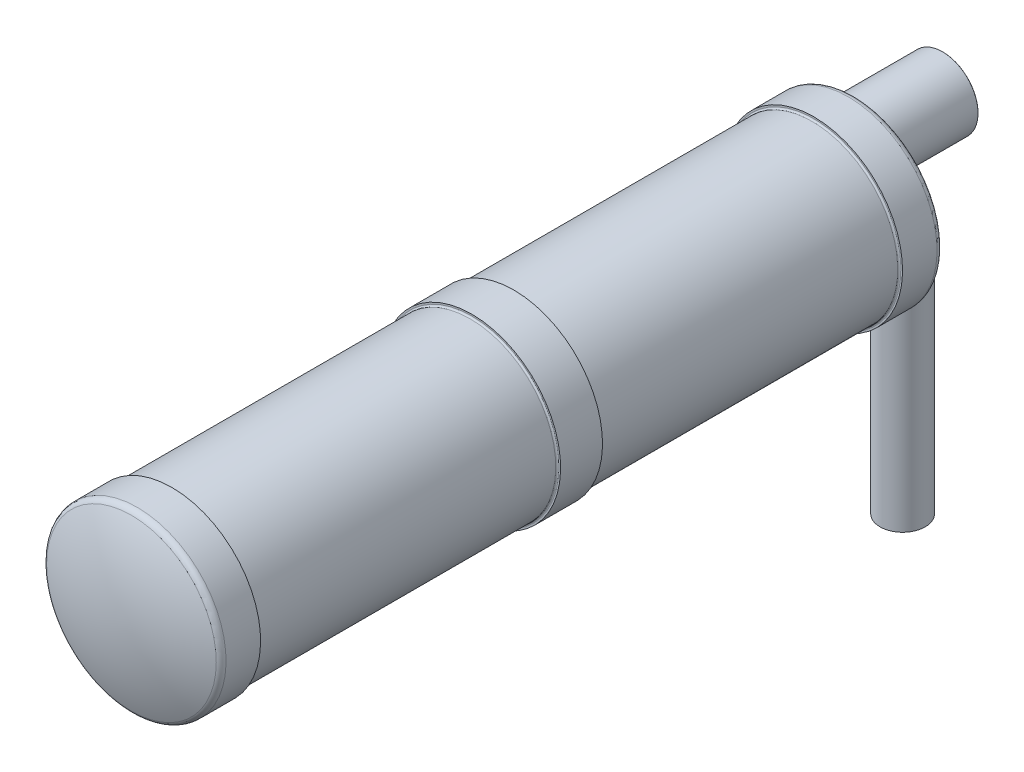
ISO-10303-21;
HEADER;
FILE_DESCRIPTION(('STEP AP214'),'2;1');
FILE_NAME('part.step','',(''),(''),'','','');
FILE_SCHEMA(('AUTOMOTIVE_DESIGN { 1 0 10303 214 1 1 1 1 }'));
ENDSEC;
DATA;
#1=APPLICATION_CONTEXT('core data for automotive mechanical design processes');
#2=APPLICATION_PROTOCOL_DEFINITION('international standard','automotive_design',2000,#1);
#3=PRODUCT_CONTEXT('',#1,'mechanical');
#4=PRODUCT('Part','Part','',(#3));
#5=PRODUCT_RELATED_PRODUCT_CATEGORY('part','',(#4));
#6=PRODUCT_DEFINITION_FORMATION('','',#4);
#7=PRODUCT_DEFINITION_CONTEXT('part definition',#1,'design');
#8=PRODUCT_DEFINITION('design','',#6,#7);
#9=PRODUCT_DEFINITION_SHAPE('','',#8);
#10=(LENGTH_UNIT() NAMED_UNIT(*) SI_UNIT(.MILLI.,.METRE.));
#11=(NAMED_UNIT(*) PLANE_ANGLE_UNIT() SI_UNIT($,.RADIAN.));
#12=(NAMED_UNIT(*) SI_UNIT($,.STERADIAN.) SOLID_ANGLE_UNIT());
#13=UNCERTAINTY_MEASURE_WITH_UNIT(LENGTH_MEASURE(1.E-05),#10,'distance_accuracy_value','');
#14=(GEOMETRIC_REPRESENTATION_CONTEXT(3) GLOBAL_UNCERTAINTY_ASSIGNED_CONTEXT((#13)) GLOBAL_UNIT_ASSIGNED_CONTEXT((#10,
#11,#12)) REPRESENTATION_CONTEXT('',''));
#15=CARTESIAN_POINT('',(0.,0.,0.));
#16=DIRECTION('',(0.,0.,1.));
#17=DIRECTION('',(1.,0.,0.));
#18=AXIS2_PLACEMENT_3D('',#15,#16,#17);
#19=CARTESIAN_POINT('',(0.,0.,66.0208333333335));
#20=DIRECTION('',(0.,0.,-1.));
#21=DIRECTION('',(0.,-1.,0.));
#22=AXIS2_PLACEMENT_3D('',#19,#20,#21);
#23=SPHERICAL_SURFACE('',#22,65.0208333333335);
#24=CARTESIAN_POINT('',(-5.12098436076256,-21.7723697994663,4.96800254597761));
#25=CARTESIAN_POINT('',(-5.25886897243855,-21.6244133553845,4.92680445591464));
#26=CARTESIAN_POINT('',(-5.39011574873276,-21.4707160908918,4.88404934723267));
#27=CARTESIAN_POINT('',(-5.63854972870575,-21.1530033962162,4.79576810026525));
#28=CARTESIAN_POINT('',(-5.75573187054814,-20.9889842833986,4.75024097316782));
#29=CARTESIAN_POINT('',(-5.97539701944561,-20.6517365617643,4.65674033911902));
#30=CARTESIAN_POINT('',(-6.07786127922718,-20.4784965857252,4.60876381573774));
#31=CARTESIAN_POINT('',(-6.26734097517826,-20.1242287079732,4.5107740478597));
#32=CARTESIAN_POINT('',(-6.35435048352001,-19.9431978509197,4.46076003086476));
#33=CARTESIAN_POINT('',(-6.51220437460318,-19.5751140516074,4.35919645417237));
#34=CARTESIAN_POINT('',(-6.58308199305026,-19.3880744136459,4.30765030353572));
#35=CARTESIAN_POINT('',(-6.70852693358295,-19.0088713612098,4.20328028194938));
#36=CARTESIAN_POINT('',(-6.76308827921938,-18.8167060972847,4.15045595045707));
#37=CARTESIAN_POINT('',(-6.85553103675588,-18.4287843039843,4.04395914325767));
#38=CARTESIAN_POINT('',(-6.8934237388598,-18.2330302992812,3.99028726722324));
#39=CARTESIAN_POINT('',(-6.95238433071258,-17.8390698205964,3.88241282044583));
#40=CARTESIAN_POINT('',(-6.9734458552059,-17.6408624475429,3.82821005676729));
#41=CARTESIAN_POINT('',(-6.99883340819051,-17.2397202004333,3.71865571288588));
#42=CARTESIAN_POINT('',(-7.00284154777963,-17.0367658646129,3.66330148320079));
#43=CARTESIAN_POINT('',(-6.99321853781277,-16.6311165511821,3.55281064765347));
#44=CARTESIAN_POINT('',(-6.97957926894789,-16.4284217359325,3.49767415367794));
#45=CARTESIAN_POINT('',(-6.93470986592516,-16.0247887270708,3.38802278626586));
#46=CARTESIAN_POINT('',(-6.90347745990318,-15.8238507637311,3.33350799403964));
#47=CARTESIAN_POINT('',(-6.82360310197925,-15.4252840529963,3.22551484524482));
#48=CARTESIAN_POINT('',(-6.77496921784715,-15.2276538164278,3.17203602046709));
#49=CARTESIAN_POINT('',(-6.66035386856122,-14.8363464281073,3.06627992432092));
#50=CARTESIAN_POINT('',(-6.59431172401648,-14.6426857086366,3.0140075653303));
#51=CARTESIAN_POINT('',(-6.44536859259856,-14.2615575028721,2.9112583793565));
#52=CARTESIAN_POINT('',(-6.36247428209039,-14.0740875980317,2.86078085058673));
#53=CARTESIAN_POINT('',(-6.18027143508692,-13.7066254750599,2.76195297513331));
#54=CARTESIAN_POINT('',(-6.08095716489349,-13.5266358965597,2.71360337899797));
#55=CARTESIAN_POINT('',(-5.8665923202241,-13.1756890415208,2.61943306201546));
#56=CARTESIAN_POINT('',(-5.75154830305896,-13.0047280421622,2.5736112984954));
#57=CARTESIAN_POINT('',(-5.50876647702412,-12.6762980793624,2.48567354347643));
#58=CARTESIAN_POINT('',(-5.38131162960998,-12.5186343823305,2.44350365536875));
#59=CARTESIAN_POINT('',(-5.11281590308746,-12.2145815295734,2.36225460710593));
#60=CARTESIAN_POINT('',(-4.97178040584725,-12.0681879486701,2.32317423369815));
#61=CARTESIAN_POINT('',(-4.6770208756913,-11.7878170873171,2.24839112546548));
#62=CARTESIAN_POINT('',(-4.52329614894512,-11.653840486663,2.21268857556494));
#63=CARTESIAN_POINT('',(-4.20424035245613,-11.3994656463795,2.1449530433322));
#64=CARTESIAN_POINT('',(-4.0389095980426,-11.2790670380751,2.1129199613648));
#65=CARTESIAN_POINT('',(-3.70344054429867,-11.056625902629,2.0537767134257));
#66=CARTESIAN_POINT('',(-3.53363787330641,-10.954110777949,2.02653952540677));
#67=CARTESIAN_POINT('',(-3.1854933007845,-10.7636550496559,1.97596519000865));
#68=CARTESIAN_POINT('',(-3.00715165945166,-10.6757140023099,1.95262792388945));
#69=CARTESIAN_POINT('',(-2.64324582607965,-10.5151873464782,1.9100475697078));
#70=CARTESIAN_POINT('',(-2.45768270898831,-10.4425994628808,1.8908038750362));
#71=CARTESIAN_POINT('',(-2.08069019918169,-10.3134143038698,1.85656777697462));
#72=CARTESIAN_POINT('',(-1.88926092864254,-10.2568166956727,1.84157528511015));
#73=CARTESIAN_POINT('',(-1.50805756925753,-10.1616419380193,1.81637012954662));
#74=CARTESIAN_POINT('',(-1.31841922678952,-10.1225561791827,1.80602254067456));
#75=CARTESIAN_POINT('',(-0.936380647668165,-10.0602126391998,1.78952005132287));
#76=CARTESIAN_POINT('',(-0.743980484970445,-10.0369544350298,1.78336503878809));
#77=CARTESIAN_POINT('',(-0.35784504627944,-10.0064707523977,1.7752982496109));
#78=CARTESIAN_POINT('',(-0.16410990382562,-9.99924369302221,1.77338605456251));
#79=CARTESIAN_POINT('',(0.22328745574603,-10.000881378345,1.77381939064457));
#80=CARTESIAN_POINT('',(0.41694967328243,-10.0097460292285,1.77616489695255));
#81=CARTESIAN_POINT('',(0.799581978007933,-10.0432090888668,1.78502028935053));
#82=CARTESIAN_POINT('',(0.988576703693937,-10.0675449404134,1.79146068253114));
#83=CARTESIAN_POINT('',(1.36384235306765,-10.1315085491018,1.8083925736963));
#84=CARTESIAN_POINT('',(1.55011232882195,-10.1711415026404,1.81888544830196));
#85=CARTESIAN_POINT('',(1.91848705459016,-10.2653479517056,1.84383517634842));
#86=CARTESIAN_POINT('',(2.1005933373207,-10.3199158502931,1.85829054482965));
#87=CARTESIAN_POINT('',(2.45952485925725,-10.4435694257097,1.89106118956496));
#88=CARTESIAN_POINT('',(2.63634810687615,-10.5126605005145,1.9093779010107));
#89=CARTESIAN_POINT('',(2.98420997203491,-10.6651194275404,1.9498171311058));
#90=CARTESIAN_POINT('',(3.1552198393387,-10.7485485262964,1.97195597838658));
#91=CARTESIAN_POINT('',(3.48956090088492,-10.9288345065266,2.01982578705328));
#92=CARTESIAN_POINT('',(3.65288926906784,-11.0256962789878,2.04555805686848));
#93=CARTESIAN_POINT('',(3.97069874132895,-11.2320336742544,2.10041113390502));
#94=CARTESIAN_POINT('',(4.12518248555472,-11.3415055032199,2.12953092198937));
#95=CARTESIAN_POINT('',(4.42444571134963,-11.5722932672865,2.19096775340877));
#96=CARTESIAN_POINT('',(4.56922153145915,-11.6936136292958,2.2232859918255));
#97=CARTESIAN_POINT('',(4.85134333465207,-11.9500850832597,2.29166364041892));
#98=CARTESIAN_POINT('',(4.98844170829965,-12.0854901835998,2.32779202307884));
#99=CARTESIAN_POINT('',(5.25071324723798,-12.3667506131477,2.40290616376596));
#100=CARTESIAN_POINT('',(5.37588199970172,-12.5126097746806,2.44189296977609));
#101=CARTESIAN_POINT('',(5.61347551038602,-12.8136354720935,2.52243349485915));
#102=CARTESIAN_POINT('',(5.72590336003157,-12.9687997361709,2.56398658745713));
#103=CARTESIAN_POINT('',(5.93745366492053,-13.2874219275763,2.64940248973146));
#104=CARTESIAN_POINT('',(6.03657112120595,-13.4508829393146,2.69326615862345));
#105=CARTESIAN_POINT('',(6.22391029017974,-13.790372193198,2.78446519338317));
#106=CARTESIAN_POINT('',(6.31167391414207,-13.9666361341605,2.83186703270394));
#107=CARTESIAN_POINT('',(6.47191894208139,-14.3254961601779,2.92848639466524));
#108=CARTESIAN_POINT('',(6.54439496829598,-14.5080944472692,2.97770454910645));
#109=CARTESIAN_POINT('',(6.73821666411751,-15.0635646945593,3.12761042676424));
#110=CARTESIAN_POINT('',(6.83612079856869,-15.4444120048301,3.23063010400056));
#111=CARTESIAN_POINT('',(6.93518304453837,-16.0283955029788,3.38900235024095));
#112=CARTESIAN_POINT('',(6.96023299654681,-16.2281877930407,3.44325457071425));
#113=CARTESIAN_POINT('',(6.99305042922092,-16.629060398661,3.55225184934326));
#114=CARTESIAN_POINT('',(7.00082338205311,-16.8301402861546,3.60699674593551));
#115=CARTESIAN_POINT('',(6.99903753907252,-17.2322634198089,3.71662143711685));
#116=CARTESIAN_POINT('',(6.98947095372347,-17.4333066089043,3.77150128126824));
#117=CARTESIAN_POINT('',(6.95306730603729,-17.8338267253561,3.88097774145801));
#118=CARTESIAN_POINT('',(6.92623651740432,-18.0333041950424,3.93557445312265));
#119=CARTESIAN_POINT('',(6.85496229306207,-18.432170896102,4.04488649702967));
#120=CARTESIAN_POINT('',(6.8102760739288,-18.6315192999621,4.09959266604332));
#121=CARTESIAN_POINT('',(6.70358424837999,-19.0257445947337,4.20791895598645));
#122=CARTESIAN_POINT('',(6.6415851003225,-19.2206231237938,4.26153947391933));
#123=CARTESIAN_POINT('',(6.5005942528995,-19.6046356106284,4.36733419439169));
#124=CARTESIAN_POINT('',(6.4215957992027,-19.793767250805,4.41950781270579));
#125=CARTESIAN_POINT('',(6.24712595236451,-20.1647131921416,4.52196226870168));
#126=CARTESIAN_POINT('',(6.15166119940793,-20.3465304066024,4.57224385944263));
#127=CARTESIAN_POINT('',(5.9457545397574,-20.699925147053,4.67009018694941));
#128=CARTESIAN_POINT('',(5.83545554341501,-20.871580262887,4.71767534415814));
#129=CARTESIAN_POINT('',(5.59996377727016,-21.20500224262,4.81020655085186));
#130=CARTESIAN_POINT('',(5.47477713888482,-21.366773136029,4.85515367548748));
#131=CARTESIAN_POINT('',(5.21023907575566,-21.6792441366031,4.9420616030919));
#132=CARTESIAN_POINT('',(5.07088339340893,-21.8299408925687,4.98402150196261));
#133=CARTESIAN_POINT('',(4.779031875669,-22.118886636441,5.06455192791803));
#134=CARTESIAN_POINT('',(4.62654172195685,-22.2571409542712,5.1031239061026));
#135=CARTESIAN_POINT('',(4.31412135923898,-22.5161863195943,5.17545797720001));
#136=CARTESIAN_POINT('',(4.15454378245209,-22.6373724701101,5.20932846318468));
#137=CARTESIAN_POINT('',(3.82512439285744,-22.8658834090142,5.27324282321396));
#138=CARTESIAN_POINT('',(3.65528677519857,-22.9732138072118,5.30328824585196));
#139=CARTESIAN_POINT('',(3.30649349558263,-23.1731278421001,5.35928698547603));
#140=CARTESIAN_POINT('',(3.12753765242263,-23.2657111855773,5.38524022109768));
#141=CARTESIAN_POINT('',(2.76183034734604,-23.4352865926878,5.4328016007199));
#142=CARTESIAN_POINT('',(2.57507910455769,-23.5122790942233,5.45440986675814));
#143=CARTESIAN_POINT('',(2.20219807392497,-23.6474199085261,5.49235377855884));
#144=CARTESIAN_POINT('',(2.01629844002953,-23.7061575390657,5.50885422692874));
#145=CARTESIAN_POINT('',(1.6399318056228,-23.8079824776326,5.53746728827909));
#146=CARTESIAN_POINT('',(1.44946492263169,-23.8510701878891,5.5495800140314));
#147=CARTESIAN_POINT('',(1.06540600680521,-23.9211999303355,5.56929847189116));
#148=CARTESIAN_POINT('',(0.871814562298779,-23.9482449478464,5.57690504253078));
#149=CARTESIAN_POINT('',(0.482923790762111,-23.9860538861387,5.58753982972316));
#150=CARTESIAN_POINT('',(0.287624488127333,-23.9968180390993,5.59056811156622));
#151=CARTESIAN_POINT('',(-0.0981762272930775,-24.0019009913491,5.59199804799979));
#152=CARTESIAN_POINT('',(-0.28867186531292,-23.9966355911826,5.5905166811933));
#153=CARTESIAN_POINT('',(-0.668516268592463,-23.9706043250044,5.58319411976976));
#154=CARTESIAN_POINT('',(-0.857865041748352,-23.9498385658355,5.5773529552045));
#155=CARTESIAN_POINT('',(-1.23410416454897,-23.8929814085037,5.5613637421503));
#156=CARTESIAN_POINT('',(-1.42099396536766,-23.8568866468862,5.55121474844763));
#157=CARTESIAN_POINT('',(-1.79095128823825,-23.7696832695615,5.52670398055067));
#158=CARTESIAN_POINT('',(-1.9740188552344,-23.7185748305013,5.51234225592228));
#159=CARTESIAN_POINT('',(-2.33476294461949,-23.6018755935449,5.47956422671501));
#160=CARTESIAN_POINT('',(-2.51244794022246,-23.5363090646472,5.46115471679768));
#161=CARTESIAN_POINT('',(-2.86154438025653,-23.3911890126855,5.42043106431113));
#162=CARTESIAN_POINT('',(-3.03295582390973,-23.3116354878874,5.39811692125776));
#163=CARTESIAN_POINT('',(-3.36820335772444,-23.1392745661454,5.34980223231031));
#164=CARTESIAN_POINT('',(-3.53204726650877,-23.0464812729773,5.3238056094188));
#165=CARTESIAN_POINT('',(-3.8512640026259,-22.8483375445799,5.26833495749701));
#166=CARTESIAN_POINT('',(-4.00663906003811,-22.7429904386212,5.23886185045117));
#167=CARTESIAN_POINT('',(-4.33129571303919,-22.5033279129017,5.1718653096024));
#168=CARTESIAN_POINT('',(-4.49902253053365,-22.3670509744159,5.13380146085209));
#169=CARTESIAN_POINT('',(-4.82065582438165,-22.0801302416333,5.05374444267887));
#170=CARTESIAN_POINT('',(-4.97456271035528,-21.9294868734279,5.0117513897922));
#171=CARTESIAN_POINT('',(-5.12098436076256,-21.7723697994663,4.96800254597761));
#172=B_SPLINE_CURVE_WITH_KNOTS('',3,(#24,#25,#26,#27,#28,#29,#30,#31,#32,#33,#34,#35,#36,#37,
#38,#39,#40,#41,#42,#43,#44,#45,#46,#47,#48,#49,#50,#51,#52,#53,#54,#55,#56,#57,#58,#59,#60,#61,
#62,#63,#64,#65,#66,#67,#68,#69,#70,#71,#72,#73,#74,#75,#76,#77,#78,#79,#80,#81,#82,#83,#84,#85,
#86,#87,#88,#89,#90,#91,#92,#93,#94,#95,#96,#97,#98,#99,#100,#101,#102,#103,#104,#105,#106,#107,
#108,#109,#110,#111,#112,#113,#114,#115,#116,#117,#118,#119,#120,#121,#122,#123,#124,#125,#126,
#127,#128,#129,#130,#131,#132,#133,#134,#135,#136,#137,#138,#139,#140,#141,#142,#143,#144,#145,
#146,#147,#148,#149,#150,#151,#152,#153,#154,#155,#156,#157,#158,#159,#160,#161,#162,#163,#164,
#165,#166,#167,#168,#169,#170,#171),.UNSPECIFIED.,.T.,.F.,(4,2,2,2,2,2,2,2,2,2,2,2,2,2,2,2,2,2,
2,2,2,2,2,2,2,2,2,2,2,2,2,2,2,2,2,2,2,2,2,2,2,2,2,2,2,2,2,2,2,2,2,2,2,2,2,2,2,2,2,2,2,2,2,2,2,2,
2,2,2,2,2,2,2,4),(0.,0.618994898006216,1.23821190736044,1.85821079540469,2.47844697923,
3.09739351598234,3.7165664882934,4.33531942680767,4.95430625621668,5.58478229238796,
6.21554850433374,6.84639618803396,7.47695177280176,8.10973501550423,8.74226805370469,
9.37502243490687,10.0075138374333,10.627978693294,11.2481986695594,11.8684525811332,
12.4886896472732,13.0885801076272,13.6884522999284,14.2882355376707,14.8880062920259,
15.4690035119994,16.0499852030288,16.6309095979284,17.2118306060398,17.7831469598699,
18.3546575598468,18.9259542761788,19.4974637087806,20.0714780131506,20.6457018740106,
21.2197534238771,21.7940202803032,22.3815008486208,22.9691978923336,23.5567520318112,
24.1445262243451,24.7513788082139,25.3584445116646,26.5715330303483,27.1965966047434,
27.8214621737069,28.4466085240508,29.071527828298,29.7052503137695,30.3387367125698,
30.9724752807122,31.6059588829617,32.233726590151,32.8612366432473,33.4889358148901,
34.116364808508,34.7252676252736,35.3339231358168,35.9425907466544,36.5512412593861,
37.1374879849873,37.7237196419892,38.3098421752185,38.895956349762,39.4669976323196,
40.0380349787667,40.6091976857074,41.1803536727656,41.7505581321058,42.3207626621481,
42.8903642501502,43.459815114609,44.1171541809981,44.7744737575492),.UNSPECIFIED.);
#173=CARTESIAN_POINT('',(-5.12098436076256,-21.7723697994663,4.96800254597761));
#174=VERTEX_POINT('',#173);
#175=EDGE_CURVE('E131',#174,#174,#172,.T.);
#176=ORIENTED_EDGE('',*,*,#175,.T.);
#177=EDGE_LOOP('',(#176));
#178=FACE_BOUND('',#177,.T.);
#179=CARTESIAN_POINT('',(0.,0.,6.38035699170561));
#180=DIRECTION('',(0.,0.,-1.));
#181=DIRECTION('',(0.,1.,0.));
#182=AXIS2_PLACEMENT_3D('',#179,#180,#181);
#183=CIRCLE('',#182,25.8983078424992);
#184=CARTESIAN_POINT('',(0.,25.8983078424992,6.38035699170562));
#185=VERTEX_POINT('',#184);
#186=EDGE_CURVE('E317',#185,#185,#183,.T.);
#187=ORIENTED_EDGE('',*,*,#186,.F.);
#188=EDGE_LOOP('',(#187));
#189=FACE_BOUND('',#188,.T.);
#190=CARTESIAN_POINT('',(-7.9869707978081,6.43638330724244,1.81421346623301));
#191=CARTESIAN_POINT('',(-7.77773854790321,6.21543479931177,1.76603649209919));
#192=CARTESIAN_POINT('',(-7.55915739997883,6.00299333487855,1.71976873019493));
#193=CARTESIAN_POINT('',(-7.10457787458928,5.59655338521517,1.63133708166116));
#194=CARTESIAN_POINT('',(-6.86857592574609,5.40255870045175,1.58917404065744));
#195=CARTESIAN_POINT('',(-6.3805602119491,5.0344007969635,1.50922860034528));
#196=CARTESIAN_POINT('',(-6.12853275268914,4.8602549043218,1.47145002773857));
#197=CARTESIAN_POINT('',(-5.61035415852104,4.53333399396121,1.40058363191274));
#198=CARTESIAN_POINT('',(-5.3442033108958,4.38055854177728,1.36749571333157));
#199=CARTESIAN_POINT('',(-4.79950764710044,4.09752741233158,1.30623730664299));
#200=CARTESIAN_POINT('',(-4.52095804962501,3.96728051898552,1.27806873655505));
#201=CARTESIAN_POINT('',(-3.95352029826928,3.73042363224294,1.22687094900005));
#202=CARTESIAN_POINT('',(-3.66463199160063,3.62381398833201,1.20384180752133));
#203=CARTESIAN_POINT('',(-3.07865969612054,3.43512545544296,1.16309925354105));
#204=CARTESIAN_POINT('',(-2.78157762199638,3.35304088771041,1.14538461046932));
#205=CARTESIAN_POINT('',(-2.1813133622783,3.2140471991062,1.11539695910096));
#206=CARTESIAN_POINT('',(-1.87813126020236,3.1571377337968,1.10312387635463));
#207=CARTESIAN_POINT('',(-1.27179393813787,3.06953025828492,1.0842334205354));
#208=CARTESIAN_POINT('',(-0.968687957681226,3.03850635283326,1.07754572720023));
#209=CARTESIAN_POINT('',(-0.36087705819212,3.00170637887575,1.0696131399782));
#210=CARTESIAN_POINT('',(-0.0561721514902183,2.99593011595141,1.06836820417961));
#211=CARTESIAN_POINT('',(0.552633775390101,3.00967228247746,1.07133028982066));
#212=CARTESIAN_POINT('',(0.856734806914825,3.02919023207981,1.075537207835));
#213=CARTESIAN_POINT('',(1.4621480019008,3.09336059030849,1.08937163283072));
#214=CARTESIAN_POINT('',(1.76346017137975,3.13801294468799,1.09899912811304));
#215=CARTESIAN_POINT('',(2.35912677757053,3.25170522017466,1.12352082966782));
#216=CARTESIAN_POINT('',(2.65351434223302,3.32057942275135,1.13837924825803));
#217=CARTESIAN_POINT('',(3.2353388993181,3.48221775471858,1.1732661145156));
#218=CARTESIAN_POINT('',(3.52277593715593,3.57498172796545,1.19329452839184));
#219=CARTESIAN_POINT('',(4.08870813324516,3.78366874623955,1.23837775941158));
#220=CARTESIAN_POINT('',(4.36720325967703,3.89959187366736,1.26343259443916));
#221=CARTESIAN_POINT('',(4.91334879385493,4.15369527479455,1.3183909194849));
#222=CARTESIAN_POINT('',(5.18099911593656,4.29187572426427,1.34829444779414));
#223=CARTESIAN_POINT('',(5.70559895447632,4.59054107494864,1.41298032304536));
#224=CARTESIAN_POINT('',(5.96245419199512,4.75118406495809,1.44779726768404));
#225=CARTESIAN_POINT('',(6.46161552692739,5.09275657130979,1.52189570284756));
#226=CARTESIAN_POINT('',(6.70392158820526,5.27368613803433,1.56117720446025));
#227=CARTESIAN_POINT('',(7.17241076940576,5.65448325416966,1.64393570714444));
#228=CARTESIAN_POINT('',(7.39859325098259,5.85435155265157,1.68741287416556));
#229=CARTESIAN_POINT('',(7.83338927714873,6.27155923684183,1.77826822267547));
#230=CARTESIAN_POINT('',(8.04200207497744,6.48889936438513,1.82564656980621));
#231=CARTESIAN_POINT('',(8.44404197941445,6.94365808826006,1.92489860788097));
#232=CARTESIAN_POINT('',(8.63711629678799,7.18137399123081,1.97683930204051));
#233=CARTESIAN_POINT('',(9.00246620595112,7.67156819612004,2.08408542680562));
#234=CARTESIAN_POINT('',(9.17474158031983,7.92404665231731,2.13939089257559));
#235=CARTESIAN_POINT('',(9.49744941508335,8.44198225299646,2.25300060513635));
#236=CARTESIAN_POINT('',(9.64788009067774,8.70744045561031,2.31130509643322));
#237=CARTESIAN_POINT('',(9.92598423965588,9.24946066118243,2.43052415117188));
#238=CARTESIAN_POINT('',(10.0536572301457,9.52602289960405,2.4914387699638));
#239=CARTESIAN_POINT('',(10.2881096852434,10.0946832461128,2.6168771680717));
#240=CARTESIAN_POINT('',(10.3943540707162,10.3869909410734,2.68145132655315));
#241=CARTESIAN_POINT('',(10.5816344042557,10.9791634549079,2.81247563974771));
#242=CARTESIAN_POINT('',(10.662669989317,11.2790283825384,2.87892582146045));
#243=CARTESIAN_POINT('',(10.7990667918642,11.8842522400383,3.01326064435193));
#244=CARTESIAN_POINT('',(10.8544258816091,12.1896116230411,3.08114540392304));
#245=CARTESIAN_POINT('',(10.939147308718,12.8037012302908,3.21788907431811));
#246=CARTESIAN_POINT('',(10.9685092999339,13.1124314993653,3.28674799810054));
#247=CARTESIAN_POINT('',(11.0013625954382,13.73658703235,3.42619078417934));
#248=CARTESIAN_POINT('',(11.0043909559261,14.0520347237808,3.49678371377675));
#249=CARTESIAN_POINT('',(10.9833593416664,14.6820203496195,3.63800569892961));
#250=CARTESIAN_POINT('',(10.9592990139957,14.9965582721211,3.70863475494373));
#251=CARTESIAN_POINT('',(10.8842440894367,15.6225302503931,3.84943414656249));
#252=CARTESIAN_POINT('',(10.833247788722,15.933964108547,3.91960445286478));
#253=CARTESIAN_POINT('',(10.7046400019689,16.551500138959,4.05897716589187));
#254=CARTESIAN_POINT('',(10.6270291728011,16.8576024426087,4.12817959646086));
#255=CARTESIAN_POINT('',(10.4452418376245,17.463742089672,4.26543906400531));
#256=CARTESIAN_POINT('',(10.3409409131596,17.7637437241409,4.33348910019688));
#257=CARTESIAN_POINT('',(10.1066107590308,18.3539918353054,4.46759221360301));
#258=CARTESIAN_POINT('',(9.97658136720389,18.6442382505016,4.53364527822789));
#259=CARTESIAN_POINT('',(9.69162506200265,19.2128229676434,4.66324273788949));
#260=CARTESIAN_POINT('',(9.53669857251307,19.4911614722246,4.7267871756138));
#261=CARTESIAN_POINT('',(9.20295124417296,20.0338341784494,4.85086309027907));
#262=CARTESIAN_POINT('',(9.02413069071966,20.2981685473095,4.91139460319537));
#263=CARTESIAN_POINT('',(8.64593105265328,20.8078961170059,5.02828416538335));
#264=CARTESIAN_POINT('',(8.44680727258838,21.0534696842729,5.08468166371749));
#265=CARTESIAN_POINT('',(8.02768006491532,21.5270401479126,5.19358114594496));
#266=CARTESIAN_POINT('',(7.80767672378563,21.7550371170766,5.24608314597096));
#267=CARTESIAN_POINT('',(7.34830938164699,22.1916266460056,5.34673873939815));
#268=CARTESIAN_POINT('',(7.10894714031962,22.4002209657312,5.39489272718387));
#269=CARTESIAN_POINT('',(6.61252061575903,22.7963287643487,5.48643271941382));
#270=CARTESIAN_POINT('',(6.3554566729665,22.9838426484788,5.52981881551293));
#271=CARTESIAN_POINT('',(5.83163640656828,23.3321289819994,5.61048036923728));
#272=CARTESIAN_POINT('',(5.56524407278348,23.4934215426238,5.64787438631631));
#273=CARTESIAN_POINT('',(5.01920818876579,23.793085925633,5.71740415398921));
#274=CARTESIAN_POINT('',(4.73956482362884,23.9314580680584,5.74953997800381));
#275=CARTESIAN_POINT('',(4.16907492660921,24.1841114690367,5.80825567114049));
#276=CARTESIAN_POINT('',(3.87822973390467,24.298395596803,5.83483620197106));
#277=CARTESIAN_POINT('',(3.28744575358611,24.501919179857,5.882196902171));
#278=CARTESIAN_POINT('',(2.9875071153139,24.5911590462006,5.90297716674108));
#279=CARTESIAN_POINT('',(2.38818074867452,24.7419616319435,5.93810584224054));
#280=CARTESIAN_POINT('',(2.08895771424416,24.8041458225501,5.95259865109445));
#281=CARTESIAN_POINT('',(1.48615644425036,24.9034233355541,5.97574154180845));
#282=CARTESIAN_POINT('',(1.18257828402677,24.9405170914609,5.98439172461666));
#283=CARTESIAN_POINT('',(0.573302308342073,24.989300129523,5.99576860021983));
#284=CARTESIAN_POINT('',(0.267604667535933,25.0009914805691,5.99849577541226));
#285=CARTESIAN_POINT('',(-0.343697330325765,24.9988769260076,5.99800256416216));
#286=CARTESIAN_POINT('',(-0.649301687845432,24.9850711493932,5.99478220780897));
#287=CARTESIAN_POINT('',(-1.2540851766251,24.9324363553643,5.98250735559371));
#288=CARTESIAN_POINT('',(-1.55329546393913,24.8939460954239,5.97353184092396));
#289=CARTESIAN_POINT('',(-2.14732488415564,24.7925798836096,5.9499030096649));
#290=CARTESIAN_POINT('',(-2.44214406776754,24.7297042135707,5.93524975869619));
#291=CARTESIAN_POINT('',(-3.02531917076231,24.5800786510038,5.90039697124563));
#292=CARTESIAN_POINT('',(-3.31367516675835,24.4933290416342,5.88019750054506));
#293=CARTESIAN_POINT('',(-3.88193107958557,24.2966505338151,5.83443058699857));
#294=CARTESIAN_POINT('',(-4.16183093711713,24.1867214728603,5.80886310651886));
#295=CARTESIAN_POINT('',(-4.71234569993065,23.9440755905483,5.75247141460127));
#296=CARTESIAN_POINT('',(-4.98291981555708,23.8112709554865,5.72162694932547));
#297=CARTESIAN_POINT('',(-5.51180006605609,23.5242107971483,5.65501540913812));
#298=CARTESIAN_POINT('',(-5.77010620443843,23.3699552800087,5.6192483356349));
#299=CARTESIAN_POINT('',(-6.27276267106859,23.0411638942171,5.54308843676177));
#300=CARTESIAN_POINT('',(-6.51711242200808,22.8666271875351,5.50269542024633));
#301=CARTESIAN_POINT('',(-6.99028534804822,22.4985738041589,5.41761138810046));
#302=CARTESIAN_POINT('',(-7.21910783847,22.3050562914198,5.37292018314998));
#303=CARTESIAN_POINT('',(-7.6639674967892,21.8966133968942,5.27870748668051));
#304=CARTESIAN_POINT('',(-7.87967975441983,21.6813515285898,5.22911044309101));
#305=CARTESIAN_POINT('',(-8.29211982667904,21.23417388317,5.12621497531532));
#306=CARTESIAN_POINT('',(-8.48884744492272,21.0022579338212,5.07291651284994));
#307=CARTESIAN_POINT('',(-8.86212052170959,20.5234180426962,4.9630239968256));
#308=CARTESIAN_POINT('',(-9.03866416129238,20.2764927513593,4.9064296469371));
#309=CARTESIAN_POINT('',(-9.37048770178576,19.7693832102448,4.79037192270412));
#310=CARTESIAN_POINT('',(-9.52576709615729,19.5091986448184,4.73090848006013));
#311=CARTESIAN_POINT('',(-9.81775118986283,18.9707039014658,4.6080258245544));
#312=CARTESIAN_POINT('',(-9.95389423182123,18.6921031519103,4.54454487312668));
#313=CARTESIAN_POINT('',(-10.2020446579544,18.1248196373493,4.41549280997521));
#314=CARTESIAN_POINT('',(-10.3140516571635,17.8361367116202,4.34992166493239));
#315=CARTESIAN_POINT('',(-10.5132631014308,17.2506792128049,4.21715904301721));
#316=CARTESIAN_POINT('',(-10.6004660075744,16.9539041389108,4.14996746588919));
#317=CARTESIAN_POINT('',(-10.7495402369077,16.3543190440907,4.01444313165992));
#318=CARTESIAN_POINT('',(-10.8114116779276,16.0515090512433,3.94611037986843));
#319=CARTESIAN_POINT('',(-10.9104237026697,15.4358832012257,3.80741885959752));
#320=CARTESIAN_POINT('',(-10.9470518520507,15.1229878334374,3.73704672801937));
#321=CARTESIAN_POINT('',(-10.993351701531,14.495249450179,3.59610466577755));
#322=CARTESIAN_POINT('',(-11.0030229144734,14.180406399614,3.52553473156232));
#323=CARTESIAN_POINT('',(-10.9953360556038,13.5508881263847,3.3846707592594));
#324=CARTESIAN_POINT('',(-10.9779698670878,13.2362129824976,3.31437681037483));
#325=CARTESIAN_POINT('',(-10.9162845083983,12.6093438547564,3.17457627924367));
#326=CARTESIAN_POINT('',(-10.8719657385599,12.2971498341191,3.10506968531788));
#327=CARTESIAN_POINT('',(-10.7562390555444,11.6753494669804,2.96685811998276));
#328=CARTESIAN_POINT('',(-10.6846500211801,11.3657748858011,2.89816174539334));
#329=CARTESIAN_POINT('',(-10.5148429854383,10.7536217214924,2.76253776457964));
#330=CARTESIAN_POINT('',(-10.4166251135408,10.4510431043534,2.69561014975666));
#331=CARTESIAN_POINT('',(-10.1942788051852,9.85541156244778,2.56406407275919));
#332=CARTESIAN_POINT('',(-10.0701778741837,9.56234890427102,2.49944324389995));
#333=CARTESIAN_POINT('',(-9.79684132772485,8.98770146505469,2.37291797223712));
#334=CARTESIAN_POINT('',(-9.64761228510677,8.70611370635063,2.31101282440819));
#335=CARTESIAN_POINT('',(-9.27580849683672,8.07276754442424,2.17196909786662));
#336=CARTESIAN_POINT('',(-9.04473090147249,7.72571843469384,2.09592456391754));
#337=CARTESIAN_POINT('',(-8.54396827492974,7.05922722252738,1.95012455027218));
#338=CARTESIAN_POINT('',(-8.27428375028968,6.73978475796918,1.88036898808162));
#339=CARTESIAN_POINT('',(-7.9869707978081,6.43638330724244,1.81421346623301));
#340=B_SPLINE_CURVE_WITH_KNOTS('',3,(#190,#191,#192,#193,#194,#195,#196,#197,#198,#199,#200,
#201,#202,#203,#204,#205,#206,#207,#208,#209,#210,#211,#212,#213,#214,#215,#216,#217,#218,#219,
#220,#221,#222,#223,#224,#225,#226,#227,#228,#229,#230,#231,#232,#233,#234,#235,#236,#237,#238,
#239,#240,#241,#242,#243,#244,#245,#246,#247,#248,#249,#250,#251,#252,#253,#254,#255,#256,#257,
#258,#259,#260,#261,#262,#263,#264,#265,#266,#267,#268,#269,#270,#271,#272,#273,#274,#275,#276,
#277,#278,#279,#280,#281,#282,#283,#284,#285,#286,#287,#288,#289,#290,#291,#292,#293,#294,#295,
#296,#297,#298,#299,#300,#301,#302,#303,#304,#305,#306,#307,#308,#309,#310,#311,#312,#313,#314,
#315,#316,#317,#318,#319,#320,#321,#322,#323,#324,#325,#326,#327,#328,#329,#330,#331,#332,#333,
#334,#335,#336,#337,#338,#339),.UNSPECIFIED.,.T.,.F.,(4,2,2,2,2,2,2,2,2,2,2,2,2,2,2,2,2,2,2,2,2,
2,2,2,2,2,2,2,2,2,2,2,2,2,2,2,2,2,2,2,2,2,2,2,2,2,2,2,2,2,2,2,2,2,2,2,2,2,2,2,2,2,2,2,2,2,2,2,2,
2,2,2,2,2,4),(0.,0.923905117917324,1.84800017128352,2.77289579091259,3.69777260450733,
4.62300921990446,5.54825951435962,6.47329540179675,7.39831863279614,8.31151230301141,
9.22469894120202,10.1378682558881,11.0510355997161,11.9580731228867,12.8651047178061,
13.7721395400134,14.6791815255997,15.5929626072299,16.5067459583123,17.4205654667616,
18.3344237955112,19.2652067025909,20.1959993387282,21.1268679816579,22.0577563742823,
23.009601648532,23.9614606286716,24.9133984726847,25.8653489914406,26.8340016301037,
27.802666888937,28.7713934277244,29.7400960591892,30.7133993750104,31.6867088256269,
32.6600017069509,33.633282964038,34.5955598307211,35.5578327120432,36.5200182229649,
37.4821852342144,38.4219959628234,39.3617935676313,40.3014791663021,41.2411493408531,
42.1579206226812,43.0746760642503,43.9913568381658,44.9080329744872,45.8123907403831,
46.71673805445,47.6210746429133,48.525417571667,49.4333127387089,50.341207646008,
51.2491400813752,52.1571125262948,53.0823104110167,54.0075178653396,54.9328086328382,
55.8581214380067,56.8065755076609,57.7550447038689,58.7035727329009,59.6520963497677,
60.619348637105,61.5866184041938,62.5541786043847,63.5217244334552,64.495811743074,
65.4698943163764,66.4429469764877,67.4157455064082,68.6844475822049,69.9531330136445),.UNSPECIFIED.);
#341=CARTESIAN_POINT('',(-7.9869707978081,6.43638330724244,1.81421346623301));
#342=VERTEX_POINT('',#341);
#343=EDGE_CURVE('E124',#342,#342,#340,.T.);
#344=ORIENTED_EDGE('',*,*,#343,.F.);
#345=EDGE_LOOP('',(#344));
#346=FACE_BOUND('',#345,.T.);
#347=ADVANCED_FACE('F39',(#178,#189,#346),#23,.F.);
#348=CARTESIAN_POINT('',(0.,0.,66.0208333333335));
#349=DIRECTION('',(0.,0.,-1.));
#350=DIRECTION('',(0.,-1.,0.));
#351=AXIS2_PLACEMENT_3D('',#348,#349,#350);
#352=SPHERICAL_SURFACE('',#351,66.0208333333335);
#353=CARTESIAN_POINT('',(-5.69647676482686,-21.6636430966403,3.91618653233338));
#354=CARTESIAN_POINT('',(-5.40625895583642,-21.4472717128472,3.81409092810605));
#355=CARTESIAN_POINT('',(-5.35697705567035,-21.5058624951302,3.44584525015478));
#356=CARTESIAN_POINT('',(-5.42017654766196,-21.9921346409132,4.00542901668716));
#357=CARTESIAN_POINT('',(-5.1481187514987,-21.7609985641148,3.89984905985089));
#358=CARTESIAN_POINT('',(-5.09714383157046,-21.8147765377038,3.53576360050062));
#359=CARTESIAN_POINT('',(-5.1145751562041,-22.2976493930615,4.08862298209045));
#360=CARTESIAN_POINT('',(-4.86031439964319,-22.0549081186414,3.98036835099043));
#361=CARTESIAN_POINT('',(-4.80975573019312,-22.1020831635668,3.61958762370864));
#362=CARTESIAN_POINT('',(-4.45290784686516,-22.8526489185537,4.24000650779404));
#363=CARTESIAN_POINT('',(-4.23540005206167,-22.5885758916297,4.12680949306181));
#364=CARTESIAN_POINT('',(-4.18752259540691,-22.624005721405,3.77211763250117));
#365=CARTESIAN_POINT('',(-4.09685197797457,-23.1021448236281,4.30819904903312));
#366=CARTESIAN_POINT('',(-3.89817699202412,-22.8291455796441,4.19295206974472));
#367=CARTESIAN_POINT('',(-3.85268701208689,-22.8586321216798,3.84082662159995));
#368=CARTESIAN_POINT('',(-3.3573051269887,-23.5289585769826,4.42500200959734));
#369=CARTESIAN_POINT('',(-3.1966870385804,-23.2403354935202,4.30614244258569));
#370=CARTESIAN_POINT('',(-3.1572158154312,-23.2600085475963,3.95851417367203));
#371=CARTESIAN_POINT('',(-2.9751534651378,-23.7084366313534,4.47419792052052));
#372=CARTESIAN_POINT('',(-2.83343015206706,-23.4136619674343,4.35392902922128));
#373=CARTESIAN_POINT('',(-2.79783970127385,-23.4287900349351,4.00808266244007));
#374=CARTESIAN_POINT('',(-2.18432766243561,-24.0006048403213,4.55434402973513));
#375=CARTESIAN_POINT('',(-2.08137818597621,-23.6954552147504,4.4316778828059));
#376=CARTESIAN_POINT('',(-2.05414568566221,-23.7035455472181,4.08883574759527));
#377=CARTESIAN_POINT('',(-1.77565910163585,-24.1133089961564,4.58529805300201));
#378=CARTESIAN_POINT('',(-1.69204115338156,-23.8044156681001,4.46177608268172));
#379=CARTESIAN_POINT('',(-1.66983303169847,-23.8095327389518,4.12002419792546));
#380=CARTESIAN_POINT('',(-0.957487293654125,-24.2653522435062,4.62706851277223));
#381=CARTESIAN_POINT('',(-0.91277401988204,-23.9511760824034,4.50232710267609));
#382=CARTESIAN_POINT('',(-0.900422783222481,-23.9525144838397,4.16211100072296));
#383=CARTESIAN_POINT('',(-0.548428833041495,-24.3069226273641,4.63849738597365));
#384=CARTESIAN_POINT('',(-0.52265631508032,-23.9913831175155,4.51344445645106));
#385=CARTESIAN_POINT('',(-0.515743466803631,-23.9916073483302,4.17362642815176));
#386=CARTESIAN_POINT('',(0.271027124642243,-24.3221869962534,4.64269322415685));
#387=CARTESIAN_POINT('',(0.258232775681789,-24.0061199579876,4.5175185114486));
#388=CARTESIAN_POINT('',(0.254874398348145,-24.0059619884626,4.17785404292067));
#389=CARTESIAN_POINT('',(0.681424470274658,-24.295888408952,4.63546223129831));
#390=CARTESIAN_POINT('',(0.64966853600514,-23.9806820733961,4.51048414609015));
#391=CARTESIAN_POINT('',(0.64081280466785,-23.9812307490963,4.17056828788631));
#392=CARTESIAN_POINT('',(1.48574358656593,-24.1772228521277,4.60285498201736));
#393=CARTESIAN_POINT('',(1.41586432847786,-23.866134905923,4.47882774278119));
#394=CARTESIAN_POINT('',(1.39719595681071,-23.8696374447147,4.13771409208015));
#395=CARTESIAN_POINT('',(1.87981719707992,-24.0858083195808,4.57774030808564));
#396=CARTESIAN_POINT('',(1.79140331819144,-23.7777550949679,4.45440719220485));
#397=CARTESIAN_POINT('',(1.7677834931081,-23.7836710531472,4.11240921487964));
#398=CARTESIAN_POINT('',(2.64668487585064,-23.8410545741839,4.51056801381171));
#399=CARTESIAN_POINT('',(2.52103962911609,-23.5416338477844,4.38922899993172));
#400=CARTESIAN_POINT('',(2.48894724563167,-23.5535041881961,4.04472820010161));
#401=CARTESIAN_POINT('',(3.01947850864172,-23.6877140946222,4.46851004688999));
#402=CARTESIAN_POINT('',(2.87564868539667,-23.3935193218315,4.34836852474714));
#403=CARTESIAN_POINT('',(2.83952305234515,-23.4093025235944,4.00235171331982));
#404=CARTESIAN_POINT('',(3.73732151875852,-23.3223207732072,4.36843257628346));
#405=CARTESIAN_POINT('',(3.55715617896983,-23.0413728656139,4.25135385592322));
#406=CARTESIAN_POINT('',(3.51458391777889,-23.0656859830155,3.90151631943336));
#407=CARTESIAN_POINT('',(4.08206789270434,-23.1097147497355,4.31026271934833));
#408=CARTESIAN_POINT('',(3.8841098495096,-22.8362932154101,4.19491263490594));
#409=CARTESIAN_POINT('',(3.8387840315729,-22.8657508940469,3.84290592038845));
#410=CARTESIAN_POINT('',(4.73098959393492,-22.633073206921,4.18008220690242));
#411=CARTESIAN_POINT('',(4.49807127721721,-22.3776362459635,4.06889646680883));
#412=CARTESIAN_POINT('',(4.44903117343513,-22.4175163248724,3.71173950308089));
#413=CARTESIAN_POINT('',(5.03515984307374,-22.3690312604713,4.10806982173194));
#414=CARTESIAN_POINT('',(4.7852553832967,-22.1234279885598,3.99914938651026));
#415=CARTESIAN_POINT('',(4.73507342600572,-22.1692108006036,3.6391817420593));
#416=CARTESIAN_POINT('',(5.60364236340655,-21.7891666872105,3.95024588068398));
#417=CARTESIAN_POINT('',(5.32047172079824,-21.5664885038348,3.84663959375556));
#418=CARTESIAN_POINT('',(5.26967541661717,-21.6239051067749,3.48016254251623));
#419=CARTESIAN_POINT('',(5.86657409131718,-21.4720843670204,3.86409995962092));
#420=CARTESIAN_POINT('',(5.56706914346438,-21.2619395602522,3.76338920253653));
#421=CARTESIAN_POINT('',(5.51693688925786,-21.3257203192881,3.3933642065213));
#422=CARTESIAN_POINT('',(6.33578392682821,-20.800707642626,3.68212401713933));
#423=CARTESIAN_POINT('',(6.0053566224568,-20.6188383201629,3.58798274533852));
#424=CARTESIAN_POINT('',(5.95818266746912,-20.6943564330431,3.21001009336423));
#425=CARTESIAN_POINT('',(6.54205226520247,-20.446406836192,3.58629232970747));
#426=CARTESIAN_POINT('',(6.19678111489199,-20.2795969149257,3.49564219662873));
#427=CARTESIAN_POINT('',(6.15215778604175,-20.3611713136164,3.11345263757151));
#428=CARTESIAN_POINT('',(6.80841298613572,-19.8884612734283,3.43575260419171));
#429=CARTESIAN_POINT('',(6.44185102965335,-19.7481281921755,3.35131606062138));
#430=CARTESIAN_POINT('',(6.40264388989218,-19.8364782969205,2.9617728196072));
#431=CARTESIAN_POINT('',(6.89102356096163,-19.6945763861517,3.38350402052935));
#432=CARTESIAN_POINT('',(6.51764037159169,-19.5631145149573,3.30113231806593));
#433=CARTESIAN_POINT('',(6.48033102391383,-19.6541485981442,2.90912853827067));
#434=CARTESIAN_POINT('',(7.03942457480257,-19.300857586,3.27754021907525));
#435=CARTESIAN_POINT('',(6.65307907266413,-19.1878511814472,3.19946841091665));
#436=CARTESIAN_POINT('',(6.61988760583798,-19.2838947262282,2.80236223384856));
#437=CARTESIAN_POINT('',(7.1052184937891,-19.101024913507,3.22382530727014));
#438=CARTESIAN_POINT('',(6.71265562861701,-18.9975314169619,3.14796991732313));
#439=CARTESIAN_POINT('',(6.68176032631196,-19.0959717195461,2.748240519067));
#440=CARTESIAN_POINT('',(7.21958711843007,-18.6968413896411,3.11532355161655));
#441=CARTESIAN_POINT('',(6.81534725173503,-18.613064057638,3.04406588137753));
#442=CARTESIAN_POINT('',(6.78931278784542,-18.7158768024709,2.63891703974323));
#443=CARTESIAN_POINT('',(7.26816653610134,-18.4924917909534,3.06053700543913));
#444=CARTESIAN_POINT('',(6.85837939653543,-18.4188586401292,2.99164542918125));
#445=CARTESIAN_POINT('',(6.83499696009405,-18.5237060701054,2.58371557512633));
#446=CARTESIAN_POINT('',(7.34791550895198,-18.0804573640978,2.950215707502));
#447=CARTESIAN_POINT('',(6.92787149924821,-18.0277658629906,2.88621174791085));
#448=CARTESIAN_POINT('',(6.90999303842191,-18.1362281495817,2.47255877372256));
#449=CARTESIAN_POINT('',(7.37906832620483,-17.8727695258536,2.8946802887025));
#450=CARTESIAN_POINT('',(6.95421856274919,-17.8308326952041,2.83318709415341));
#451=CARTESIAN_POINT('',(6.93928920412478,-17.9409181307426,2.41660276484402));
#452=CARTESIAN_POINT('',(7.44710122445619,-17.2366454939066,2.72480910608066));
#453=CARTESIAN_POINT('',(7.00918544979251,-17.2264750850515,2.67066654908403));
#454=CARTESIAN_POINT('',(7.00326746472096,-17.3427059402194,2.24544508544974));
#455=CARTESIAN_POINT('',(7.45575337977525,-16.8050228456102,2.60985969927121));
#456=CARTESIAN_POINT('',(7.01019455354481,-16.8186675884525,2.56128545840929));
#457=CARTESIAN_POINT('',(7.01140396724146,-16.9368072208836,2.1296251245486));
#458=CARTESIAN_POINT('',(7.39833681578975,-15.9462830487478,2.38177862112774));
#459=CARTESIAN_POINT('',(6.94263951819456,-16.0097442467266,2.34485881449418));
#460=CARTESIAN_POINT('',(6.95740932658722,-16.1292467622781,1.89981670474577));
#461=CARTESIAN_POINT('',(7.33226883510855,-15.5191658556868,2.26864693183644));
#462=CARTESIAN_POINT('',(6.87312267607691,-15.6086647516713,2.23783041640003));
#463=CARTESIAN_POINT('',(6.89527887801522,-15.727584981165,1.7858282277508));
#464=CARTESIAN_POINT('',(7.17810354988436,-14.889883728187,2.10239305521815));
#465=CARTESIAN_POINT('',(6.7187080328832,-15.0213752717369,2.08147795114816));
#466=CARTESIAN_POINT('',(6.7503015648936,-15.1358069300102,1.61831524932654));
#467=CARTESIAN_POINT('',(7.11719884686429,-14.6812480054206,2.04734568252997));
#468=CARTESIAN_POINT('',(6.65811891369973,-14.8263551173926,2.02962308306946));
#469=CARTESIAN_POINT('',(6.69302667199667,-14.9396055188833,1.56285098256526));
#470=CARTESIAN_POINT('',(6.97727369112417,-14.2698479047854,1.93893599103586));
#471=CARTESIAN_POINT('',(6.52027698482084,-14.4423648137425,1.92763948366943));
#472=CARTESIAN_POINT('',(6.56144080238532,-14.5527241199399,1.45362026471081));
#473=CARTESIAN_POINT('',(6.89826922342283,-14.0670785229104,1.8855722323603));
#474=CARTESIAN_POINT('',(6.44293150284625,-14.2534518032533,1.87752664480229));
#475=CARTESIAN_POINT('',(6.48714485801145,-14.362039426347,1.39985236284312));
#476=CARTESIAN_POINT('',(6.72264719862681,-13.6689559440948,1.78092252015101));
#477=CARTESIAN_POINT('',(6.2721540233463,-13.8830819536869,1.7793869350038));
#478=CARTESIAN_POINT('',(6.32198958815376,-13.987644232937,1.29441010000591));
#479=CARTESIAN_POINT('',(6.62604282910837,-13.4735973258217,1.72963504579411));
#480=CARTESIAN_POINT('',(6.1786390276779,-13.7017016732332,1.7313810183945));
#481=CARTESIAN_POINT('',(6.2311426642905,-13.8039286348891,1.24273420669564));
#482=CARTESIAN_POINT('',(6.41579658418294,-13.0916558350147,1.62947847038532));
#483=CARTESIAN_POINT('',(5.97615126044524,-13.3475960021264,1.63775726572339));
#484=CARTESIAN_POINT('',(6.03342671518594,-13.4447501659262,1.14181910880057));
#485=CARTESIAN_POINT('',(6.30215552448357,-12.9050725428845,1.58060925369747));
#486=CARTESIAN_POINT('',(5.86710034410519,-13.1749702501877,1.59216643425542));
#487=CARTESIAN_POINT('',(5.92655845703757,-13.2692869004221,1.09257978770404));
#488=CARTESIAN_POINT('',(6.01970682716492,-12.4843208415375,1.47052608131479));
#489=CARTESIAN_POINT('',(5.59690772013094,-12.7858405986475,1.48949654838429));
#490=CARTESIAN_POINT('',(5.66094319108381,-12.8736112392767,0.981662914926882));
#491=CARTESIAN_POINT('',(5.84485143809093,-12.2539024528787,1.41033204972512));
#492=CARTESIAN_POINT('',(5.43047466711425,-12.573606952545,1.4335780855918));
#493=CARTESIAN_POINT('',(5.49650886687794,-12.6569253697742,0.921013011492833));
#494=CARTESIAN_POINT('',(5.46882055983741,-11.8142200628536,1.29561626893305));
#495=CARTESIAN_POINT('',(5.07415308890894,-12.1692399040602,1.32715854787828));
#496=CARTESIAN_POINT('',(5.14288874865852,-12.2434472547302,0.805428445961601));
#497=CARTESIAN_POINT('',(5.26764583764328,-11.6049554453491,1.24109435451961));
#498=CARTESIAN_POINT('',(4.88419721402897,-11.9774041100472,1.27673681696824));
#499=CARTESIAN_POINT('',(4.95370367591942,-12.0466544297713,0.750493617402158));
#500=CARTESIAN_POINT('',(4.75496365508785,-11.1307974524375,1.11769524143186));
#501=CARTESIAN_POINT('',(4.40116557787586,-11.5426552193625,1.16258208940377));
#502=CARTESIAN_POINT('',(4.47157642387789,-11.600755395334,0.626159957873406));
#503=CARTESIAN_POINT('',(4.43171942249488,-10.8775913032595,1.05191890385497));
#504=CARTESIAN_POINT('',(4.09845936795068,-11.3120670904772,1.10213584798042));
#505=CARTESIAN_POINT('',(4.1675969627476,-11.3626398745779,0.559885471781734));
#506=CARTESIAN_POINT('',(3.74589287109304,-10.4267141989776,0.934932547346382));
#507=CARTESIAN_POINT('',(3.45857348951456,-10.9016855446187,0.994671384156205));
#508=CARTESIAN_POINT('',(3.52264443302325,-10.9386342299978,0.442013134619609));
#509=CARTESIAN_POINT('',(3.3832778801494,-10.229089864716,0.883734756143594));
#510=CARTESIAN_POINT('',(3.1217217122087,-10.7227970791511,0.947891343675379));
#511=CARTESIAN_POINT('',(3.18164063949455,-10.752787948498,0.3904276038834));
#512=CARTESIAN_POINT('',(2.62843665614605,-9.89589438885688,0.797485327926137));
#513=CARTESIAN_POINT('',(2.42201620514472,-10.421046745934,0.869038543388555));
#514=CARTESIAN_POINT('',(2.47178658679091,-10.4394503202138,0.303524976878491));
#515=CARTESIAN_POINT('',(2.23619179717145,-9.76036266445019,0.762443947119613));
#516=CARTESIAN_POINT('',(2.05981224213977,-10.2989484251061,0.837165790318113));
#517=CARTESIAN_POINT('',(2.10291881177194,-10.3119960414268,0.268218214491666));
#518=CARTESIAN_POINT('',(1.43360890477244,-9.55622760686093,0.709687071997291));
#519=CARTESIAN_POINT('',(1.31919962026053,-10.1147503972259,0.789099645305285));
#520=CARTESIAN_POINT('',(1.3481684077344,-10.1200270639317,0.215061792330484));
#521=CARTESIAN_POINT('',(1.02327517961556,-9.4876084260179,0.691967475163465));
#522=CARTESIAN_POINT('',(0.941706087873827,-10.053123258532,0.773029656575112));
#523=CARTESIAN_POINT('',(0.962289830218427,-10.0554974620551,0.197207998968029));
#524=CARTESIAN_POINT('',(0.203268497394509,-9.42019045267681,0.674558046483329));
#525=CARTESIAN_POINT('',(0.186773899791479,-9.99240911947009,0.757197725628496));
#526=CARTESIAN_POINT('',(0.191154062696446,-9.99209747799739,0.179666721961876));
#527=CARTESIAN_POINT('',(-0.206306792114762,-9.42027492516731,0.674579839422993));
#528=CARTESIAN_POINT('',(-0.189569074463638,-9.9924843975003,0.757217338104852));
#529=CARTESIAN_POINT('',(-0.194011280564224,-9.99217691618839,0.179688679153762));
#530=CARTESIAN_POINT('',(-1.01953689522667,-9.48746761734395,0.691931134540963));
#531=CARTESIAN_POINT('',(-0.938272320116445,-10.052997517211,0.772996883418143));
#532=CARTESIAN_POINT('',(-0.958774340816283,-10.0553650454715,0.19717138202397));
#533=CARTESIAN_POINT('',(-1.42319187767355,-9.55457392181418,0.709260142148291));
#534=CARTESIAN_POINT('',(-1.30963618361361,-10.1132716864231,0.788714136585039));
#535=CARTESIAN_POINT('',(-1.33837221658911,-10.118471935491,0.214631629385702));
#536=CARTESIAN_POINT('',(-2.21073083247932,-9.75293786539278,0.760524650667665));
#537=CARTESIAN_POINT('',(-2.03633885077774,-10.292256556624,0.835419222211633));
#538=CARTESIAN_POINT('',(-2.07897527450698,-10.3050137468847,0.266284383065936));
#539=CARTESIAN_POINT('',(-2.59471749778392,-9.88381426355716,0.794361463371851));
#540=CARTESIAN_POINT('',(-2.39089371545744,-10.4101654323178,0.866197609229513));
#541=CARTESIAN_POINT('',(-2.44007702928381,-10.4280901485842,0.300377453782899));
#542=CARTESIAN_POINT('',(-3.33498976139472,-10.2052656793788,0.877564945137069));
#543=CARTESIAN_POINT('',(-3.07695736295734,-10.7012337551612,0.942254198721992));
#544=CARTESIAN_POINT('',(-3.13623040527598,-10.730383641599,0.384211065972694));
#545=CARTESIAN_POINT('',(-3.69127415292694,-10.3958432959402,0.926932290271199));
#546=CARTESIAN_POINT('',(-3.40783393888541,-10.8737220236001,0.987356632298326));
#547=CARTESIAN_POINT('',(-3.4712808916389,-10.9096031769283,0.433952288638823));
#548=CARTESIAN_POINT('',(-4.37157537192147,-10.833774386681,1.04054186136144));
#549=CARTESIAN_POINT('',(-4.04224752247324,-11.272163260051,1.09167980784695));
#550=CARTESIAN_POINT('',(-4.11103738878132,-11.3214343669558,0.548422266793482));
#551=CARTESIAN_POINT('',(-4.69507233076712,-11.081883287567,1.10498211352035));
#552=CARTESIAN_POINT('',(-4.3450156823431,-11.4980231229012,1.15087683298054));
#553=CARTESIAN_POINT('',(-4.41525451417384,-11.5547564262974,0.613350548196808));
#554=CARTESIAN_POINT('',(-5.29590442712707,-11.625769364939,1.24649745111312));
#555=CARTESIAN_POINT('',(-4.90994706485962,-11.9957802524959,1.28155055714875));
#556=CARTESIAN_POINT('',(-4.98027810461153,-12.0662278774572,0.755937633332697));
#557=CARTESIAN_POINT('',(-5.57323383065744,-11.9215524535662,1.32357410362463));
#558=CARTESIAN_POINT('',(-5.17206026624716,-12.2668246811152,1.3528014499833));
#559=CARTESIAN_POINT('',(-5.24107917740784,-12.3443828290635,0.833598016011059));
#560=CARTESIAN_POINT('',(-6.08225635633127,-12.5611398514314,1.49058313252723));
#561=CARTESIAN_POINT('',(-5.65548915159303,-12.8557769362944,1.50791482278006));
#562=CARTESIAN_POINT('',(-5.71976488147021,-12.9458519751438,1.00187186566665));
#563=CARTESIAN_POINT('',(-6.31244895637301,-12.906059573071,1.58081577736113));
#564=CARTESIAN_POINT('',(-5.87579533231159,-13.1740430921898,1.59187610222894));
#565=CARTESIAN_POINT('',(-5.93623841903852,-13.2702151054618,1.09278787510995));
#566=CARTESIAN_POINT('',(-6.71183059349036,-13.6273859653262,1.76995709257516));
#567=CARTESIAN_POINT('',(-6.26034875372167,-13.8427536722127,1.76866940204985));
#568=CARTESIAN_POINT('',(-6.31181763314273,-13.9485517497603,1.28336162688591));
#569=CARTESIAN_POINT('',(-6.88100983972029,-14.0037976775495,1.86886715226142));
#570=CARTESIAN_POINT('',(-6.42511891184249,-14.1925246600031,1.8613189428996));
#571=CARTESIAN_POINT('',(-6.47091410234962,-14.3025300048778,1.38302076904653));
#572=CARTESIAN_POINT('',(-7.1590020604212,-14.790032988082,2.0759795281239));
#573=CARTESIAN_POINT('',(-6.69835670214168,-14.9259365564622,2.0560427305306));
#574=CARTESIAN_POINT('',(-6.73233848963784,-15.041907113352,1.5917016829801));
#575=CARTESIAN_POINT('',(-7.26575504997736,-15.2005342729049,2.18437599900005));
#576=CARTESIAN_POINT('',(-6.80572155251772,-15.3099601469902,2.15822638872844));
#577=CARTESIAN_POINT('',(-6.83272919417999,-15.4279432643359,1.70091907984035));
#578=CARTESIAN_POINT('',(-7.4081848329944,-16.0327712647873,2.40471968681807));
#579=CARTESIAN_POINT('',(-6.95297175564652,-16.0912232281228,2.36663447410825));
#580=CARTESIAN_POINT('',(-6.966670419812,-16.210580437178,1.92293151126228));
#581=CARTESIAN_POINT('',(-7.44385172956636,-16.4545085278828,2.51666739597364));
#582=CARTESIAN_POINT('',(-6.993731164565,-16.4882575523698,2.47279744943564));
#583=CARTESIAN_POINT('',(-7.00021163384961,-16.6071829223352,2.03572704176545));
#584=CARTESIAN_POINT('',(-7.44339455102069,-17.3071388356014,2.74360121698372));
#585=CARTESIAN_POINT('',(-7.00644389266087,-17.2930271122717,2.6885370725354));
#586=CARTESIAN_POINT('',(-6.99978170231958,-17.4089980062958,2.26437951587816));
#587=CARTESIAN_POINT('',(-7.40566884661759,-17.738028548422,2.85859986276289));
#588=CARTESIAN_POINT('',(-6.97779726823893,-17.7010037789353,2.79818321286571));
#589=CARTESIAN_POINT('',(-6.96430438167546,-17.8142074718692,2.38024908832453));
#590=CARTESIAN_POINT('',(-7.25612572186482,-18.5875154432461,3.08592817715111));
#591=CARTESIAN_POINT('',(-6.84870817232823,-18.506960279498,3.01535063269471));
#592=CARTESIAN_POINT('',(-6.82367375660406,-18.6130664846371,2.60929904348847));
#593=CARTESIAN_POINT('',(-7.14430410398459,-19.0061119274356,3.19825769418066));
#594=CARTESIAN_POINT('',(-6.74911675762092,-18.9053056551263,3.12296335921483));
#595=CARTESIAN_POINT('',(-6.71851650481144,-19.0067153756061,2.72247927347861));
#596=CARTESIAN_POINT('',(-6.84877231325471,-19.8200734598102,3.41724392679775));
#597=CARTESIAN_POINT('',(-6.47989539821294,-19.6809061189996,3.33301122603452));
#598=CARTESIAN_POINT('',(-6.44059787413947,-19.7721662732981,2.94312396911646));
#599=CARTESIAN_POINT('',(-6.66487377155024,-20.2153744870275,3.52388493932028));
#600=CARTESIAN_POINT('',(-6.31076388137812,-20.0587172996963,3.43559219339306));
#601=CARTESIAN_POINT('',(-6.26765935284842,-20.1439080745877,3.05057261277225));
#602=CARTESIAN_POINT('',(-6.22963340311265,-20.9696308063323,3.72784319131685));
#603=CARTESIAN_POINT('',(-5.90654720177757,-20.7800827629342,3.63190173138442));
#604=CARTESIAN_POINT('',(-5.8583585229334,-20.8532120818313,3.25607551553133));
#605=CARTESIAN_POINT('',(-5.97829689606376,-21.3285889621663,3.82516116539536));
#606=CARTESIAN_POINT('',(-5.67191501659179,-21.1244105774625,3.7258359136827));
#607=CARTESIAN_POINT('',(-5.6220012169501,-21.1907769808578,3.35413051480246));
#608=CARTESIAN_POINT('',(-5.69647676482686,-21.6636430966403,3.91618653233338));
#609=CARTESIAN_POINT('',(-5.40625895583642,-21.4472717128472,3.81409092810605));
#610=CARTESIAN_POINT('',(-5.35697705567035,-21.5058624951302,3.44584525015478));
#611=(BOUNDED_SURFACE() B_SPLINE_SURFACE(3,2,((#353,#354,#355),(#356,#357,#358),(#359,#360,
#361),(#362,#363,#364),(#365,#366,#367),(#368,#369,#370),(#371,#372,#373),(#374,#375,#376),
(#377,#378,#379),(#380,#381,#382),(#383,#384,#385),(#386,#387,#388),(#389,#390,#391),(#392,#393,
#394),(#395,#396,#397),(#398,#399,#400),(#401,#402,#403),(#404,#405,#406),(#407,#408,#409),
(#410,#411,#412),(#413,#414,#415),(#416,#417,#418),(#419,#420,#421),(#422,#423,#424),(#425,#426,
#427),(#428,#429,#430),(#431,#432,#433),(#434,#435,#436),(#437,#438,#439),(#440,#441,#442),
(#443,#444,#445),(#446,#447,#448),(#449,#450,#451),(#452,#453,#454),(#455,#456,#457),(#458,#459,
#460),(#461,#462,#463),(#464,#465,#466),(#467,#468,#469),(#470,#471,#472),(#473,#474,#475),
(#476,#477,#478),(#479,#480,#481),(#482,#483,#484),(#485,#486,#487),(#488,#489,#490),(#491,#492,
#493),(#494,#495,#496),(#497,#498,#499),(#500,#501,#502),(#503,#504,#505),(#506,#507,#508),
(#509,#510,#511),(#512,#513,#514),(#515,#516,#517),(#518,#519,#520),(#521,#522,#523),(#524,#525,
#526),(#527,#528,#529),(#530,#531,#532),(#533,#534,#535),(#536,#537,#538),(#539,#540,#541),
(#542,#543,#544),(#545,#546,#547),(#548,#549,#550),(#551,#552,#553),(#554,#555,#556),(#557,#558,
#559),(#560,#561,#562),(#563,#564,#565),(#566,#567,#568),(#569,#570,#571),(#572,#573,#574),
(#575,#576,#577),(#578,#579,#580),(#581,#582,#583),(#584,#585,#586),(#587,#588,#589),(#590,#591,
#592),(#593,#594,#595),(#596,#597,#598),(#599,#600,#601),(#602,#603,#604),(#605,#606,#607),
(#608,#609,#610)),.UNSPECIFIED.,.T.,.F.,.F.) B_SPLINE_SURFACE_WITH_KNOTS((4,2,2,2,2,2,2,2,2,2,2,
2,2,2,2,2,2,2,2,2,2,2,2,2,2,2,2,2,2,2,2,2,2,2,2,2,2,2,2,2,2,2,4),(3,3),(0.,1.32357357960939,
2.64688391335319,3.9253317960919,5.20351151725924,6.44080843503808,7.67796994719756,
8.89739781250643,10.1168506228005,11.3480905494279,12.5794844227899,13.8459198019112,
15.1125733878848,15.7682788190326,16.4238484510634,17.0792384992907,17.7352569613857,
19.0789461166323,20.4226219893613,21.0996462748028,21.7760749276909,22.4519988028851,
23.1278903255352,24.0188487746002,24.9097812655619,26.1606968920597,27.4126586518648,
28.6654140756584,29.9178727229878,31.1499738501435,32.382039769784,33.6068286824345,
34.8316709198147,36.0736113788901,37.3157059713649,38.5926863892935,39.8698716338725,
41.187118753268,42.5045492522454,43.8510523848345,45.197631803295,46.5477541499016,
47.8977700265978),(0.,1.),
.UNSPECIFIED.) GEOMETRIC_REPRESENTATION_ITEM() RATIONAL_B_SPLINE_SURFACE(((1.,0.799139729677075,
1.),(1.,0.802667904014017,1.),(1.,0.805925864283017,1.),(1.,0.811815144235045,1.),(1.,
0.814446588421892,1.),(1.,0.818932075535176,1.),(1.,0.820809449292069,1.),(1.,0.823858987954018,
1.),(1.,0.825031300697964,1.),(1.,0.826611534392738,1.),(1.,0.827042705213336,1.),(1.,
0.827201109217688,1.),(1.,0.82692841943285,1.),(1.,0.825695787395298,1.),(1.,0.824745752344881,
1.),(1.,0.8221946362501,1.),(1.,0.820593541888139,1.),(1.,0.816762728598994,1.),(1.,
0.814527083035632,1.),(1.,0.809488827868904,1.),(1.,0.806686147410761,1.),(1.,0.800492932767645,
1.),(1.,0.797087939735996,1.),(1.,0.789825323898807,1.),(1.,0.785967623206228,1.),(1.,
0.77984318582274,1.),(1.,0.777706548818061,1.),(1.,0.773349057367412,1.),(1.,0.771128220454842,
1.),(1.,0.766616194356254,1.),(1.,0.764325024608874,1.),(1.,0.75968393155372,1.),(1.,
0.757333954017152,1.),(1.,0.750101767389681,1.),(1.,0.745147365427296,1.),(1.,0.735189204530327,
1.),(1.,0.730185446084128,1.),(1.,0.722738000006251,1.),(1.,0.72025585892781,1.),(1.,
0.715336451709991,1.),(1.,0.712899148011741,1.),(1.,0.708089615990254,1.),(1.,0.705717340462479,
1.),(1.,0.701056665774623,1.),(1.,0.698768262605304,1.),(1.,0.693583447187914,1.),(1.,
0.690725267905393,1.),(1.,0.685239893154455,1.),(1.,0.682612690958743,1.),(1.,0.676628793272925,
1.),(1.,0.673406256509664,1.),(1.,0.667634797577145,1.),(1.,0.665086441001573,1.),(1.,
0.66077250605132,1.),(1.,0.659007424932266,1.),(1.,0.656343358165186,1.),(1.,0.655444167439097,
1.),(1.,0.654560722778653,1.),(1.,0.65456183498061,1.),(1.,0.655442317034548,1.),(1.,
0.656321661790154,1.),(1.,0.658910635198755,1.),(1.,0.660615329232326,1.),(1.,0.664778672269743,
1.),(1.,0.667237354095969,1.),(1.,0.672847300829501,1.),(1.,0.676007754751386,1.),(1.,
0.68287842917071,1.),(1.,0.686588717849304,1.),(1.,0.694538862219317,1.),(1.,0.698790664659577,
1.),(1.,0.707595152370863,1.),(1.,0.712147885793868,1.),(1.,0.721562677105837,1.),(1.,
0.72642995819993,1.),(1.,0.73619763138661,1.),(1.,0.741098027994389,1.),(1.,0.750908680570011,
1.),(1.,0.75581676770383,1.),(1.,0.765402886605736,1.),(1.,0.770080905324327,1.),(1.,
0.7791004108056,1.),(1.,0.783440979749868,1.),(1.,0.791661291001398,1.),(1.,0.795541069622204,
1.),(1.,0.799139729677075,1.))) REPRESENTATION_ITEM('') SURFACE());
#612=CARTESIAN_POINT('',(-5.69647676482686,-21.6636430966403,3.91618653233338));
#613=CARTESIAN_POINT('',(-5.42017654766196,-21.9921346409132,4.00542901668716));
#614=CARTESIAN_POINT('',(-5.1145751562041,-22.2976493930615,4.08862298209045));
#615=CARTESIAN_POINT('',(-4.45290784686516,-22.8526489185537,4.24000650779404));
#616=CARTESIAN_POINT('',(-4.09685197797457,-23.1021448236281,4.30819904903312));
#617=CARTESIAN_POINT('',(-3.3573051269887,-23.5289585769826,4.42500200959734));
#618=CARTESIAN_POINT('',(-2.9751534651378,-23.7084366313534,4.47419792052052));
#619=CARTESIAN_POINT('',(-2.18432766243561,-24.0006048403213,4.55434402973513));
#620=CARTESIAN_POINT('',(-1.77565910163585,-24.1133089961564,4.58529805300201));
#621=CARTESIAN_POINT('',(-0.957487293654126,-24.2653522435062,4.62706851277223));
#622=CARTESIAN_POINT('',(-0.548428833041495,-24.3069226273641,4.63849738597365));
#623=CARTESIAN_POINT('',(0.271027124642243,-24.3221869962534,4.64269322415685));
#624=CARTESIAN_POINT('',(0.681424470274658,-24.295888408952,4.63546223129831));
#625=CARTESIAN_POINT('',(1.48574358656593,-24.1772228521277,4.60285498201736));
#626=CARTESIAN_POINT('',(1.87981719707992,-24.0858083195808,4.57774030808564));
#627=CARTESIAN_POINT('',(2.64668487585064,-23.8410545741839,4.51056801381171));
#628=CARTESIAN_POINT('',(3.01947850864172,-23.6877140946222,4.46851004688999));
#629=CARTESIAN_POINT('',(3.73732151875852,-23.3223207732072,4.36843257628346));
#630=CARTESIAN_POINT('',(4.08206789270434,-23.1097147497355,4.31026271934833));
#631=CARTESIAN_POINT('',(4.73098959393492,-22.633073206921,4.18008220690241));
#632=CARTESIAN_POINT('',(5.03515984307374,-22.3690312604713,4.10806982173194));
#633=CARTESIAN_POINT('',(5.60364236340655,-21.7891666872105,3.95024588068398));
#634=CARTESIAN_POINT('',(5.86657409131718,-21.4720843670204,3.86409995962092));
#635=CARTESIAN_POINT('',(6.33578392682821,-20.800707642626,3.68212401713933));
#636=CARTESIAN_POINT('',(6.54205226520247,-20.446406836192,3.58629232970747));
#637=CARTESIAN_POINT('',(6.80841298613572,-19.8884612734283,3.43575260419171));
#638=CARTESIAN_POINT('',(6.89102356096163,-19.6945763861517,3.38350402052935));
#639=CARTESIAN_POINT('',(7.03942457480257,-19.300857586,3.27754021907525));
#640=CARTESIAN_POINT('',(7.1052184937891,-19.101024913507,3.22382530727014));
#641=CARTESIAN_POINT('',(7.21958711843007,-18.6968413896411,3.11532355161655));
#642=CARTESIAN_POINT('',(7.26816653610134,-18.4924917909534,3.06053700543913));
#643=CARTESIAN_POINT('',(7.34791550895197,-18.0804573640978,2.950215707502));
#644=CARTESIAN_POINT('',(7.37906832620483,-17.8727695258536,2.8946802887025));
#645=CARTESIAN_POINT('',(7.44710122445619,-17.2366454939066,2.72480910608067));
#646=CARTESIAN_POINT('',(7.45575337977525,-16.8050228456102,2.60985969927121));
#647=CARTESIAN_POINT('',(7.39833681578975,-15.9462830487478,2.38177862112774));
#648=CARTESIAN_POINT('',(7.33226883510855,-15.5191658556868,2.26864693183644));
#649=CARTESIAN_POINT('',(7.17810354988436,-14.889883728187,2.10239305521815));
#650=CARTESIAN_POINT('',(7.11719884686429,-14.6812480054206,2.04734568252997));
#651=CARTESIAN_POINT('',(6.97727369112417,-14.2698479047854,1.93893599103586));
#652=CARTESIAN_POINT('',(6.89826922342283,-14.0670785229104,1.8855722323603));
#653=CARTESIAN_POINT('',(6.72264719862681,-13.6689559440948,1.78092252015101));
#654=CARTESIAN_POINT('',(6.62604282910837,-13.4735973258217,1.72963504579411));
#655=CARTESIAN_POINT('',(6.41579658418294,-13.0916558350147,1.62947847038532));
#656=CARTESIAN_POINT('',(6.30215552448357,-12.9050725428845,1.58060925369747));
#657=CARTESIAN_POINT('',(6.01970682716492,-12.4843208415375,1.47052608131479));
#658=CARTESIAN_POINT('',(5.84485143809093,-12.2539024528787,1.41033204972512));
#659=CARTESIAN_POINT('',(5.46882055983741,-11.8142200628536,1.29561626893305));
#660=CARTESIAN_POINT('',(5.26764583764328,-11.6049554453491,1.24109435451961));
#661=CARTESIAN_POINT('',(4.75496365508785,-11.1307974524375,1.11769524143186));
#662=CARTESIAN_POINT('',(4.43171942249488,-10.8775913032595,1.05191890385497));
#663=CARTESIAN_POINT('',(3.74589287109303,-10.4267141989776,0.934932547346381));
#664=CARTESIAN_POINT('',(3.3832778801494,-10.229089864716,0.883734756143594));
#665=CARTESIAN_POINT('',(2.62843665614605,-9.89589438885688,0.797485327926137));
#666=CARTESIAN_POINT('',(2.23619179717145,-9.76036266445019,0.762443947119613));
#667=CARTESIAN_POINT('',(1.43360890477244,-9.55622760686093,0.709687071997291));
#668=CARTESIAN_POINT('',(1.02327517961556,-9.4876084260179,0.691967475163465));
#669=CARTESIAN_POINT('',(0.203268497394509,-9.42019045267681,0.674558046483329));
#670=CARTESIAN_POINT('',(-0.206306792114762,-9.42027492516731,0.674579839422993));
#671=CARTESIAN_POINT('',(-1.01953689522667,-9.48746761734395,0.691931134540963));
#672=CARTESIAN_POINT('',(-1.42319187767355,-9.55457392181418,0.709260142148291));
#673=CARTESIAN_POINT('',(-2.21073083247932,-9.75293786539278,0.760524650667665));
#674=CARTESIAN_POINT('',(-2.59471749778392,-9.88381426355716,0.794361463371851));
#675=CARTESIAN_POINT('',(-3.33498976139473,-10.2052656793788,0.877564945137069));
#676=CARTESIAN_POINT('',(-3.69127415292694,-10.3958432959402,0.926932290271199));
#677=CARTESIAN_POINT('',(-4.37157537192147,-10.833774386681,1.04054186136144));
#678=CARTESIAN_POINT('',(-4.69507233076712,-11.081883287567,1.10498211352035));
#679=CARTESIAN_POINT('',(-5.29590442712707,-11.625769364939,1.24649745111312));
#680=CARTESIAN_POINT('',(-5.57323383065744,-11.9215524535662,1.32357410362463));
#681=CARTESIAN_POINT('',(-6.08225635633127,-12.5611398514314,1.49058313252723));
#682=CARTESIAN_POINT('',(-6.31244895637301,-12.906059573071,1.58081577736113));
#683=CARTESIAN_POINT('',(-6.71183059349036,-13.6273859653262,1.76995709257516));
#684=CARTESIAN_POINT('',(-6.88100983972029,-14.0037976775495,1.86886715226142));
#685=CARTESIAN_POINT('',(-7.1590020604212,-14.790032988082,2.0759795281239));
#686=CARTESIAN_POINT('',(-7.26575504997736,-15.2005342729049,2.18437599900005));
#687=CARTESIAN_POINT('',(-7.4081848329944,-16.0327712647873,2.40471968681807));
#688=CARTESIAN_POINT('',(-7.44385172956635,-16.4545085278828,2.51666739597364));
#689=CARTESIAN_POINT('',(-7.44339455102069,-17.3071388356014,2.74360121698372));
#690=CARTESIAN_POINT('',(-7.40566884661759,-17.738028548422,2.85859986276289));
#691=CARTESIAN_POINT('',(-7.25612572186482,-18.5875154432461,3.08592817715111));
#692=CARTESIAN_POINT('',(-7.14430410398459,-19.0061119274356,3.19825769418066));
#693=CARTESIAN_POINT('',(-6.84877231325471,-19.8200734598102,3.41724392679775));
#694=CARTESIAN_POINT('',(-6.66487377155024,-20.2153744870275,3.52388493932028));
#695=CARTESIAN_POINT('',(-6.22963340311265,-20.9696308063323,3.72784319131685));
#696=CARTESIAN_POINT('',(-5.97829689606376,-21.3285889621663,3.82516116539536));
#697=CARTESIAN_POINT('',(-5.69647676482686,-21.6636430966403,3.91618653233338));
#698=B_SPLINE_CURVE_WITH_KNOTS('',3,(#612,#613,#614,#615,#616,#617,#618,#619,#620,#621,#622,
#623,#624,#625,#626,#627,#628,#629,#630,#631,#632,#633,#634,#635,#636,#637,#638,#639,#640,#641,
#642,#643,#644,#645,#646,#647,#648,#649,#650,#651,#652,#653,#654,#655,#656,#657,#658,#659,#660,
#661,#662,#663,#664,#665,#666,#667,#668,#669,#670,#671,#672,#673,#674,#675,#676,#677,#678,#679,
#680,#681,#682,#683,#684,#685,#686,#687,#688,#689,#690,#691,#692,#693,#694,#695,#696,#697),
.UNSPECIFIED.,.T.,.F.,(4,2,2,2,2,2,2,2,2,2,2,2,2,2,2,2,2,2,2,2,2,2,2,2,2,2,2,2,2,2,2,2,2,2,2,2,
2,2,2,2,2,2,4),(0.,1.32357357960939,2.64688391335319,3.9253317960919,5.20351151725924,
6.44080843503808,7.67796994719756,8.89739781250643,10.1168506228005,11.3480905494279,
12.5794844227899,13.8459198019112,15.1125733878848,15.7682788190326,16.4238484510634,
17.0792384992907,17.7352569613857,19.0789461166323,20.4226219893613,21.0996462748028,
21.7760749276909,22.4519988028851,23.1278903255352,24.0188487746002,24.9097812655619,
26.1606968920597,27.4126586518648,28.6654140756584,29.9178727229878,31.1499738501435,
32.382039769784,33.6068286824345,34.8316709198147,36.0736113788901,37.3157059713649,
38.5926863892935,39.8698716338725,41.187118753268,42.5045492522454,43.8510523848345,
45.197631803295,46.5477541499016,47.8977700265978),.UNSPECIFIED.);
#699=CARTESIAN_POINT('',(-5.69647676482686,-21.6636430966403,3.91618653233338));
#700=VERTEX_POINT('',#699);
#701=EDGE_CURVE('E71',#700,#700,#698,.T.);
#702=ORIENTED_EDGE('',*,*,#701,.T.);
#703=EDGE_LOOP('',(#702));
#704=FACE_BOUND('',#703,.T.);
#705=CARTESIAN_POINT('',(-9.88191586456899,8.18363055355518,1.25875829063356));
#706=CARTESIAN_POINT('',(-9.48114903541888,8.42190926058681,1.22771606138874));
#707=CARTESIAN_POINT('',(-9.52385283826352,8.49579913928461,0.768291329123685));
#708=CARTESIAN_POINT('',(-9.554150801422,7.61650275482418,1.13708026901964));
#709=CARTESIAN_POINT('',(-9.1604502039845,7.87683528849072,1.10990225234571));
#710=CARTESIAN_POINT('',(-9.20796407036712,7.94922074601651,0.645691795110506));
#711=CARTESIAN_POINT('',(-9.17686736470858,7.07664047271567,1.02159740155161));
#712=CARTESIAN_POINT('',(-8.79411058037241,7.36190606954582,0.998924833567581));
#713=CARTESIAN_POINT('',(-8.84435118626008,7.42891992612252,0.529334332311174));
#714=CARTESIAN_POINT('',(-8.33325535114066,6.06799923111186,0.806338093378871));
#715=CARTESIAN_POINT('',(-7.97809704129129,6.40021240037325,0.792114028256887));
#716=CARTESIAN_POINT('',(-8.03130675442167,6.4568259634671,0.312444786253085));
#717=CARTESIAN_POINT('',(-7.86693581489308,5.5992130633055,0.706560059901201));
#718=CARTESIAN_POINT('',(-7.52814711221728,5.95460928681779,0.696534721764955));
#719=CARTESIAN_POINT('',(-7.58188391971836,6.0050258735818,0.211911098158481));
#720=CARTESIAN_POINT('',(-6.86813031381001,4.75600748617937,0.527426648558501));
#721=CARTESIAN_POINT('',(-6.56679910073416,5.15306840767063,0.524912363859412));
#722=CARTESIAN_POINT('',(-6.61926930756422,5.1923731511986,0.0314210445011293));
#723=CARTESIAN_POINT('',(-6.3371138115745,4.37992446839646,0.447710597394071));
#724=CARTESIAN_POINT('',(-6.05685979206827,4.79667210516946,0.44876712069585));
#725=CARTESIAN_POINT('',(-6.10749374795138,4.82991718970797,-0.0488987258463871));
#726=CARTESIAN_POINT('',(-5.21693308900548,3.72252569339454,0.308556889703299));
#727=CARTESIAN_POINT('',(-4.98257980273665,4.17329040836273,0.315750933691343));
#728=CARTESIAN_POINT('',(-5.0279018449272,4.19633871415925,-0.189106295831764));
#729=CARTESIAN_POINT('',(-4.62777631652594,3.44119781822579,0.249116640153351));
#730=CARTESIAN_POINT('',(-4.41883228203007,3.9073774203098,0.259109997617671));
#731=CARTESIAN_POINT('',(-4.46009267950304,3.92520452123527,-0.248996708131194));
#732=CARTESIAN_POINT('',(-3.42164603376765,2.98752527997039,0.153345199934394));
#733=CARTESIAN_POINT('',(-3.26529486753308,3.47806268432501,0.167737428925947));
#734=CARTESIAN_POINT('',(-3.29766552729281,3.48797043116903,-0.345493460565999));
#735=CARTESIAN_POINT('',(-2.80553891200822,2.81297483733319,0.116546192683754));
#736=CARTESIAN_POINT('',(-2.67718510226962,3.31337145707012,0.132729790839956));
#737=CARTESIAN_POINT('',(-2.70388253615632,3.31974467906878,-0.382571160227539));
#738=CARTESIAN_POINT('',(-1.55194191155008,2.56920322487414,0.0651710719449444));
#739=CARTESIAN_POINT('',(-1.48020200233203,3.08297464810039,0.0837708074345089));
#740=CARTESIAN_POINT('',(-1.49570858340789,3.0848059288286,-0.434335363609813));
#741=CARTESIAN_POINT('',(-0.914454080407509,2.49997199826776,0.0505928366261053));
#742=CARTESIAN_POINT('',(-0.872482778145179,3.01772130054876,0.0699156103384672));
#743=CARTESIAN_POINT('',(-0.881319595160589,3.01808323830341,-0.449024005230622));
#744=CARTESIAN_POINT('',(0.354078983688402,2.46932327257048,0.0441378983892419));
#745=CARTESIAN_POINT('',(0.337956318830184,2.98877098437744,0.0637675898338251));
#746=CARTESIAN_POINT('',(0.341249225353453,2.98854504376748,-0.455527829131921));
#747=CARTESIAN_POINT('',(0.985086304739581,2.50638106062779,0.0519401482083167));
#748=CARTESIAN_POINT('',(0.939414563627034,3.02369637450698,0.0711822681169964));
#749=CARTESIAN_POINT('',(0.949392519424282,3.02426007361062,-0.447666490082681));
#750=CARTESIAN_POINT('',(2.23171312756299,2.6838290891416,0.0893260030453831));
#751=CARTESIAN_POINT('',(2.12937532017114,3.1913667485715,0.106801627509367));
#752=CARTESIAN_POINT('',(2.15084885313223,3.19527841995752,-0.409997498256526));
#753=CARTESIAN_POINT('',(2.84733308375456,2.8242162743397,0.118908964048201));
#754=CARTESIAN_POINT('',(2.71672904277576,3.32377828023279,0.134935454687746));
#755=CARTESIAN_POINT('',(2.74416233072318,3.33057879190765,-0.380190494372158));
#756=CARTESIAN_POINT('',(4.04488354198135,3.20354855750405,0.198936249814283));
#757=CARTESIAN_POINT('',(3.86138649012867,3.6825875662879,0.211256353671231));
#758=CARTESIAN_POINT('',(3.89832054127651,3.69616628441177,-0.299557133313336));
#759=CARTESIAN_POINT('',(4.62686509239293,3.4423395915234,0.249347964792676));
#760=CARTESIAN_POINT('',(4.41778166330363,3.90817012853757,0.259269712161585));
#761=CARTESIAN_POINT('',(4.45921447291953,3.92630492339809,-0.248763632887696));
#762=CARTESIAN_POINT('',(5.74223769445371,4.01104507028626,0.369601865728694));
#763=CARTESIAN_POINT('',(5.48633076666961,4.44703476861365,0.374137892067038));
#764=CARTESIAN_POINT('',(5.53417247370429,4.47440383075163,-0.127599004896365));
#765=CARTESIAN_POINT('',(6.27562661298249,4.34096351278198,0.439444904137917));
#766=CARTESIAN_POINT('',(5.99783359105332,4.75941123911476,0.440798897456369));
#767=CARTESIAN_POINT('',(6.04823448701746,4.79236795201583,-0.0572270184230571));
#768=CARTESIAN_POINT('',(7.28545832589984,5.0862636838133,0.597541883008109));
#769=CARTESIAN_POINT('',(6.96833807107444,5.46718410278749,0.592128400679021));
#770=CARTESIAN_POINT('',(7.02147578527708,5.51066278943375,0.102067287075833));
#771=CARTESIAN_POINT('',(7.76117668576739,5.50258349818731,0.68599807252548));
#772=CARTESIAN_POINT('',(7.42641011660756,5.86245966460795,0.676772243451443));
#773=CARTESIAN_POINT('',(7.47995688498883,5.91189760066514,0.191193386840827));
#774=CARTESIAN_POINT('',(8.63612949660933,6.40596619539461,0.878404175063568));
#775=CARTESIAN_POINT('',(8.27086204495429,6.72269832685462,0.861408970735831));
#776=CARTESIAN_POINT('',(8.32320650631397,6.78254697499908,0.385056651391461));
#777=CARTESIAN_POINT('',(9.0353565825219,6.89303588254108,0.982355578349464));
#778=CARTESIAN_POINT('',(8.65732239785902,7.18660850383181,0.96117274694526));
#779=CARTESIAN_POINT('',(8.70796792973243,7.25196809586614,0.489795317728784));
#780=CARTESIAN_POINT('',(9.75458113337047,7.93440947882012,1.2052121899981));
#781=CARTESIAN_POINT('',(9.35520930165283,8.18106067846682,1.17559036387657));
#782=CARTESIAN_POINT('',(9.40113197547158,8.25560838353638,0.714339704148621));
#783=CARTESIAN_POINT('',(10.0728315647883,8.4898646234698,1.32437520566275));
#784=CARTESIAN_POINT('',(9.66549808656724,8.71186083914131,1.29030553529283));
#785=CARTESIAN_POINT('',(9.70785086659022,8.790937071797,0.834405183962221));
#786=CARTESIAN_POINT('',(10.611669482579,9.64416323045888,1.57275930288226));
#787=CARTESIAN_POINT('',(10.1925052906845,9.8176221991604,1.52998098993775));
#788=CARTESIAN_POINT('',(10.2271644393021,9.90341062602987,1.08467038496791));
#789=CARTESIAN_POINT('',(10.8322497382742,10.243009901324,1.70198112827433));
#790=CARTESIAN_POINT('',(10.4099726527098,10.3918342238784,1.65477239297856));
#791=CARTESIAN_POINT('',(10.4397521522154,10.4805585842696,1.21487085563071));
#792=CARTESIAN_POINT('',(11.1740950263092,11.4803569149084,1.96983690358));
#793=CARTESIAN_POINT('',(10.7489866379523,11.5806062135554,1.91392916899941));
#794=CARTESIAN_POINT('',(10.769210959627,11.6730713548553,1.48475520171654));
#795=CARTESIAN_POINT('',(11.2932097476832,12.1194214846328,2.1086103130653));
#796=CARTESIAN_POINT('',(10.8694865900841,12.1954061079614,2.04835492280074));
#797=CARTESIAN_POINT('',(10.884009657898,12.2889799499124,1.62457959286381));
#798=CARTESIAN_POINT('',(11.4215489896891,13.4079893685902,2.38936671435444));
#799=CARTESIAN_POINT('',(11.0035156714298,13.4371350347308,2.32075182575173));
#800=CARTESIAN_POINT('',(11.0076986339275,13.530857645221,1.90746226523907));
#801=CARTESIAN_POINT('',(11.4307375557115,14.0574960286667,2.53135074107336));
#802=CARTESIAN_POINT('',(11.0181026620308,14.063946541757,2.45868844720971));
#803=CARTESIAN_POINT('',(11.0165542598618,14.1568299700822,2.05052158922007));
#804=CARTESIAN_POINT('',(11.3384358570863,15.3575628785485,2.8165083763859));
#805=CARTESIAN_POINT('',(10.9390321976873,15.3200584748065,2.73602320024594));
#806=CARTESIAN_POINT('',(10.9275970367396,15.4097899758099,2.33783882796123));
#807=CARTESIAN_POINT('',(11.2354484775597,16.0080187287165,2.95967213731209));
#808=CARTESIAN_POINT('',(10.8449985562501,15.9495975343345,2.87547706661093));
#809=CARTESIAN_POINT('',(10.8283413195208,16.0366770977,2.48208682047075));
#810=CARTESIAN_POINT('',(10.919040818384,17.2820750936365,3.24102347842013));
#811=CARTESIAN_POINT('',(10.5483902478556,17.1837100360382,3.14974920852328));
#812=CARTESIAN_POINT('',(10.5233984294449,17.2645690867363,2.76556893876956));
#813=CARTESIAN_POINT('',(10.7057456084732,17.9057051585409,3.37921650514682));
#814=CARTESIAN_POINT('',(10.3468934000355,17.7888598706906,3.28468588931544));
#815=CARTESIAN_POINT('',(10.3178317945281,17.86560243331,2.90480855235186));
#816=CARTESIAN_POINT('',(10.2651652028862,18.9031518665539,3.60093572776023));
#817=CARTESIAN_POINT('',(9.92658274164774,18.7585452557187,3.5015709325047));
#818=CARTESIAN_POINT('',(9.89321545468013,18.8269074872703,3.12820693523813));
#819=CARTESIAN_POINT('',(10.0673952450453,19.2897018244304,3.68704835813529));
#820=CARTESIAN_POINT('',(9.7377212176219,19.1341660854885,3.58576182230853));
#821=CARTESIAN_POINT('',(9.70261152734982,19.1994511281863,3.21497172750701));
#822=CARTESIAN_POINT('',(9.6286388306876,20.0386303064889,3.85421562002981));
#823=CARTESIAN_POINT('',(9.31753160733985,19.8620831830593,3.74922880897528));
#824=CARTESIAN_POINT('',(9.27975308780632,19.9212428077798,3.38340500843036));
#825=CARTESIAN_POINT('',(9.3876526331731,20.4010089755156,3.93527028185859));
#826=CARTESIAN_POINT('',(9.08634984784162,20.2146467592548,3.82856319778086));
#827=CARTESIAN_POINT('',(9.04749882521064,20.2704909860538,3.46507352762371));
#828=CARTESIAN_POINT('',(8.74528945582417,21.2562347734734,4.12691112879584));
#829=CARTESIAN_POINT('',(8.46958103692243,21.0458732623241,4.01594218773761));
#830=CARTESIAN_POINT('',(8.42841114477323,21.0947283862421,3.65816574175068));
#831=CARTESIAN_POINT('',(8.32097951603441,21.732903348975,4.23403835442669));
#832=CARTESIAN_POINT('',(8.06094993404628,21.510526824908,4.12098499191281));
#833=CARTESIAN_POINT('',(8.01947572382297,21.5541252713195,3.76610428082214));
#834=CARTESIAN_POINT('',(7.39647070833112,22.6107671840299,4.43177014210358));
#835=CARTESIAN_POINT('',(7.16899693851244,22.3658922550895,4.31477890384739));
#836=CARTESIAN_POINT('',(7.12846572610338,22.4001804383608,3.96533356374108));
#837=CARTESIAN_POINT('',(6.89620061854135,23.0118908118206,4.5223590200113));
#838=CARTESIAN_POINT('',(6.68556028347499,22.7574621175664,4.40372203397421));
#839=CARTESIAN_POINT('',(6.64632250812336,22.7867696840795,4.05660850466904));
#840=CARTESIAN_POINT('',(5.83298729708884,23.7261386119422,4.68394581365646));
#841=CARTESIAN_POINT('',(5.65720054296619,23.4541784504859,4.56225069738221));
#842=CARTESIAN_POINT('',(5.62163383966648,23.4751373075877,4.21941905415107));
#843=CARTESIAN_POINT('',(5.27000982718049,24.0392143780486,4.75493295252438));
#844=CARTESIAN_POINT('',(5.111903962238,23.7601313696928,4.63201840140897));
#845=CARTESIAN_POINT('',(5.07905539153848,23.7768690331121,4.2909438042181));
#846=CARTESIAN_POINT('',(4.0975583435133,24.5668128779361,4.87470604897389));
#847=CARTESIAN_POINT('',(3.97597006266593,24.2752013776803,4.7496119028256));
#848=CARTESIAN_POINT('',(3.94908671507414,24.2853504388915,4.41162398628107));
#849=CARTESIAN_POINT('',(3.48809683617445,24.7813620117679,4.92349795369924));
#850=CARTESIAN_POINT('',(3.38474363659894,24.4850339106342,4.79760040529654));
#851=CARTESIAN_POINT('',(3.36170853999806,24.4921255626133,4.46078541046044));
#852=CARTESIAN_POINT('',(2.25067873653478,25.1021600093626,4.9964976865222));
#853=CARTESIAN_POINT('',(2.18458298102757,24.7983919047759,4.86930868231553));
#854=CARTESIAN_POINT('',(2.16912725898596,24.8012997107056,4.53433799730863));
#855=CARTESIAN_POINT('',(1.62319370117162,25.210138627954,5.02109814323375));
#856=CARTESIAN_POINT('',(1.57535755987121,24.9040406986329,4.89351327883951));
#857=CARTESIAN_POINT('',(1.56437862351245,24.905365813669,4.55912476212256));
#858=CARTESIAN_POINT('',(0.358531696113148,25.3203388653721,5.04620504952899));
#859=CARTESIAN_POINT('',(0.348178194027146,25.0117112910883,4.91818137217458));
#860=CARTESIAN_POINT('',(0.345540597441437,25.0115730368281,4.58442181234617));
#861=CARTESIAN_POINT('',(-0.278644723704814,25.3225664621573,5.04671286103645));
#862=CARTESIAN_POINT('',(-0.270633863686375,25.0138909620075,4.91868103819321));
#863=CARTESIAN_POINT('',(-0.268548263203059,25.013719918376,4.58493346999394));
#864=CARTESIAN_POINT('',(-1.53576765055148,25.2218729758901,5.02377133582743));
#865=CARTESIAN_POINT('',(-1.49050471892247,24.9155092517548,4.89614057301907));
#866=CARTESIAN_POINT('',(-1.4801203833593,24.9166749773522,4.56181819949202));
#867=CARTESIAN_POINT('',(-2.15583050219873,25.1203249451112,5.0006348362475));
#868=CARTESIAN_POINT('',(-2.09252798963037,24.8161541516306,4.87337682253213));
#869=CARTESIAN_POINT('',(-2.0777157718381,24.8188064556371,4.53850647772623));
#870=CARTESIAN_POINT('',(-3.36974785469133,24.8174758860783,4.93171290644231));
#871=CARTESIAN_POINT('',(-3.26992365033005,24.5203282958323,4.80567422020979));
#872=CARTESIAN_POINT('',(-3.24764783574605,24.5269308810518,4.46906257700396));
#873=CARTESIAN_POINT('',(-3.96360252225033,24.6161754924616,4.88592762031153));
#874=CARTESIAN_POINT('',(-3.8460335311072,24.3234619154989,4.76064492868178));
#875=CARTESIAN_POINT('',(-3.81998467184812,24.3329244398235,4.42293054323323));
#876=CARTESIAN_POINT('',(-5.11070621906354,24.119352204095,4.77311363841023));
#877=CARTESIAN_POINT('',(-4.95753837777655,23.838405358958,4.64987741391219));
#878=CARTESIAN_POINT('',(-4.92552401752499,23.8541031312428,4.30926217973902));
#879=CARTESIAN_POINT('',(-5.66380946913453,23.8235095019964,4.70601284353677));
#880=CARTESIAN_POINT('',(-5.49335362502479,23.5492883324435,4.58392852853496));
#881=CARTESIAN_POINT('',(-5.45858603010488,23.5689800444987,4.24165320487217));
#882=CARTESIAN_POINT('',(-6.7124252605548,23.1469139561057,4.55287868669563));
#883=CARTESIAN_POINT('',(-6.50781923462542,22.8892313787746,4.43367835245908));
#884=CARTESIAN_POINT('',(-6.46920609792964,22.9169003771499,4.08735930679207));
#885=CARTESIAN_POINT('',(-7.20793340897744,22.7661546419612,4.46684388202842));
#886=CARTESIAN_POINT('',(-6.98680674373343,22.5175101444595,4.34920050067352));
#887=CARTESIAN_POINT('',(-6.94675991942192,22.5499375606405,4.00067292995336));
#888=CARTESIAN_POINT('',(-8.13698555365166,21.9234168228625,4.27690096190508));
#889=CARTESIAN_POINT('',(-7.88355469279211,21.6961846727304,4.1630010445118));
#890=CARTESIAN_POINT('',(-7.84214863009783,21.737735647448,3.80929150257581));
#891=CARTESIAN_POINT('',(-8.56925901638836,21.4601042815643,4.17269999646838));
#892=CARTESIAN_POINT('',(-8.3000950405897,21.2444566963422,4.06080796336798));
#893=CARTESIAN_POINT('',(-8.25875902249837,21.2912108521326,3.70430138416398));
#894=CARTESIAN_POINT('',(-9.35018670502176,20.4705440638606,3.95078426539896));
#895=CARTESIAN_POINT('',(-9.05121552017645,20.2813748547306,3.84354058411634));
#896=CARTESIAN_POINT('',(-9.01139044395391,20.3375065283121,3.48070500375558));
#897=CARTESIAN_POINT('',(-9.69883084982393,19.9442888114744,3.83306787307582));
#898=CARTESIAN_POINT('',(-9.38557156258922,19.7691266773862,3.72826862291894));
#899=CARTESIAN_POINT('',(-9.34740175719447,19.8303196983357,3.36209710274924));
#900=CARTESIAN_POINT('',(-10.3113378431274,18.8302797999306,3.58465268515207));
#901=CARTESIAN_POINT('',(-9.97158564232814,18.6865806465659,3.4853928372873));
#902=CARTESIAN_POINT('',(-9.93771506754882,18.7566758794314,3.11180057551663));
#903=CARTESIAN_POINT('',(-10.5729776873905,18.2413576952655,3.45371102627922));
#904=CARTESIAN_POINT('',(-10.2205033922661,18.1144538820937,3.3574013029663));
#905=CARTESIAN_POINT('',(-10.1898746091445,18.1890928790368,2.97986724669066));
#906=CARTESIAN_POINT('',(-10.9934310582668,17.0293252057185,3.18512202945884));
#907=CARTESIAN_POINT('',(-10.6187300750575,16.9390577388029,3.0952928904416));
#908=CARTESIAN_POINT('',(-10.5950932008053,17.0209773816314,2.70924412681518));
#909=CARTESIAN_POINT('',(-11.1522330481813,16.4062109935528,3.0474739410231));
#910=CARTESIAN_POINT('',(-10.767249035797,16.3351300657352,2.96103674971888));
#911=CARTESIAN_POINT('',(-10.7481411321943,16.4204411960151,2.57055357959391));
#912=CARTESIAN_POINT('',(-11.3652040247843,15.1306831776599,2.76665522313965));
#913=CARTESIAN_POINT('',(-10.9634691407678,15.1008236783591,2.68753174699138));
#914=CARTESIAN_POINT('',(-10.9533952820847,15.1911310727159,2.28760811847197));
#915=CARTESIAN_POINT('',(-11.4173133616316,14.4779371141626,2.62342932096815));
#916=CARTESIAN_POINT('',(-11.0081610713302,14.4698650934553,2.54818003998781));
#917=CARTESIAN_POINT('',(-11.0036164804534,14.5620367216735,2.14329751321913));
#918=CARTESIAN_POINT('',(-11.4093868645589,13.1728661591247,2.3380399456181));
#919=CARTESIAN_POINT('',(-10.9902488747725,13.2103292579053,2.27090316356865));
#920=CARTESIAN_POINT('',(-10.9959771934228,13.3042539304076,1.85574677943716));
#921=CARTESIAN_POINT('',(-11.349344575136,12.5205412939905,2.19587653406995));
#922=CARTESIAN_POINT('',(-10.926523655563,12.5816806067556,2.13297169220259));
#923=CARTESIAN_POINT('',(-10.9381104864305,12.6755655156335,1.71250671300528));
#924=CARTESIAN_POINT('',(-11.1177220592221,11.2306293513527,1.91567419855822));
#925=CARTESIAN_POINT('',(-10.6929761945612,11.3402550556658,1.86143305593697));
#926=CARTESIAN_POINT('',(-10.7148806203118,11.4323924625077,1.43018230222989));
#927=CARTESIAN_POINT('',(-10.9454463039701,10.5931600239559,1.77766664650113));
#928=CARTESIAN_POINT('',(-10.5213879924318,10.727943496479,1.72794216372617));
#929=CARTESIAN_POINT('',(-10.5488471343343,10.8180213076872,1.29112956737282));
#930=CARTESIAN_POINT('',(-10.4928855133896,9.35575335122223,1.5105902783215));
#931=CARTESIAN_POINT('',(-10.0761503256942,9.54071062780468,1.46985711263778));
#932=CARTESIAN_POINT('',(-10.1126845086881,9.62545103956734,1.02203053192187));
#933=CARTESIAN_POINT('',(-10.2126033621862,8.75581500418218,1.38152122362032));
#934=CARTESIAN_POINT('',(-9.80153935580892,8.96645887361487,1.34541653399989));
#935=CARTESIAN_POINT('',(-9.8425581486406,9.04725096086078,0.891983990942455));
#936=CARTESIAN_POINT('',(-9.88191586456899,8.18363055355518,1.25875829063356));
#937=CARTESIAN_POINT('',(-9.48114903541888,8.42190926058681,1.22771606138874));
#938=CARTESIAN_POINT('',(-9.52385283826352,8.49579913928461,0.768291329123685));
#939=(BOUNDED_SURFACE() B_SPLINE_SURFACE(3,2,((#705,#706,#707),(#708,#709,#710),(#711,#712,
#713),(#714,#715,#716),(#717,#718,#719),(#720,#721,#722),(#723,#724,#725),(#726,#727,#728),
(#729,#730,#731),(#732,#733,#734),(#735,#736,#737),(#738,#739,#740),(#741,#742,#743),(#744,#745,
#746),(#747,#748,#749),(#750,#751,#752),(#753,#754,#755),(#756,#757,#758),(#759,#760,#761),
(#762,#763,#764),(#765,#766,#767),(#768,#769,#770),(#771,#772,#773),(#774,#775,#776),(#777,#778,
#779),(#780,#781,#782),(#783,#784,#785),(#786,#787,#788),(#789,#790,#791),(#792,#793,#794),
(#795,#796,#797),(#798,#799,#800),(#801,#802,#803),(#804,#805,#806),(#807,#808,#809),(#810,#811,
#812),(#813,#814,#815),(#816,#817,#818),(#819,#820,#821),(#822,#823,#824),(#825,#826,#827),
(#828,#829,#830),(#831,#832,#833),(#834,#835,#836),(#837,#838,#839),(#840,#841,#842),(#843,#844,
#845),(#846,#847,#848),(#849,#850,#851),(#852,#853,#854),(#855,#856,#857),(#858,#859,#860),
(#861,#862,#863),(#864,#865,#866),(#867,#868,#869),(#870,#871,#872),(#873,#874,#875),(#876,#877,
#878),(#879,#880,#881),(#882,#883,#884),(#885,#886,#887),(#888,#889,#890),(#891,#892,#893),
(#894,#895,#896),(#897,#898,#899),(#900,#901,#902),(#903,#904,#905),(#906,#907,#908),(#909,#910,
#911),(#912,#913,#914),(#915,#916,#917),(#918,#919,#920),(#921,#922,#923),(#924,#925,#926),
(#927,#928,#929),(#930,#931,#932),(#933,#934,#935),(#936,#937,#938)),.UNSPECIFIED.,.T.,.F.,
.F.) B_SPLINE_SURFACE_WITH_KNOTS((4,2,2,2,2,2,2,2,2,2,2,2,2,2,2,2,2,2,2,2,2,2,2,2,2,2,2,2,2,2,2,
2,2,2,2,2,2,2,4),(3,3),(0.,2.0113996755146,4.02259522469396,5.9945271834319,7.96620686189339,
9.89564427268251,11.8248974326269,13.7266145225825,15.6282753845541,17.526970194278,
19.4257483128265,21.3463353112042,23.2671071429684,25.2263498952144,27.1857376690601,
29.1856842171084,31.1862848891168,33.2139166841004,35.2392545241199,36.5746831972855,
37.9101038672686,39.8566106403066,41.8049539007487,43.7543662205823,45.7032558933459,
47.6199655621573,49.5365668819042,51.4281339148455,53.3196889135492,55.2177114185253,
57.1158785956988,59.0480850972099,60.9805243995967,62.9591029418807,64.9379034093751,
66.9545566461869,68.9713259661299,71.0007139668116,73.0300477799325),(0.,1.),
.UNSPECIFIED.) GEOMETRIC_REPRESENTATION_ITEM() RATIONAL_B_SPLINE_SURFACE(((1.,0.730605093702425,
1.),(1.,0.727026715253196,1.),(1.,0.723593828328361,1.),(1.,0.717139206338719,1.),(1.,
0.714117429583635,1.),(1.,0.708653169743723,1.),(1.,0.706200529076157,1.),(1.,0.701896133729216,
1.),(1.,0.700044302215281,1.),(1.,0.697050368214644,1.),(1.,0.695893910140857,1.),(1.,
0.694277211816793,1.),(1.,0.693816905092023,1.),(1.,0.693613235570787,1.),(1.,0.693859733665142,
1.),(1.,0.695037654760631,1.),(1.,0.695969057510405,1.),(1.,0.698477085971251,1.),(1.,
0.700052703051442,1.),(1.,0.703787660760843,1.),(1.,0.705947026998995,1.),(1.,0.710797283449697,
1.),(1.,0.713493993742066,1.),(1.,0.719307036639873,1.),(1.,0.722423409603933,1.),(1.,
0.729038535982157,1.),(1.,0.732543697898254,1.),(1.,0.739771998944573,1.),(1.,0.743495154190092,
1.),(1.,0.751128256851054,1.),(1.,0.755040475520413,1.),(1.,0.762867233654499,1.),(1.,
0.766781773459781,1.),(1.,0.774558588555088,1.),(1.,0.7784194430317,1.),(1.,0.785928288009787,
1.),(1.,0.789576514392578,1.),(1.,0.795374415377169,1.),(1.,0.797611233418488,1.),(1.,
0.801928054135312,1.),(1.,0.804008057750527,1.),(1.,0.808899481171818,1.),(1.,0.81161005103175,
1.),(1.,0.81658105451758,1.),(1.,0.818841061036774,1.),(1.,0.822852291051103,1.),(1.,
0.824603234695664,1.),(1.,0.827547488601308,1.),(1.,0.828740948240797,1.),(1.,0.830523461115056,
1.),(1.,0.831122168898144,1.),(1.,0.831733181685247,1.),(1.,0.831745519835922,1.),(1.,
0.831187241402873,1.),(1.,0.83062423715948,1.),(1.,0.828941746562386,1.),(1.,0.827822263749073,
1.),(1.,0.825050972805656,1.),(1.,0.823397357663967,1.),(1.,0.819600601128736,1.),(1.,
0.817457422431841,1.),(1.,0.812691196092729,1.),(1.,0.810060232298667,1.),(1.,0.804409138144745,
1.),(1.,0.801388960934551,1.),(1.,0.794955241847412,1.),(1.,0.791534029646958,1.),(1.,
0.784443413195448,1.),(1.,0.780773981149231,1.),(1.,0.773206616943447,1.),(1.,0.769305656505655,
1.),(1.,0.761445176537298,1.),(1.,0.757485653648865,1.),(1.,0.74959457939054,1.),(1.,
0.745663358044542,1.),(1.,0.73797375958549,1.),(1.,0.73421537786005,1.),(1.,0.730605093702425,1.))) REPRESENTATION_ITEM('') SURFACE());
#940=CARTESIAN_POINT('',(-9.88191586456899,8.18363055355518,1.25875829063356));
#941=CARTESIAN_POINT('',(-9.554150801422,7.61650275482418,1.13708026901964));
#942=CARTESIAN_POINT('',(-9.17686736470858,7.07664047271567,1.02159740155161));
#943=CARTESIAN_POINT('',(-8.33325535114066,6.06799923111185,0.806338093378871));
#944=CARTESIAN_POINT('',(-7.86693581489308,5.5992130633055,0.706560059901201));
#945=CARTESIAN_POINT('',(-6.86813031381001,4.75600748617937,0.527426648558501));
#946=CARTESIAN_POINT('',(-6.3371138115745,4.37992446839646,0.447710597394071));
#947=CARTESIAN_POINT('',(-5.21693308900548,3.72252569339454,0.308556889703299));
#948=CARTESIAN_POINT('',(-4.62777631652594,3.44119781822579,0.249116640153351));
#949=CARTESIAN_POINT('',(-3.42164603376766,2.98752527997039,0.153345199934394));
#950=CARTESIAN_POINT('',(-2.80553891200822,2.81297483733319,0.116546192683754));
#951=CARTESIAN_POINT('',(-1.55194191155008,2.56920322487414,0.0651710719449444));
#952=CARTESIAN_POINT('',(-0.914454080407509,2.49997199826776,0.0505928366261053));
#953=CARTESIAN_POINT('',(0.354078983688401,2.46932327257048,0.0441378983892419));
#954=CARTESIAN_POINT('',(0.985086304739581,2.50638106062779,0.0519401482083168));
#955=CARTESIAN_POINT('',(2.23171312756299,2.6838290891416,0.089326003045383));
#956=CARTESIAN_POINT('',(2.84733308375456,2.8242162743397,0.118908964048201));
#957=CARTESIAN_POINT('',(4.04488354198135,3.20354855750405,0.198936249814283));
#958=CARTESIAN_POINT('',(4.62686509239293,3.4423395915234,0.249347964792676));
#959=CARTESIAN_POINT('',(5.74223769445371,4.01104507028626,0.369601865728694));
#960=CARTESIAN_POINT('',(6.27562661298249,4.34096351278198,0.439444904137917));
#961=CARTESIAN_POINT('',(7.28545832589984,5.0862636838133,0.597541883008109));
#962=CARTESIAN_POINT('',(7.76117668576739,5.50258349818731,0.68599807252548));
#963=CARTESIAN_POINT('',(8.63612949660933,6.40596619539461,0.878404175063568));
#964=CARTESIAN_POINT('',(9.0353565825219,6.89303588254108,0.982355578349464));
#965=CARTESIAN_POINT('',(9.75458113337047,7.93440947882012,1.2052121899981));
#966=CARTESIAN_POINT('',(10.0728315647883,8.4898646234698,1.32437520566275));
#967=CARTESIAN_POINT('',(10.611669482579,9.64416323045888,1.57275930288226));
#968=CARTESIAN_POINT('',(10.8322497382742,10.243009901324,1.70198112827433));
#969=CARTESIAN_POINT('',(11.1740950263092,11.4803569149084,1.96983690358));
#970=CARTESIAN_POINT('',(11.2932097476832,12.1194214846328,2.1086103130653));
#971=CARTESIAN_POINT('',(11.4215489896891,13.4079893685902,2.38936671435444));
#972=CARTESIAN_POINT('',(11.4307375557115,14.0574960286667,2.53135074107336));
#973=CARTESIAN_POINT('',(11.3384358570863,15.3575628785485,2.8165083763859));
#974=CARTESIAN_POINT('',(11.2354484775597,16.0080187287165,2.95967213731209));
#975=CARTESIAN_POINT('',(10.919040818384,17.2820750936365,3.24102347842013));
#976=CARTESIAN_POINT('',(10.7057456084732,17.9057051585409,3.37921650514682));
#977=CARTESIAN_POINT('',(10.2651652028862,18.9031518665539,3.60093572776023));
#978=CARTESIAN_POINT('',(10.0673952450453,19.2897018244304,3.68704835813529));
#979=CARTESIAN_POINT('',(9.6286388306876,20.0386303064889,3.85421562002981));
#980=CARTESIAN_POINT('',(9.3876526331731,20.4010089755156,3.93527028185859));
#981=CARTESIAN_POINT('',(8.74528945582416,21.2562347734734,4.12691112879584));
#982=CARTESIAN_POINT('',(8.32097951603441,21.732903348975,4.23403835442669));
#983=CARTESIAN_POINT('',(7.39647070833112,22.6107671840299,4.43177014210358));
#984=CARTESIAN_POINT('',(6.89620061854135,23.0118908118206,4.5223590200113));
#985=CARTESIAN_POINT('',(5.83298729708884,23.7261386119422,4.68394581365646));
#986=CARTESIAN_POINT('',(5.27000982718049,24.0392143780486,4.75493295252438));
#987=CARTESIAN_POINT('',(4.0975583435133,24.5668128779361,4.87470604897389));
#988=CARTESIAN_POINT('',(3.48809683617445,24.7813620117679,4.92349795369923));
#989=CARTESIAN_POINT('',(2.25067873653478,25.1021600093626,4.9964976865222));
#990=CARTESIAN_POINT('',(1.62319370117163,25.210138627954,5.02109814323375));
#991=CARTESIAN_POINT('',(0.358531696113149,25.3203388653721,5.04620504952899));
#992=CARTESIAN_POINT('',(-0.278644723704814,25.3225664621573,5.04671286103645));
#993=CARTESIAN_POINT('',(-1.53576765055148,25.2218729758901,5.02377133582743));
#994=CARTESIAN_POINT('',(-2.15583050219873,25.1203249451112,5.0006348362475));
#995=CARTESIAN_POINT('',(-3.36974785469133,24.8174758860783,4.9317129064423));
#996=CARTESIAN_POINT('',(-3.96360252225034,24.6161754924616,4.88592762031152));
#997=CARTESIAN_POINT('',(-5.11070621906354,24.119352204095,4.77311363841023));
#998=CARTESIAN_POINT('',(-5.66380946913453,23.8235095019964,4.70601284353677));
#999=CARTESIAN_POINT('',(-6.71242526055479,23.1469139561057,4.55287868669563));
#1000=CARTESIAN_POINT('',(-7.20793340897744,22.7661546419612,4.46684388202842));
#1001=CARTESIAN_POINT('',(-8.13698555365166,21.9234168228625,4.27690096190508));
#1002=CARTESIAN_POINT('',(-8.56925901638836,21.4601042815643,4.17269999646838));
#1003=CARTESIAN_POINT('',(-9.35018670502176,20.4705440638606,3.95078426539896));
#1004=CARTESIAN_POINT('',(-9.69883084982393,19.9442888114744,3.83306787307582));
#1005=CARTESIAN_POINT('',(-10.3113378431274,18.8302797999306,3.58465268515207));
#1006=CARTESIAN_POINT('',(-10.5729776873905,18.2413576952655,3.45371102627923));
#1007=CARTESIAN_POINT('',(-10.9934310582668,17.0293252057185,3.18512202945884));
#1008=CARTESIAN_POINT('',(-11.1522330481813,16.4062109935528,3.0474739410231));
#1009=CARTESIAN_POINT('',(-11.3652040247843,15.1306831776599,2.76665522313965));
#1010=CARTESIAN_POINT('',(-11.4173133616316,14.4779371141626,2.62342932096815));
#1011=CARTESIAN_POINT('',(-11.4093868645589,13.1728661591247,2.3380399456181));
#1012=CARTESIAN_POINT('',(-11.349344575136,12.5205412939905,2.19587653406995));
#1013=CARTESIAN_POINT('',(-11.1177220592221,11.2306293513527,1.91567419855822));
#1014=CARTESIAN_POINT('',(-10.9454463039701,10.5931600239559,1.77766664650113));
#1015=CARTESIAN_POINT('',(-10.4928855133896,9.35575335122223,1.5105902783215));
#1016=CARTESIAN_POINT('',(-10.2126033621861,8.75581500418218,1.38152122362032));
#1017=CARTESIAN_POINT('',(-9.88191586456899,8.18363055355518,1.25875829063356));
#1018=B_SPLINE_CURVE_WITH_KNOTS('',3,(#940,#941,#942,#943,#944,#945,#946,#947,#948,#949,#950,
#951,#952,#953,#954,#955,#956,#957,#958,#959,#960,#961,#962,#963,#964,#965,#966,#967,#968,#969,
#970,#971,#972,#973,#974,#975,#976,#977,#978,#979,#980,#981,#982,#983,#984,#985,#986,#987,#988,
#989,#990,#991,#992,#993,#994,#995,#996,#997,#998,#999,#1000,#1001,#1002,#1003,#1004,#1005,
#1006,#1007,#1008,#1009,#1010,#1011,#1012,#1013,#1014,#1015,#1016,#1017),.UNSPECIFIED.,.T.,.F.,
(4,2,2,2,2,2,2,2,2,2,2,2,2,2,2,2,2,2,2,2,2,2,2,2,2,2,2,2,2,2,2,2,2,2,2,2,2,2,4),(0.,
2.0113996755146,4.02259522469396,5.9945271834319,7.96620686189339,9.89564427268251,
11.8248974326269,13.7266145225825,15.6282753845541,17.526970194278,19.4257483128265,
21.3463353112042,23.2671071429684,25.2263498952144,27.1857376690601,29.1856842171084,
31.1862848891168,33.2139166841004,35.2392545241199,36.5746831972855,37.9101038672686,
39.8566106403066,41.8049539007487,43.7543662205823,45.7032558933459,47.6199655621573,
49.5365668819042,51.4281339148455,53.3196889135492,55.2177114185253,57.1158785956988,
59.0480850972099,60.9805243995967,62.9591029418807,64.9379034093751,66.9545566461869,
68.9713259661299,71.0007139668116,73.0300477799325),.UNSPECIFIED.);
#1019=CARTESIAN_POINT('',(-9.88191586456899,8.18363055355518,1.25875829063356));
#1020=VERTEX_POINT('',#1019);
#1021=EDGE_CURVE('E278',#1020,#1020,#1018,.T.);
#1022=ORIENTED_EDGE('',*,*,#1021,.T.);
#1023=EDGE_LOOP('',(#1022));
#1024=FACE_BOUND('',#1023,.T.);
#1025=CARTESIAN_POINT('',(0.,0.,5.4631051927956));
#1026=DIRECTION('',(0.,0.,-1.));
#1027=DIRECTION('',(0.,1.,0.));
#1028=AXIS2_PLACEMENT_3D('',#1025,#1026,#1027);
#1029=CIRCLE('',#1028,26.2966156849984);
#1030=CARTESIAN_POINT('',(0.,26.2966156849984,5.46310519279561));
#1031=VERTEX_POINT('',#1030);
#1032=EDGE_CURVE('E266',#1031,#1031,#1029,.T.);
#1033=ORIENTED_EDGE('',*,*,#1032,.T.);
#1034=EDGE_LOOP('',(#1033));
#1035=FACE_BOUND('',#1034,.T.);
#1036=ADVANCED_FACE('F105',(#704,#1024,#1035),#352,.T.);
#1037=CARTESIAN_POINT('',(0.,0.,7.29760879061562));
#1038=DIRECTION('',(0.,0.,-1.));
#1039=DIRECTION('',(0.,1.,0.));
#1040=AXIS2_PLACEMENT_3D('',#1037,#1038,#1039);
#1041=TOROIDAL_SURFACE('',#1040,25.5,2.);
#1042=ORIENTED_EDGE('',*,*,#1032,.F.);
#1043=EDGE_LOOP('',(#1042));
#1044=FACE_BOUND('',#1043,.T.);
#1045=CARTESIAN_POINT('',(0.,0.,7.29760879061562));
#1046=DIRECTION('',(0.,0.,-1.));
#1047=DIRECTION('',(0.,1.,0.));
#1048=AXIS2_PLACEMENT_3D('',#1045,#1046,#1047);
#1049=CIRCLE('',#1048,27.5);
#1050=CARTESIAN_POINT('',(0.,27.5,7.29760879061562));
#1051=VERTEX_POINT('',#1050);
#1052=EDGE_CURVE('E269',#1051,#1051,#1049,.T.);
#1053=ORIENTED_EDGE('',*,*,#1052,.T.);
#1054=EDGE_LOOP('',(#1053));
#1055=FACE_BOUND('',#1054,.T.);
#1056=ADVANCED_FACE('F111',(#1044,#1055),#1041,.T.);
#1057=CARTESIAN_POINT('',(0.,0.,0.));
#1058=DIRECTION('',(0.,0.,-1.));
#1059=DIRECTION('',(0.,1.,0.));
#1060=AXIS2_PLACEMENT_3D('',#1057,#1058,#1059);
#1061=CYLINDRICAL_SURFACE('',#1060,27.5);
#1062=CARTESIAN_POINT('',(0.,0.,18.));
#1063=DIRECTION('',(0.,0.,-1.));
#1064=DIRECTION('',(0.,1.,0.));
#1065=AXIS2_PLACEMENT_3D('',#1062,#1063,#1064);
#1066=CIRCLE('',#1065,27.5);
#1067=CARTESIAN_POINT('',(0.,27.5,18.));
#1068=VERTEX_POINT('',#1067);
#1069=EDGE_CURVE('E271',#1068,#1068,#1066,.T.);
#1070=ORIENTED_EDGE('',*,*,#1069,.T.);
#1071=EDGE_LOOP('',(#1070));
#1072=FACE_BOUND('',#1071,.T.);
#1073=ORIENTED_EDGE('',*,*,#1052,.F.);
#1074=EDGE_LOOP('',(#1073));
#1075=FACE_BOUND('',#1074,.T.);
#1076=ADVANCED_FACE('F256',(#1072,#1075),#1061,.T.);
#1077=CARTESIAN_POINT('',(0.,0.,18.));
#1078=DIRECTION('',(0.,0.,1.));
#1079=DIRECTION('',(0.,-1.,0.));
#1080=AXIS2_PLACEMENT_3D('',#1077,#1078,#1079);
#1081=PLANE('',#1080);
#1082=CARTESIAN_POINT('',(0.,0.,18.));
#1083=DIRECTION('',(0.,0.,1.));
#1084=DIRECTION('',(0.,-1.,0.));
#1085=AXIS2_PLACEMENT_3D('',#1082,#1083,#1084);
#1086=CIRCLE('',#1085,27.);
#1087=CARTESIAN_POINT('',(0.,-27.,18.));
#1088=VERTEX_POINT('',#1087);
#1089=EDGE_CURVE('E10',#1088,#1088,#1086,.F.);
#1090=ORIENTED_EDGE('',*,*,#1089,.T.);
#1091=EDGE_LOOP('',(#1090));
#1092=FACE_BOUND('',#1091,.T.);
#1093=ORIENTED_EDGE('',*,*,#1069,.F.);
#1094=EDGE_LOOP('',(#1093));
#1095=FACE_BOUND('',#1094,.T.);
#1096=ADVANCED_FACE('F252',(#1092,#1095),#1081,.T.);
#1097=CARTESIAN_POINT('',(0.,0.,0.));
#1098=DIRECTION('',(0.,0.,-1.));
#1099=DIRECTION('',(0.,1.,0.));
#1100=AXIS2_PLACEMENT_3D('',#1097,#1098,#1099);
#1101=CYLINDRICAL_SURFACE('',#1100,26.5);
#1102=CARTESIAN_POINT('',(0.,0.,110.5));
#1103=DIRECTION('',(0.,0.,1.));
#1104=DIRECTION('',(0.,-1.,0.));
#1105=AXIS2_PLACEMENT_3D('',#1102,#1103,#1104);
#1106=CIRCLE('',#1105,26.5);
#1107=CARTESIAN_POINT('',(0.,-26.5,110.5));
#1108=VERTEX_POINT('',#1107);
#1109=EDGE_CURVE('E65',#1108,#1108,#1106,.F.);
#1110=ORIENTED_EDGE('',*,*,#1109,.T.);
#1111=EDGE_LOOP('',(#1110));
#1112=FACE_BOUND('',#1111,.T.);
#1113=CARTESIAN_POINT('',(0.,0.,18.5));
#1114=DIRECTION('',(0.,0.,1.));
#1115=DIRECTION('',(0.,-1.,0.));
#1116=AXIS2_PLACEMENT_3D('',#1113,#1114,#1115);
#1117=CIRCLE('',#1116,26.5);
#1118=CARTESIAN_POINT('',(0.,-26.5,18.5));
#1119=VERTEX_POINT('',#1118);
#1120=EDGE_CURVE('E68',#1119,#1119,#1117,.T.);
#1121=ORIENTED_EDGE('',*,*,#1120,.T.);
#1122=EDGE_LOOP('',(#1121));
#1123=FACE_BOUND('',#1122,.T.);
#1124=ADVANCED_FACE('F248',(#1112,#1123),#1101,.T.);
#1125=CARTESIAN_POINT('',(0.,0.,111.));
#1126=DIRECTION('',(0.,0.,1.));
#1127=DIRECTION('',(0.,-1.,0.));
#1128=AXIS2_PLACEMENT_3D('',#1125,#1126,#1127);
#1129=PLANE('',#1128);
#1130=CARTESIAN_POINT('',(0.,0.,111.));
#1131=DIRECTION('',(0.,0.,1.));
#1132=DIRECTION('',(0.,-1.,0.));
#1133=AXIS2_PLACEMENT_3D('',#1130,#1131,#1132);
#1134=CIRCLE('',#1133,27.);
#1135=CARTESIAN_POINT('',(0.,-27.,111.));
#1136=VERTEX_POINT('',#1135);
#1137=EDGE_CURVE('E62',#1136,#1136,#1134,.T.);
#1138=ORIENTED_EDGE('',*,*,#1137,.T.);
#1139=EDGE_LOOP('',(#1138));
#1140=FACE_BOUND('',#1139,.T.);
#1141=CARTESIAN_POINT('',(0.,0.,111.));
#1142=DIRECTION('',(0.,0.,-1.));
#1143=DIRECTION('',(0.,1.,0.));
#1144=AXIS2_PLACEMENT_3D('',#1141,#1142,#1143);
#1145=CIRCLE('',#1144,27.5);
#1146=CARTESIAN_POINT('',(0.,27.5,111.));
#1147=VERTEX_POINT('',#1146);
#1148=EDGE_CURVE('E275',#1147,#1147,#1145,.T.);
#1149=ORIENTED_EDGE('',*,*,#1148,.T.);
#1150=EDGE_LOOP('',(#1149));
#1151=FACE_BOUND('',#1150,.T.);
#1152=ADVANCED_FACE('F244',(#1140,#1151),#1129,.F.);
#1153=CARTESIAN_POINT('',(0.,0.,0.));
#1154=DIRECTION('',(0.,0.,-1.));
#1155=DIRECTION('',(0.,1.,0.));
#1156=AXIS2_PLACEMENT_3D('',#1153,#1154,#1155);
#1157=CYLINDRICAL_SURFACE('',#1156,27.5);
#1158=ORIENTED_EDGE('',*,*,#1148,.F.);
#1159=EDGE_LOOP('',(#1158));
#1160=FACE_BOUND('',#1159,.T.);
#1161=CARTESIAN_POINT('',(0.,0.,124.));
#1162=DIRECTION('',(0.,0.,-1.));
#1163=DIRECTION('',(0.,1.,0.));
#1164=AXIS2_PLACEMENT_3D('',#1161,#1162,#1163);
#1165=CIRCLE('',#1164,27.5);
#1166=CARTESIAN_POINT('',(0.,27.5,124.));
#1167=VERTEX_POINT('',#1166);
#1168=EDGE_CURVE('E342',#1167,#1167,#1165,.T.);
#1169=ORIENTED_EDGE('',*,*,#1168,.T.);
#1170=EDGE_LOOP('',(#1169));
#1171=FACE_BOUND('',#1170,.T.);
#1172=ADVANCED_FACE('F240',(#1160,#1171),#1157,.T.);
#1173=CARTESIAN_POINT('',(0.,0.,0.));
#1174=DIRECTION('',(0.,0.,-1.));
#1175=DIRECTION('',(0.,1.,0.));
#1176=AXIS2_PLACEMENT_3D('',#1173,#1174,#1175);
#1177=CYLINDRICAL_SURFACE('',#1176,26.5);
#1178=CARTESIAN_POINT('',(0.,0.,116.));
#1179=DIRECTION('',(0.,0.,-1.));
#1180=DIRECTION('',(0.,1.,0.));
#1181=AXIS2_PLACEMENT_3D('',#1178,#1179,#1180);
#1182=CIRCLE('',#1181,26.5);
#1183=CARTESIAN_POINT('',(0.,26.5,116.));
#1184=VERTEX_POINT('',#1183);
#1185=EDGE_CURVE('E334',#1184,#1184,#1182,.T.);
#1186=ORIENTED_EDGE('',*,*,#1185,.T.);
#1187=EDGE_LOOP('',(#1186));
#1188=FACE_BOUND('',#1187,.T.);
#1189=CARTESIAN_POINT('',(0.,0.,119.));
#1190=DIRECTION('',(0.,0.,-1.));
#1191=DIRECTION('',(0.,1.,0.));
#1192=AXIS2_PLACEMENT_3D('',#1189,#1190,#1191);
#1193=CIRCLE('',#1192,26.5);
#1194=CARTESIAN_POINT('',(0.,26.5,119.));
#1195=VERTEX_POINT('',#1194);
#1196=EDGE_CURVE('E345',#1195,#1195,#1193,.T.);
#1197=ORIENTED_EDGE('',*,*,#1196,.F.);
#1198=EDGE_LOOP('',(#1197));
#1199=FACE_BOUND('',#1198,.T.);
#1200=ADVANCED_FACE('F236',(#1188,#1199),#1177,.F.);
#1201=CARTESIAN_POINT('',(0.,0.,116.));
#1202=DIRECTION('',(0.,0.,-1.));
#1203=DIRECTION('',(0.,1.,0.));
#1204=AXIS2_PLACEMENT_3D('',#1201,#1202,#1203);
#1205=PLANE('',#1204);
#1206=ORIENTED_EDGE('',*,*,#1185,.F.);
#1207=EDGE_LOOP('',(#1206));
#1208=FACE_BOUND('',#1207,.T.);
#1209=CARTESIAN_POINT('',(0.,0.,116.));
#1210=DIRECTION('',(0.,0.,-1.));
#1211=DIRECTION('',(0.,1.,0.));
#1212=AXIS2_PLACEMENT_3D('',#1209,#1210,#1211);
#1213=CIRCLE('',#1212,25.1051941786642);
#1214=CARTESIAN_POINT('',(0.,25.1051941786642,116.));
#1215=VERTEX_POINT('',#1214);
#1216=EDGE_CURVE('E331',#1215,#1215,#1213,.T.);
#1217=ORIENTED_EDGE('',*,*,#1216,.T.);
#1218=EDGE_LOOP('',(#1217));
#1219=FACE_BOUND('',#1218,.T.);
#1220=ADVANCED_FACE('F232',(#1208,#1219),#1205,.F.);
#1221=CARTESIAN_POINT('',(0.,0.,0.));
#1222=DIRECTION('',(0.,0.,-1.));
#1223=DIRECTION('',(0.,1.,0.));
#1224=AXIS2_PLACEMENT_3D('',#1221,#1222,#1223);
#1225=CYLINDRICAL_SURFACE('',#1224,25.1051941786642);
#1226=CARTESIAN_POINT('',(0.,0.,13.0285534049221));
#1227=DIRECTION('',(0.,0.,-1.));
#1228=DIRECTION('',(0.,1.,0.));
#1229=AXIS2_PLACEMENT_3D('',#1226,#1227,#1228);
#1230=CIRCLE('',#1229,25.1051941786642);
#1231=CARTESIAN_POINT('',(0.,25.1051941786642,13.0285534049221));
#1232=VERTEX_POINT('',#1231);
#1233=EDGE_CURVE('E328',#1232,#1232,#1230,.T.);
#1234=ORIENTED_EDGE('',*,*,#1233,.T.);
#1235=EDGE_LOOP('',(#1234));
#1236=FACE_BOUND('',#1235,.T.);
#1237=ORIENTED_EDGE('',*,*,#1216,.F.);
#1238=EDGE_LOOP('',(#1237));
#1239=FACE_BOUND('',#1238,.T.);
#1240=ADVANCED_FACE('F228',(#1236,#1239),#1225,.F.);
#1241=CARTESIAN_POINT('',(0.,0.,13.0285534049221));
#1242=DIRECTION('',(0.,0.,-1.));
#1243=DIRECTION('',(0.,1.,0.));
#1244=AXIS2_PLACEMENT_3D('',#1241,#1242,#1243);
#1245=PLANE('',#1244);
#1246=CARTESIAN_POINT('',(0.,0.,13.0285534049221));
#1247=DIRECTION('',(0.,0.,-1.));
#1248=DIRECTION('',(0.,1.,0.));
#1249=AXIS2_PLACEMENT_3D('',#1246,#1247,#1248);
#1250=CIRCLE('',#1249,26.5);
#1251=CARTESIAN_POINT('',(0.,26.5,13.0285534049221));
#1252=VERTEX_POINT('',#1251);
#1253=EDGE_CURVE('E323',#1252,#1252,#1250,.T.);
#1254=ORIENTED_EDGE('',*,*,#1253,.T.);
#1255=EDGE_LOOP('',(#1254));
#1256=FACE_BOUND('',#1255,.T.);
#1257=ORIENTED_EDGE('',*,*,#1233,.F.);
#1258=EDGE_LOOP('',(#1257));
#1259=FACE_BOUND('',#1258,.T.);
#1260=ADVANCED_FACE('F224',(#1256,#1259),#1245,.T.);
#1261=CARTESIAN_POINT('',(0.,0.,0.));
#1262=DIRECTION('',(0.,0.,-1.));
#1263=DIRECTION('',(0.,1.,0.));
#1264=AXIS2_PLACEMENT_3D('',#1261,#1262,#1263);
#1265=CYLINDRICAL_SURFACE('',#1264,26.5);
#1266=ORIENTED_EDGE('',*,*,#1253,.F.);
#1267=EDGE_LOOP('',(#1266));
#1268=FACE_BOUND('',#1267,.T.);
#1269=CARTESIAN_POINT('',(0.,0.,7.29760879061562));
#1270=DIRECTION('',(0.,0.,-1.));
#1271=DIRECTION('',(0.,1.,0.));
#1272=AXIS2_PLACEMENT_3D('',#1269,#1270,#1271);
#1273=CIRCLE('',#1272,26.5);
#1274=CARTESIAN_POINT('',(0.,26.5,7.29760879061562));
#1275=VERTEX_POINT('',#1274);
#1276=EDGE_CURVE('E320',#1275,#1275,#1273,.T.);
#1277=ORIENTED_EDGE('',*,*,#1276,.T.);
#1278=EDGE_LOOP('',(#1277));
#1279=FACE_BOUND('',#1278,.T.);
#1280=ADVANCED_FACE('F220',(#1268,#1279),#1265,.F.);
#1281=CARTESIAN_POINT('',(0.,0.,7.29760879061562));
#1282=DIRECTION('',(0.,0.,-1.));
#1283=DIRECTION('',(0.,1.,0.));
#1284=AXIS2_PLACEMENT_3D('',#1281,#1282,#1283);
#1285=TOROIDAL_SURFACE('',#1284,25.5,0.999999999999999);
#1286=ORIENTED_EDGE('',*,*,#186,.T.);
#1287=EDGE_LOOP('',(#1286));
#1288=FACE_BOUND('',#1287,.T.);
#1289=ORIENTED_EDGE('',*,*,#1276,.F.);
#1290=EDGE_LOOP('',(#1289));
#1291=FACE_BOUND('',#1290,.T.);
#1292=ADVANCED_FACE('F217',(#1288,#1291),#1285,.F.);
#1293=CARTESIAN_POINT('',(0.,14.,-5.47614176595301));
#1294=DIRECTION('',(0.,0.,-1.));
#1295=DIRECTION('',(0.,1.,0.));
#1296=AXIS2_PLACEMENT_3D('',#1293,#1294,#1295);
#1297=CYLINDRICAL_SURFACE('',#1296,11.);
#1298=CARTESIAN_POINT('',(0.,14.,60.));
#1299=DIRECTION('',(0.,0.,-1.));
#1300=DIRECTION('',(0.,1.,0.));
#1301=AXIS2_PLACEMENT_3D('',#1298,#1299,#1300);
#1302=CIRCLE('',#1301,11.);
#1303=CARTESIAN_POINT('',(0.,25.,60.));
#1304=VERTEX_POINT('',#1303);
#1305=EDGE_CURVE('E295',#1304,#1304,#1302,.T.);
#1306=ORIENTED_EDGE('',*,*,#1305,.T.);
#1307=EDGE_LOOP('',(#1306));
#1308=FACE_BOUND('',#1307,.T.);
#1309=ORIENTED_EDGE('',*,*,#343,.T.);
#1310=EDGE_LOOP('',(#1309));
#1311=FACE_BOUND('',#1310,.T.);
#1312=ADVANCED_FACE('F193',(#1308,#1311),#1297,.T.);
#1313=CARTESIAN_POINT('',(0.,25.,60.));
#1314=DIRECTION('',(0.,0.,1.));
#1315=DIRECTION('',(0.,-1.,0.));
#1316=AXIS2_PLACEMENT_3D('',#1313,#1314,#1315);
#1317=PLANE('',#1316);
#1318=CARTESIAN_POINT('',(0.,14.,60.));
#1319=DIRECTION('',(0.,0.,-1.));
#1320=DIRECTION('',(0.,1.,0.));
#1321=AXIS2_PLACEMENT_3D('',#1318,#1319,#1320);
#1322=CIRCLE('',#1321,9.61730260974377);
#1323=CARTESIAN_POINT('',(0.,23.6173026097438,60.));
#1324=VERTEX_POINT('',#1323);
#1325=EDGE_CURVE('E315',#1324,#1324,#1322,.T.);
#1326=ORIENTED_EDGE('',*,*,#1325,.T.);
#1327=EDGE_LOOP('',(#1326));
#1328=FACE_BOUND('',#1327,.T.);
#1329=ORIENTED_EDGE('',*,*,#1305,.F.);
#1330=EDGE_LOOP('',(#1329));
#1331=FACE_BOUND('',#1330,.T.);
#1332=ADVANCED_FACE('F212',(#1328,#1331),#1317,.T.);
#1333=CARTESIAN_POINT('',(0.,14.,-5.47614176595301));
#1334=DIRECTION('',(0.,0.,-1.));
#1335=DIRECTION('',(0.,1.,0.));
#1336=AXIS2_PLACEMENT_3D('',#1333,#1334,#1335);
#1337=CYLINDRICAL_SURFACE('',#1336,9.61730260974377);
#1338=CARTESIAN_POINT('',(0.,14.,-21.1173026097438));
#1339=DIRECTION('',(0.,0.,-1.));
#1340=DIRECTION('',(0.,1.,0.));
#1341=AXIS2_PLACEMENT_3D('',#1338,#1339,#1340);
#1342=CIRCLE('',#1341,9.61730260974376);
#1343=CARTESIAN_POINT('',(0.,23.6173026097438,-21.1173026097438));
#1344=VERTEX_POINT('',#1343);
#1345=EDGE_CURVE('E313',#1344,#1344,#1342,.T.);
#1346=ORIENTED_EDGE('',*,*,#1345,.T.);
#1347=EDGE_LOOP('',(#1346));
#1348=FACE_BOUND('',#1347,.T.);
#1349=ORIENTED_EDGE('',*,*,#1325,.F.);
#1350=EDGE_LOOP('',(#1349));
#1351=FACE_BOUND('',#1350,.T.);
#1352=ADVANCED_FACE('F208',(#1348,#1351),#1337,.F.);
#1353=CARTESIAN_POINT('',(0.,14.,-21.1173026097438));
#1354=DIRECTION('',(0.,0.,-1.));
#1355=DIRECTION('',(0.,1.,0.));
#1356=AXIS2_PLACEMENT_3D('',#1353,#1354,#1355);
#1357=CONICAL_SURFACE('',#1356,9.61730260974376,0.785398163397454);
#1358=CARTESIAN_POINT('',(0.,14.,-22.));
#1359=DIRECTION('',(0.,0.,-1.));
#1360=DIRECTION('',(0.,1.,0.));
#1361=AXIS2_PLACEMENT_3D('',#1358,#1359,#1360);
#1362=CIRCLE('',#1361,10.5);
#1363=CARTESIAN_POINT('',(0.,24.5,-22.));
#1364=VERTEX_POINT('',#1363);
#1365=EDGE_CURVE('E310',#1364,#1364,#1362,.T.);
#1366=ORIENTED_EDGE('',*,*,#1365,.T.);
#1367=EDGE_LOOP('',(#1366));
#1368=FACE_BOUND('',#1367,.T.);
#1369=ORIENTED_EDGE('',*,*,#1345,.F.);
#1370=EDGE_LOOP('',(#1369));
#1371=FACE_BOUND('',#1370,.T.);
#1372=ADVANCED_FACE('F204',(#1368,#1371),#1357,.F.);
#1373=CARTESIAN_POINT('',(0.,24.9,-22.));
#1374=DIRECTION('',(0.,0.,1.));
#1375=DIRECTION('',(0.,-1.,0.));
#1376=AXIS2_PLACEMENT_3D('',#1373,#1374,#1375);
#1377=PLANE('',#1376);
#1378=ORIENTED_EDGE('',*,*,#1365,.F.);
#1379=EDGE_LOOP('',(#1378));
#1380=FACE_BOUND('',#1379,.T.);
#1381=CARTESIAN_POINT('',(0.,14.,-22.));
#1382=DIRECTION('',(0.,0.,-1.));
#1383=DIRECTION('',(0.,1.,0.));
#1384=AXIS2_PLACEMENT_3D('',#1381,#1382,#1383);
#1385=CIRCLE('',#1384,10.9);
#1386=CARTESIAN_POINT('',(0.,24.9,-22.));
#1387=VERTEX_POINT('',#1386);
#1388=EDGE_CURVE('E301',#1387,#1387,#1385,.T.);
#1389=ORIENTED_EDGE('',*,*,#1388,.T.);
#1390=EDGE_LOOP('',(#1389));
#1391=FACE_BOUND('',#1390,.T.);
#1392=ADVANCED_FACE('F200',(#1380,#1391),#1377,.F.);
#1393=CARTESIAN_POINT('',(0.,14.,-21.9));
#1394=DIRECTION('',(0.,0.,1.));
#1395=DIRECTION('',(0.,-1.,0.));
#1396=AXIS2_PLACEMENT_3D('',#1393,#1394,#1395);
#1397=CONICAL_SURFACE('',#1396,11.,0.785398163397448);
#1398=ORIENTED_EDGE('',*,*,#1388,.F.);
#1399=EDGE_LOOP('',(#1398));
#1400=FACE_BOUND('',#1399,.T.);
#1401=CARTESIAN_POINT('',(0.,14.,-21.9));
#1402=DIRECTION('',(0.,0.,-1.));
#1403=DIRECTION('',(0.,1.,0.));
#1404=AXIS2_PLACEMENT_3D('',#1401,#1402,#1403);
#1405=CIRCLE('',#1404,11.);
#1406=CARTESIAN_POINT('',(0.,25.,-21.9));
#1407=VERTEX_POINT('',#1406);
#1408=EDGE_CURVE('E297',#1407,#1407,#1405,.T.);
#1409=ORIENTED_EDGE('',*,*,#1408,.T.);
#1410=EDGE_LOOP('',(#1409));
#1411=FACE_BOUND('',#1410,.T.);
#1412=ADVANCED_FACE('F191',(#1400,#1411),#1397,.T.);
#1413=CARTESIAN_POINT('',(-9.52385283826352,8.49579913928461,0.768291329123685));
#1414=CARTESIAN_POINT('',(-9.8425581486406,9.04725096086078,0.891983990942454));
#1415=CARTESIAN_POINT('',(-10.1126845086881,9.62545103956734,1.02203053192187));
#1416=CARTESIAN_POINT('',(-10.5488471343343,10.8180213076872,1.29112956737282));
#1417=CARTESIAN_POINT('',(-10.7148806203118,11.4323924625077,1.43018230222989));
#1418=CARTESIAN_POINT('',(-10.9381104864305,12.6755655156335,1.71250671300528));
#1419=CARTESIAN_POINT('',(-10.9959771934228,13.3042539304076,1.85574677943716));
#1420=CARTESIAN_POINT('',(-11.0036164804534,14.5620367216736,2.14329751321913));
#1421=CARTESIAN_POINT('',(-10.9533952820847,15.1911310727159,2.28760811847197));
#1422=CARTESIAN_POINT('',(-10.7481411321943,16.4204411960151,2.57055357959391));
#1423=CARTESIAN_POINT('',(-10.5950932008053,17.0209773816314,2.70924412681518));
#1424=CARTESIAN_POINT('',(-10.1898746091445,18.1890928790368,2.97986724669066));
#1425=CARTESIAN_POINT('',(-9.93771506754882,18.7566758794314,3.11180057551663));
#1426=CARTESIAN_POINT('',(-9.34740175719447,19.8303196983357,3.36209710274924));
#1427=CARTESIAN_POINT('',(-9.01139044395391,20.3375065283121,3.48070500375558));
#1428=CARTESIAN_POINT('',(-8.25875902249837,21.2912108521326,3.70430138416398));
#1429=CARTESIAN_POINT('',(-7.84214863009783,21.737735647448,3.80929150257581));
#1430=CARTESIAN_POINT('',(-6.94675991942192,22.5499375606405,4.00067292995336));
#1431=CARTESIAN_POINT('',(-6.46920609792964,22.9169003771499,4.08735930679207));
#1432=CARTESIAN_POINT('',(-5.45858603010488,23.5689800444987,4.24165320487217));
#1433=CARTESIAN_POINT('',(-4.92552401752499,23.8541031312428,4.30926217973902));
#1434=CARTESIAN_POINT('',(-3.81998467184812,24.3329244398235,4.42293054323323));
#1435=CARTESIAN_POINT('',(-3.24764783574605,24.5269308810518,4.46906257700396));
#1436=CARTESIAN_POINT('',(-2.0777157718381,24.8188064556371,4.53850647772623));
#1437=CARTESIAN_POINT('',(-1.4801203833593,24.9166749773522,4.56181819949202));
#1438=CARTESIAN_POINT('',(-0.26854826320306,25.013719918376,4.58493346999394));
#1439=CARTESIAN_POINT('',(0.345540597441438,25.0115730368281,4.58442181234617));
#1440=CARTESIAN_POINT('',(1.56437862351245,24.905365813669,4.55912476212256));
#1441=CARTESIAN_POINT('',(2.16912725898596,24.8012997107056,4.53433799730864));
#1442=CARTESIAN_POINT('',(3.36170853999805,24.4921255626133,4.46078541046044));
#1443=CARTESIAN_POINT('',(3.94908671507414,24.2853504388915,4.41162398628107));
#1444=CARTESIAN_POINT('',(5.07905539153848,23.7768690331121,4.2909438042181));
#1445=CARTESIAN_POINT('',(5.62163383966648,23.4751373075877,4.21941905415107));
#1446=CARTESIAN_POINT('',(6.64632250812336,22.7867696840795,4.05660850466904));
#1447=CARTESIAN_POINT('',(7.12846572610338,22.4001804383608,3.96533356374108));
#1448=CARTESIAN_POINT('',(8.01947572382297,21.5541252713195,3.76610428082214));
#1449=CARTESIAN_POINT('',(8.42841114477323,21.0947283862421,3.65816574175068));
#1450=CARTESIAN_POINT('',(9.04749882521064,20.2704909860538,3.46507352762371));
#1451=CARTESIAN_POINT('',(9.27975308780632,19.9212428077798,3.38340500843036));
#1452=CARTESIAN_POINT('',(9.70261152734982,19.1994511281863,3.21497172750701));
#1453=CARTESIAN_POINT('',(9.89321545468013,18.8269074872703,3.12820693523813));
#1454=CARTESIAN_POINT('',(10.3178317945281,17.86560243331,2.90480855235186));
#1455=CARTESIAN_POINT('',(10.5233984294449,17.2645690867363,2.76556893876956));
#1456=CARTESIAN_POINT('',(10.8283413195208,16.0366770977,2.48208682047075));
#1457=CARTESIAN_POINT('',(10.9275970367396,15.4097899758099,2.33783882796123));
#1458=CARTESIAN_POINT('',(11.0165542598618,14.1568299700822,2.05052158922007));
#1459=CARTESIAN_POINT('',(11.0076986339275,13.530857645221,1.90746226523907));
#1460=CARTESIAN_POINT('',(10.884009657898,12.2889799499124,1.62457959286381));
#1461=CARTESIAN_POINT('',(10.769210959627,11.6730713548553,1.48475520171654));
#1462=CARTESIAN_POINT('',(10.4397521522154,10.4805585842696,1.21487085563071));
#1463=CARTESIAN_POINT('',(10.2271644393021,9.90341062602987,1.08467038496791));
#1464=CARTESIAN_POINT('',(9.70785086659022,8.790937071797,0.834405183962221));
#1465=CARTESIAN_POINT('',(9.40113197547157,8.25560838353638,0.714339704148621));
#1466=CARTESIAN_POINT('',(8.70796792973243,7.25196809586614,0.489795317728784));
#1467=CARTESIAN_POINT('',(8.32320650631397,6.78254697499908,0.385056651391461));
#1468=CARTESIAN_POINT('',(7.47995688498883,5.91189760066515,0.191193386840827));
#1469=CARTESIAN_POINT('',(7.02147578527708,5.51066278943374,0.102067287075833));
#1470=CARTESIAN_POINT('',(6.04823448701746,4.79236795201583,-0.0572270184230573));
#1471=CARTESIAN_POINT('',(5.53417247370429,4.47440383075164,-0.127599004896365));
#1472=CARTESIAN_POINT('',(4.45921447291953,3.92630492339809,-0.248763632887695));
#1473=CARTESIAN_POINT('',(3.89832054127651,3.69616628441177,-0.299557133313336));
#1474=CARTESIAN_POINT('',(2.74416233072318,3.33057879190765,-0.380190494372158));
#1475=CARTESIAN_POINT('',(2.15084885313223,3.19527841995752,-0.409997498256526));
#1476=CARTESIAN_POINT('',(0.949392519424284,3.02426007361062,-0.447666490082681));
#1477=CARTESIAN_POINT('',(0.341249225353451,2.98854504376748,-0.455527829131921));
#1478=CARTESIAN_POINT('',(-0.881319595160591,3.01808323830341,-0.449024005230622));
#1479=CARTESIAN_POINT('',(-1.49570858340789,3.0848059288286,-0.434335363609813));
#1480=CARTESIAN_POINT('',(-2.70388253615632,3.31974467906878,-0.382571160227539));
#1481=CARTESIAN_POINT('',(-3.29766552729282,3.48797043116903,-0.345493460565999));
#1482=CARTESIAN_POINT('',(-4.46009267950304,3.92520452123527,-0.248996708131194));
#1483=CARTESIAN_POINT('',(-5.0279018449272,4.19633871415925,-0.189106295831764));
#1484=CARTESIAN_POINT('',(-6.10749374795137,4.82991718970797,-0.0488987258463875));
#1485=CARTESIAN_POINT('',(-6.61926930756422,5.1923731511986,0.0314210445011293));
#1486=CARTESIAN_POINT('',(-7.58188391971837,6.0050258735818,0.211911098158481));
#1487=CARTESIAN_POINT('',(-8.03130675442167,6.4568259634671,0.312444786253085));
#1488=CARTESIAN_POINT('',(-8.84435118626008,7.42891992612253,0.529334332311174));
#1489=CARTESIAN_POINT('',(-9.20796407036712,7.94922074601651,0.645691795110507));
#1490=CARTESIAN_POINT('',(-9.52385283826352,8.49579913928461,0.768291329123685));
#1491=B_SPLINE_CURVE_WITH_KNOTS('',3,(#1413,#1414,#1415,#1416,#1417,#1418,#1419,#1420,#1421,
#1422,#1423,#1424,#1425,#1426,#1427,#1428,#1429,#1430,#1431,#1432,#1433,#1434,#1435,#1436,#1437,
#1438,#1439,#1440,#1441,#1442,#1443,#1444,#1445,#1446,#1447,#1448,#1449,#1450,#1451,#1452,#1453,
#1454,#1455,#1456,#1457,#1458,#1459,#1460,#1461,#1462,#1463,#1464,#1465,#1466,#1467,#1468,#1469,
#1470,#1471,#1472,#1473,#1474,#1475,#1476,#1477,#1478,#1479,#1480,#1481,#1482,#1483,#1484,#1485,
#1486,#1487,#1488,#1489,#1490),.UNSPECIFIED.,.T.,.F.,(4,2,2,2,2,2,2,2,2,2,2,2,2,2,2,2,2,2,2,2,2,
2,2,2,2,2,2,2,2,2,2,2,2,2,2,2,2,2,4),(0.,2.02933381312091,4.05872181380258,6.07549113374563,
8.09214437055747,10.0709448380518,12.0495233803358,13.9819626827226,15.9141691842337,
17.8123363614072,19.7103588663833,21.601913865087,23.4934808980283,25.4100822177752,
27.3267918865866,29.2756815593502,31.2250938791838,33.1734371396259,35.1199439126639,
36.455364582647,37.7907932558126,39.8161310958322,41.8437628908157,43.8443635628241,
45.8443101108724,47.8036978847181,49.7629406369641,51.6837124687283,53.604299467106,
55.5030775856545,57.4017723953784,59.3034332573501,61.2051503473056,63.13440350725,
65.0638409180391,67.0355205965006,69.0074525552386,71.0186481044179,73.0300477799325),.UNSPECIFIED.);
#1492=CARTESIAN_POINT('',(-9.52385283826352,8.49579913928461,0.768291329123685));
#1493=VERTEX_POINT('',#1492);
#1494=EDGE_CURVE('E175',#1493,#1493,#1491,.T.);
#1495=ORIENTED_EDGE('',*,*,#1494,.T.);
#1496=EDGE_LOOP('',(#1495));
#1497=FACE_BOUND('',#1496,.T.);
#1498=ORIENTED_EDGE('',*,*,#1408,.F.);
#1499=EDGE_LOOP('',(#1498));
#1500=FACE_BOUND('',#1499,.T.);
#1501=ADVANCED_FACE('F183',(#1497,#1500),#1297,.T.);
#1502=CARTESIAN_POINT('',(-9.95675524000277,8.24560819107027,0.768291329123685));
#1503=DIRECTION('',(0.491965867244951,-0.851242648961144,-0.182634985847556));
#1504=DIRECTION('',(0.8658048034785,0.500381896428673,0.));
#1505=AXIS2_PLACEMENT_3D('',#1502,#1503,#1504);
#1506=CIRCLE('',#1505,0.5);
#1507=EDGE_CURVE('',#1493,#1020,#1506,.T.);
#1508=ORIENTED_EDGE('',*,*,#1494,.F.);
#1509=ORIENTED_EDGE('',*,*,#1021,.F.);
#1510=ORIENTED_EDGE('',*,*,#1507,.T.);
#1511=ORIENTED_EDGE('',*,*,#1507,.F.);
#1512=EDGE_LOOP('',(#1508,#1510,#1509,#1511));
#1513=FACE_BOUND('',#1512,.T.);
#1514=ADVANCED_FACE('F179',(#1513),#939,.F.);
#1515=CARTESIAN_POINT('',(0.,0.,168.979166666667));
#1516=DIRECTION('',(0.,0.,1.));
#1517=DIRECTION('',(0.,-1.,0.));
#1518=AXIS2_PLACEMENT_3D('',#1515,#1516,#1517);
#1519=SPHERICAL_SURFACE('',#1518,66.0208333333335);
#1520=CARTESIAN_POINT('',(0.,0.,229.536894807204));
#1521=DIRECTION('',(0.,0.,-1.));
#1522=DIRECTION('',(0.,1.,0.));
#1523=AXIS2_PLACEMENT_3D('',#1520,#1521,#1522);
#1524=CIRCLE('',#1523,26.2966156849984);
#1525=CARTESIAN_POINT('',(0.,26.2966156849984,229.536894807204));
#1526=VERTEX_POINT('',#1525);
#1527=EDGE_CURVE('E298',#1526,#1526,#1524,.T.);
#1528=ORIENTED_EDGE('',*,*,#1527,.F.);
#1529=EDGE_LOOP('',(#1528));
#1530=FACE_BOUND('',#1529,.T.);
#1531=ADVANCED_FACE('F182',(#1530),#1519,.T.);
#1532=CARTESIAN_POINT('',(0.,0.,227.702391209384));
#1533=DIRECTION('',(0.,0.,1.));
#1534=DIRECTION('',(0.,1.,0.));
#1535=AXIS2_PLACEMENT_3D('',#1532,#1533,#1534);
#1536=TOROIDAL_SURFACE('',#1535,25.5,2.);
#1537=ORIENTED_EDGE('',*,*,#1527,.T.);
#1538=EDGE_LOOP('',(#1537));
#1539=FACE_BOUND('',#1538,.T.);
#1540=CARTESIAN_POINT('',(0.,0.,227.702391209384));
#1541=DIRECTION('',(0.,0.,-1.));
#1542=DIRECTION('',(0.,1.,0.));
#1543=AXIS2_PLACEMENT_3D('',#1540,#1541,#1542);
#1544=CIRCLE('',#1543,27.5);
#1545=CARTESIAN_POINT('',(0.,27.5,227.702391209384));
#1546=VERTEX_POINT('',#1545);
#1547=EDGE_CURVE('E304',#1546,#1546,#1544,.T.);
#1548=ORIENTED_EDGE('',*,*,#1547,.F.);
#1549=EDGE_LOOP('',(#1548));
#1550=FACE_BOUND('',#1549,.T.);
#1551=ADVANCED_FACE('F358',(#1539,#1550),#1536,.T.);
#1552=CARTESIAN_POINT('',(0.,0.,235.));
#1553=DIRECTION('',(0.,0.,1.));
#1554=DIRECTION('',(0.,1.,0.));
#1555=AXIS2_PLACEMENT_3D('',#1552,#1553,#1554);
#1556=CYLINDRICAL_SURFACE('',#1555,27.5);
#1557=CARTESIAN_POINT('',(0.,0.,217.));
#1558=DIRECTION('',(0.,0.,-1.));
#1559=DIRECTION('',(0.,1.,0.));
#1560=AXIS2_PLACEMENT_3D('',#1557,#1558,#1559);
#1561=CIRCLE('',#1560,27.5);
#1562=CARTESIAN_POINT('',(0.,27.5,217.));
#1563=VERTEX_POINT('',#1562);
#1564=EDGE_CURVE('E344',#1563,#1563,#1561,.T.);
#1565=ORIENTED_EDGE('',*,*,#1564,.F.);
#1566=EDGE_LOOP('',(#1565));
#1567=FACE_BOUND('',#1566,.T.);
#1568=ORIENTED_EDGE('',*,*,#1547,.T.);
#1569=EDGE_LOOP('',(#1568));
#1570=FACE_BOUND('',#1569,.T.);
#1571=ADVANCED_FACE('F356',(#1567,#1570),#1556,.T.);
#1572=CARTESIAN_POINT('',(0.,0.,217.));
#1573=DIRECTION('',(0.,0.,-1.));
#1574=DIRECTION('',(0.,-1.,0.));
#1575=AXIS2_PLACEMENT_3D('',#1572,#1573,#1574);
#1576=PLANE('',#1575);
#1577=CARTESIAN_POINT('',(0.,0.,217.));
#1578=DIRECTION('',(0.,0.,-1.));
#1579=DIRECTION('',(0.,1.,0.));
#1580=AXIS2_PLACEMENT_3D('',#1577,#1578,#1579);
#1581=CIRCLE('',#1580,27.);
#1582=CARTESIAN_POINT('',(0.,27.,217.));
#1583=VERTEX_POINT('',#1582);
#1584=EDGE_CURVE('E50',#1583,#1583,#1581,.F.);
#1585=ORIENTED_EDGE('',*,*,#1584,.T.);
#1586=EDGE_LOOP('',(#1585));
#1587=FACE_BOUND('',#1586,.T.);
#1588=ORIENTED_EDGE('',*,*,#1564,.T.);
#1589=EDGE_LOOP('',(#1588));
#1590=FACE_BOUND('',#1589,.T.);
#1591=ADVANCED_FACE('F366',(#1587,#1590),#1576,.T.);
#1592=CARTESIAN_POINT('',(0.,0.,235.));
#1593=DIRECTION('',(0.,0.,1.));
#1594=DIRECTION('',(0.,1.,0.));
#1595=AXIS2_PLACEMENT_3D('',#1592,#1593,#1594);
#1596=CYLINDRICAL_SURFACE('',#1595,26.5);
#1597=CARTESIAN_POINT('',(0.,0.,216.5));
#1598=DIRECTION('',(0.,0.,-1.));
#1599=DIRECTION('',(0.,1.,0.));
#1600=AXIS2_PLACEMENT_3D('',#1597,#1598,#1599);
#1601=CIRCLE('',#1600,26.5);
#1602=CARTESIAN_POINT('',(0.,26.5,216.5));
#1603=VERTEX_POINT('',#1602);
#1604=EDGE_CURVE('E54',#1603,#1603,#1601,.T.);
#1605=ORIENTED_EDGE('',*,*,#1604,.T.);
#1606=EDGE_LOOP('',(#1605));
#1607=FACE_BOUND('',#1606,.T.);
#1608=CARTESIAN_POINT('',(0.,0.,124.5));
#1609=DIRECTION('',(0.,0.,-1.));
#1610=DIRECTION('',(0.,1.,0.));
#1611=AXIS2_PLACEMENT_3D('',#1608,#1609,#1610);
#1612=CIRCLE('',#1611,26.5);
#1613=CARTESIAN_POINT('',(0.,26.5,124.5));
#1614=VERTEX_POINT('',#1613);
#1615=EDGE_CURVE('E59',#1614,#1614,#1612,.F.);
#1616=ORIENTED_EDGE('',*,*,#1615,.T.);
#1617=EDGE_LOOP('',(#1616));
#1618=FACE_BOUND('',#1617,.T.);
#1619=ADVANCED_FACE('F373',(#1607,#1618),#1596,.T.);
#1620=CARTESIAN_POINT('',(0.,0.,124.));
#1621=DIRECTION('',(0.,0.,-1.));
#1622=DIRECTION('',(0.,-1.,0.));
#1623=AXIS2_PLACEMENT_3D('',#1620,#1621,#1622);
#1624=PLANE('',#1623);
#1625=CARTESIAN_POINT('',(0.,0.,124.));
#1626=DIRECTION('',(0.,0.,-1.));
#1627=DIRECTION('',(0.,1.,0.));
#1628=AXIS2_PLACEMENT_3D('',#1625,#1626,#1627);
#1629=CIRCLE('',#1628,27.);
#1630=CARTESIAN_POINT('',(0.,27.,124.));
#1631=VERTEX_POINT('',#1630);
#1632=EDGE_CURVE('E46',#1631,#1631,#1629,.T.);
#1633=ORIENTED_EDGE('',*,*,#1632,.T.);
#1634=EDGE_LOOP('',(#1633));
#1635=FACE_BOUND('',#1634,.T.);
#1636=ORIENTED_EDGE('',*,*,#1168,.F.);
#1637=EDGE_LOOP('',(#1636));
#1638=FACE_BOUND('',#1637,.T.);
#1639=ADVANCED_FACE('F377',(#1635,#1638),#1624,.F.);
#1640=CARTESIAN_POINT('',(0.,0.,168.979166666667));
#1641=DIRECTION('',(0.,0.,1.));
#1642=DIRECTION('',(0.,-1.,0.));
#1643=AXIS2_PLACEMENT_3D('',#1640,#1641,#1642);
#1644=SPHERICAL_SURFACE('',#1643,65.0208333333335);
#1645=CARTESIAN_POINT('',(0.,0.,228.619643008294));
#1646=DIRECTION('',(0.,0.,-1.));
#1647=DIRECTION('',(0.,1.,0.));
#1648=AXIS2_PLACEMENT_3D('',#1645,#1646,#1647);
#1649=CIRCLE('',#1648,25.8983078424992);
#1650=CARTESIAN_POINT('',(0.,25.8983078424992,228.619643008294));
#1651=VERTEX_POINT('',#1650);
#1652=EDGE_CURVE('E137',#1651,#1651,#1649,.T.);
#1653=ORIENTED_EDGE('',*,*,#1652,.T.);
#1654=EDGE_LOOP('',(#1653));
#1655=FACE_BOUND('',#1654,.T.);
#1656=ADVANCED_FACE('F194',(#1655),#1644,.F.);
#1657=CARTESIAN_POINT('',(0.,0.,119.));
#1658=DIRECTION('',(0.,0.,1.));
#1659=DIRECTION('',(0.,1.,0.));
#1660=AXIS2_PLACEMENT_3D('',#1657,#1658,#1659);
#1661=PLANE('',#1660);
#1662=ORIENTED_EDGE('',*,*,#1196,.T.);
#1663=EDGE_LOOP('',(#1662));
#1664=FACE_BOUND('',#1663,.T.);
#1665=CARTESIAN_POINT('',(0.,0.,119.));
#1666=DIRECTION('',(0.,0.,-1.));
#1667=DIRECTION('',(0.,1.,0.));
#1668=AXIS2_PLACEMENT_3D('',#1665,#1666,#1667);
#1669=CIRCLE('',#1668,25.1051941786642);
#1670=CARTESIAN_POINT('',(0.,25.1051941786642,119.));
#1671=VERTEX_POINT('',#1670);
#1672=EDGE_CURVE('E350',#1671,#1671,#1669,.T.);
#1673=ORIENTED_EDGE('',*,*,#1672,.F.);
#1674=EDGE_LOOP('',(#1673));
#1675=FACE_BOUND('',#1674,.T.);
#1676=ADVANCED_FACE('F381',(#1664,#1675),#1661,.F.);
#1677=CARTESIAN_POINT('',(0.,0.,235.));
#1678=DIRECTION('',(0.,0.,1.));
#1679=DIRECTION('',(0.,1.,0.));
#1680=AXIS2_PLACEMENT_3D('',#1677,#1678,#1679);
#1681=CYLINDRICAL_SURFACE('',#1680,25.1051941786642);
#1682=CARTESIAN_POINT('',(0.,0.,221.971446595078));
#1683=DIRECTION('',(0.,0.,-1.));
#1684=DIRECTION('',(0.,1.,0.));
#1685=AXIS2_PLACEMENT_3D('',#1682,#1683,#1684);
#1686=CIRCLE('',#1685,25.1051941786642);
#1687=CARTESIAN_POINT('',(0.,25.1051941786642,221.971446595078));
#1688=VERTEX_POINT('',#1687);
#1689=EDGE_CURVE('E767',#1688,#1688,#1686,.T.);
#1690=ORIENTED_EDGE('',*,*,#1689,.F.);
#1691=EDGE_LOOP('',(#1690));
#1692=FACE_BOUND('',#1691,.T.);
#1693=ORIENTED_EDGE('',*,*,#1672,.T.);
#1694=EDGE_LOOP('',(#1693));
#1695=FACE_BOUND('',#1694,.T.);
#1696=ADVANCED_FACE('F384',(#1692,#1695),#1681,.F.);
#1697=CARTESIAN_POINT('',(0.,0.,221.971446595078));
#1698=DIRECTION('',(0.,0.,1.));
#1699=DIRECTION('',(0.,1.,0.));
#1700=AXIS2_PLACEMENT_3D('',#1697,#1698,#1699);
#1701=PLANE('',#1700);
#1702=CARTESIAN_POINT('',(0.,0.,221.971446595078));
#1703=DIRECTION('',(0.,0.,-1.));
#1704=DIRECTION('',(0.,1.,0.));
#1705=AXIS2_PLACEMENT_3D('',#1702,#1703,#1704);
#1706=CIRCLE('',#1705,26.5);
#1707=CARTESIAN_POINT('',(0.,26.5,221.971446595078));
#1708=VERTEX_POINT('',#1707);
#1709=EDGE_CURVE('E763',#1708,#1708,#1706,.T.);
#1710=ORIENTED_EDGE('',*,*,#1709,.F.);
#1711=EDGE_LOOP('',(#1710));
#1712=FACE_BOUND('',#1711,.T.);
#1713=ORIENTED_EDGE('',*,*,#1689,.T.);
#1714=EDGE_LOOP('',(#1713));
#1715=FACE_BOUND('',#1714,.T.);
#1716=ADVANCED_FACE('F388',(#1712,#1715),#1701,.T.);
#1717=CARTESIAN_POINT('',(0.,0.,235.));
#1718=DIRECTION('',(0.,0.,1.));
#1719=DIRECTION('',(0.,1.,0.));
#1720=AXIS2_PLACEMENT_3D('',#1717,#1718,#1719);
#1721=CYLINDRICAL_SURFACE('',#1720,26.5);
#1722=ORIENTED_EDGE('',*,*,#1709,.T.);
#1723=EDGE_LOOP('',(#1722));
#1724=FACE_BOUND('',#1723,.T.);
#1725=CARTESIAN_POINT('',(0.,0.,227.702391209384));
#1726=DIRECTION('',(0.,0.,-1.));
#1727=DIRECTION('',(0.,1.,0.));
#1728=AXIS2_PLACEMENT_3D('',#1725,#1726,#1727);
#1729=CIRCLE('',#1728,26.5);
#1730=CARTESIAN_POINT('',(0.,26.5,227.702391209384));
#1731=VERTEX_POINT('',#1730);
#1732=EDGE_CURVE('E761',#1731,#1731,#1729,.T.);
#1733=ORIENTED_EDGE('',*,*,#1732,.F.);
#1734=EDGE_LOOP('',(#1733));
#1735=FACE_BOUND('',#1734,.T.);
#1736=ADVANCED_FACE('F392',(#1724,#1735),#1721,.F.);
#1737=CARTESIAN_POINT('',(0.,0.,227.702391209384));
#1738=DIRECTION('',(0.,0.,1.));
#1739=DIRECTION('',(0.,1.,0.));
#1740=AXIS2_PLACEMENT_3D('',#1737,#1738,#1739);
#1741=TOROIDAL_SURFACE('',#1740,25.5,0.999999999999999);
#1742=ORIENTED_EDGE('',*,*,#1652,.F.);
#1743=EDGE_LOOP('',(#1742));
#1744=FACE_BOUND('',#1743,.T.);
#1745=ORIENTED_EDGE('',*,*,#1732,.T.);
#1746=EDGE_LOOP('',(#1745));
#1747=FACE_BOUND('',#1746,.T.);
#1748=ADVANCED_FACE('F396',(#1744,#1747),#1741,.F.);
#1749=CARTESIAN_POINT('',(0.,-17.,0.));
#1750=DIRECTION('',(0.,0.,1.));
#1751=DIRECTION('',(1.,0.,0.));
#1752=AXIS2_PLACEMENT_3D('',#1749,#1750,#1751);
#1753=CYLINDRICAL_SURFACE('',#1752,7.);
#1754=CARTESIAN_POINT('',(0.,-17.,58.1233354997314));
#1755=DIRECTION('',(0.,0.,1.));
#1756=DIRECTION('',(1.,0.,0.));
#1757=AXIS2_PLACEMENT_3D('',#1754,#1755,#1756);
#1758=CIRCLE('',#1757,7.);
#1759=CARTESIAN_POINT('',(7.,-17.,58.1233354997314));
#1760=VERTEX_POINT('',#1759);
#1761=EDGE_CURVE('E408',#1760,#1760,#1758,.T.);
#1762=ORIENTED_EDGE('',*,*,#1761,.F.);
#1763=EDGE_LOOP('',(#1762));
#1764=FACE_BOUND('',#1763,.T.);
#1765=ORIENTED_EDGE('',*,*,#175,.F.);
#1766=EDGE_LOOP('',(#1765));
#1767=FACE_BOUND('',#1766,.T.);
#1768=ADVANCED_FACE('F149',(#1764,#1767),#1753,.T.);
#1769=CARTESIAN_POINT('',(0.,-26.5296930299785,-9.52961656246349));
#1770=DIRECTION('',(0.,0.999999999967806,-8.02416421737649E-06));
#1771=DIRECTION('',(1.,0.,0.));
#1772=AXIS2_PLACEMENT_3D('',#1769,#1770,#1771);
#1773=CIRCLE('',#1772,7.);
#1774=DIRECTION('',(0.,-1.,0.));
#1775=VECTOR('',#1774,1.);
#1776=SURFACE_OF_LINEAR_EXTRUSION('',#1773,#1775);
#1777=CARTESIAN_POINT('',(0.,-26.529749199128,-16.5296165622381));
#1778=VERTEX_POINT('',#1777);
#1779=EDGE_CURVE('E403',#1778,#1778,#1773,.T.);
#1780=ORIENTED_EDGE('',*,*,#1779,.F.);
#1781=EDGE_LOOP('',(#1780));
#1782=FACE_BOUND('',#1781,.T.);
#1783=CARTESIAN_POINT('',(0.,-92.8778330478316,-9.5296165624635));
#1784=DIRECTION('',(0.,0.999999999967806,-8.02416421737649E-06));
#1785=DIRECTION('',(1.,0.,0.));
#1786=AXIS2_PLACEMENT_3D('',#1783,#1784,#1785);
#1787=CIRCLE('',#1786,7.);
#1788=CARTESIAN_POINT('',(7.,-92.8778330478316,-9.5296165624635));
#1789=VERTEX_POINT('',#1788);
#1790=EDGE_CURVE('E138',#1789,#1789,#1787,.T.);
#1791=ORIENTED_EDGE('',*,*,#1790,.T.);
#1792=EDGE_LOOP('',(#1791));
#1793=FACE_BOUND('',#1792,.T.);
#1794=ADVANCED_FACE('F400',(#1782,#1793),#1776,.F.);
#1795=CARTESIAN_POINT('',(0.,-26.5296165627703,0.));
#1796=DIRECTION('',(-1.,0.,0.));
#1797=DIRECTION('',(0.,0.,1.));
#1798=AXIS2_PLACEMENT_3D('',#1795,#1796,#1797);
#1799=TOROIDAL_SURFACE('',#1798,9.52961656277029,7.);
#1800=CARTESIAN_POINT('',(0.,-17.,0.));
#1801=DIRECTION('',(0.,0.,1.));
#1802=DIRECTION('',(1.,0.,0.));
#1803=AXIS2_PLACEMENT_3D('',#1800,#1801,#1802);
#1804=CIRCLE('',#1803,7.);
#1805=CARTESIAN_POINT('',(0.,-10.,0.));
#1806=VERTEX_POINT('',#1805);
#1807=EDGE_CURVE('E407',#1806,#1806,#1804,.T.);
#1808=CARTESIAN_POINT('',(0.,-26.5296165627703,0.));
#1809=DIRECTION('',(-1.,0.,0.));
#1810=DIRECTION('',(0.,0.,1.));
#1811=AXIS2_PLACEMENT_3D('',#1808,#1809,#1810);
#1812=CIRCLE('',#1811,16.5296165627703);
#1813=EDGE_CURVE('',#1806,#1778,#1812,.T.);
#1814=ORIENTED_EDGE('',*,*,#1807,.F.);
#1815=ORIENTED_EDGE('',*,*,#1779,.T.);
#1816=ORIENTED_EDGE('',*,*,#1813,.T.);
#1817=ORIENTED_EDGE('',*,*,#1813,.F.);
#1818=EDGE_LOOP('',(#1814,#1816,#1815,#1817));
#1819=FACE_BOUND('',#1818,.T.);
#1820=ADVANCED_FACE('F147',(#1819),#1799,.T.);
#1821=CARTESIAN_POINT('',(-5.35697705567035,-21.5058624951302,3.44584525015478));
#1822=CARTESIAN_POINT('',(-5.6220012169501,-21.1907769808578,3.35413051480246));
#1823=CARTESIAN_POINT('',(-5.8583585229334,-20.8532120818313,3.25607551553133));
#1824=CARTESIAN_POINT('',(-6.26765935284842,-20.1439080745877,3.05057261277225));
#1825=CARTESIAN_POINT('',(-6.44059787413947,-19.7721662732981,2.94312396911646));
#1826=CARTESIAN_POINT('',(-6.71851650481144,-19.0067153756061,2.72247927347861));
#1827=CARTESIAN_POINT('',(-6.82367375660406,-18.6130664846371,2.60929904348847));
#1828=CARTESIAN_POINT('',(-6.96430438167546,-17.8142074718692,2.38024908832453));
#1829=CARTESIAN_POINT('',(-6.99978170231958,-17.4089980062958,2.26437951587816));
#1830=CARTESIAN_POINT('',(-7.00021163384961,-16.6071829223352,2.03572704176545));
#1831=CARTESIAN_POINT('',(-6.966670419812,-16.210580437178,1.92293151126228));
#1832=CARTESIAN_POINT('',(-6.83272919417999,-15.4279432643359,1.70091907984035));
#1833=CARTESIAN_POINT('',(-6.73233848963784,-15.041907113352,1.5917016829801));
#1834=CARTESIAN_POINT('',(-6.47091410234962,-14.3025300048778,1.38302076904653));
#1835=CARTESIAN_POINT('',(-6.31181763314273,-13.9485517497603,1.28336162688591));
#1836=CARTESIAN_POINT('',(-5.93623841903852,-13.2702151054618,1.09278787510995));
#1837=CARTESIAN_POINT('',(-5.71976488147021,-12.9458519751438,1.00187186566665));
#1838=CARTESIAN_POINT('',(-5.24107917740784,-12.3443828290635,0.833598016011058));
#1839=CARTESIAN_POINT('',(-4.98027810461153,-12.0662278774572,0.755937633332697));
#1840=CARTESIAN_POINT('',(-4.41525451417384,-11.5547564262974,0.613350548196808));
#1841=CARTESIAN_POINT('',(-4.11103738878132,-11.3214343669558,0.548422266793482));
#1842=CARTESIAN_POINT('',(-3.4712808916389,-10.9096031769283,0.433952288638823));
#1843=CARTESIAN_POINT('',(-3.13623040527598,-10.730383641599,0.384211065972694));
#1844=CARTESIAN_POINT('',(-2.44007702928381,-10.4280901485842,0.300377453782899));
#1845=CARTESIAN_POINT('',(-2.07897527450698,-10.3050137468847,0.266284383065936));
#1846=CARTESIAN_POINT('',(-1.33837221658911,-10.118471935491,0.214631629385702));
#1847=CARTESIAN_POINT('',(-0.958774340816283,-10.0553650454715,0.19717138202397));
#1848=CARTESIAN_POINT('',(-0.194011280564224,-9.99217691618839,0.179688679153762));
#1849=CARTESIAN_POINT('',(0.191154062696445,-9.9920974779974,0.179666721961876));
#1850=CARTESIAN_POINT('',(0.962289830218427,-10.0554974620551,0.197207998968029));
#1851=CARTESIAN_POINT('',(1.3481684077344,-10.1200270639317,0.215061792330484));
#1852=CARTESIAN_POINT('',(2.10291881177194,-10.3119960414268,0.268218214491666));
#1853=CARTESIAN_POINT('',(2.47178658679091,-10.4394503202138,0.303524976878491));
#1854=CARTESIAN_POINT('',(3.18164063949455,-10.752787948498,0.3904276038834));
#1855=CARTESIAN_POINT('',(3.52264443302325,-10.9386342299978,0.442013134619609));
#1856=CARTESIAN_POINT('',(4.1675969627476,-11.3626398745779,0.559885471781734));
#1857=CARTESIAN_POINT('',(4.47157642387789,-11.600755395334,0.626159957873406));
#1858=CARTESIAN_POINT('',(4.95370367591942,-12.0466544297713,0.750493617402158));
#1859=CARTESIAN_POINT('',(5.14288874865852,-12.2434472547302,0.805428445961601));
#1860=CARTESIAN_POINT('',(5.49650886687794,-12.6569253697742,0.921013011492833));
#1861=CARTESIAN_POINT('',(5.66094319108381,-12.8736112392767,0.981662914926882));
#1862=CARTESIAN_POINT('',(5.92655845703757,-13.2692869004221,1.09257978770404));
#1863=CARTESIAN_POINT('',(6.03342671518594,-13.4447501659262,1.14181910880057));
#1864=CARTESIAN_POINT('',(6.2311426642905,-13.8039286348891,1.24273420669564));
#1865=CARTESIAN_POINT('',(6.32198958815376,-13.987644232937,1.29441010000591));
#1866=CARTESIAN_POINT('',(6.48714485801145,-14.362039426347,1.39985236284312));
#1867=CARTESIAN_POINT('',(6.56144080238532,-14.5527241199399,1.45362026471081));
#1868=CARTESIAN_POINT('',(6.69302667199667,-14.9396055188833,1.56285098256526));
#1869=CARTESIAN_POINT('',(6.7503015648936,-15.1358069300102,1.61831524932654));
#1870=CARTESIAN_POINT('',(6.89527887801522,-15.727584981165,1.7858282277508));
#1871=CARTESIAN_POINT('',(6.95740932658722,-16.1292467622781,1.89981670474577));
#1872=CARTESIAN_POINT('',(7.01140396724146,-16.9368072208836,2.1296251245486));
#1873=CARTESIAN_POINT('',(7.00326746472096,-17.3427059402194,2.24544508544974));
#1874=CARTESIAN_POINT('',(6.93928920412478,-17.9409181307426,2.41660276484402));
#1875=CARTESIAN_POINT('',(6.90999303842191,-18.1362281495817,2.47255877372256));
#1876=CARTESIAN_POINT('',(6.83499696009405,-18.5237060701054,2.58371557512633));
#1877=CARTESIAN_POINT('',(6.78931278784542,-18.7158768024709,2.63891703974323));
#1878=CARTESIAN_POINT('',(6.68176032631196,-19.0959717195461,2.748240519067));
#1879=CARTESIAN_POINT('',(6.61988760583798,-19.2838947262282,2.80236223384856));
#1880=CARTESIAN_POINT('',(6.48033102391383,-19.6541485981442,2.90912853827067));
#1881=CARTESIAN_POINT('',(6.40264388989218,-19.8364782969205,2.9617728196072));
#1882=CARTESIAN_POINT('',(6.15215778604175,-20.3611713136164,3.11345263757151));
#1883=CARTESIAN_POINT('',(5.95818266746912,-20.6943564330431,3.21001009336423));
#1884=CARTESIAN_POINT('',(5.51693688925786,-21.3257203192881,3.3933642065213));
#1885=CARTESIAN_POINT('',(5.26967541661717,-21.6239051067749,3.48016254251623));
#1886=CARTESIAN_POINT('',(4.73507342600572,-22.1692108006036,3.6391817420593));
#1887=CARTESIAN_POINT('',(4.44903117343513,-22.4175163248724,3.71173950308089));
#1888=CARTESIAN_POINT('',(3.8387840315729,-22.8657508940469,3.84290592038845));
#1889=CARTESIAN_POINT('',(3.51458391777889,-23.0656859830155,3.90151631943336));
#1890=CARTESIAN_POINT('',(2.83952305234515,-23.4093025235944,4.00235171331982));
#1891=CARTESIAN_POINT('',(2.48894724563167,-23.5535041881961,4.04472820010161));
#1892=CARTESIAN_POINT('',(1.76778349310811,-23.7836710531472,4.11240921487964));
#1893=CARTESIAN_POINT('',(1.39719595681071,-23.8696374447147,4.13771409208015));
#1894=CARTESIAN_POINT('',(0.640812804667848,-23.9812307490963,4.17056828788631));
#1895=CARTESIAN_POINT('',(0.254874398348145,-24.0059619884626,4.17785404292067));
#1896=CARTESIAN_POINT('',(-0.51574346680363,-23.9916073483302,4.17362642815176));
#1897=CARTESIAN_POINT('',(-0.90042278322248,-23.9525144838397,4.16211100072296));
#1898=CARTESIAN_POINT('',(-1.66983303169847,-23.8095327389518,4.12002419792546));
#1899=CARTESIAN_POINT('',(-2.05414568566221,-23.7035455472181,4.08883574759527));
#1900=CARTESIAN_POINT('',(-2.79783970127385,-23.4287900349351,4.00808266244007));
#1901=CARTESIAN_POINT('',(-3.1572158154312,-23.2600085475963,3.95851417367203));
#1902=CARTESIAN_POINT('',(-3.85268701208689,-22.8586321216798,3.84082662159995));
#1903=CARTESIAN_POINT('',(-4.18752259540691,-22.624005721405,3.77211763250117));
#1904=CARTESIAN_POINT('',(-4.80975573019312,-22.1020831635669,3.61958762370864));
#1905=CARTESIAN_POINT('',(-5.09714383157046,-21.8147765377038,3.53576360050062));
#1906=CARTESIAN_POINT('',(-5.35697705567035,-21.5058624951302,3.44584525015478));
#1907=B_SPLINE_CURVE_WITH_KNOTS('',3,(#1821,#1822,#1823,#1824,#1825,#1826,#1827,#1828,#1829,
#1830,#1831,#1832,#1833,#1834,#1835,#1836,#1837,#1838,#1839,#1840,#1841,#1842,#1843,#1844,#1845,
#1846,#1847,#1848,#1849,#1850,#1851,#1852,#1853,#1854,#1855,#1856,#1857,#1858,#1859,#1860,#1861,
#1862,#1863,#1864,#1865,#1866,#1867,#1868,#1869,#1870,#1871,#1872,#1873,#1874,#1875,#1876,#1877,
#1878,#1879,#1880,#1881,#1882,#1883,#1884,#1885,#1886,#1887,#1888,#1889,#1890,#1891,#1892,#1893,
#1894,#1895,#1896,#1897,#1898,#1899,#1900,#1901,#1902,#1903,#1904,#1905,#1906),.UNSPECIFIED.,
.T.,.F.,(4,2,2,2,2,2,2,2,2,2,2,2,2,2,2,2,2,2,2,2,2,2,2,2,2,2,2,2,2,2,2,2,2,2,2,2,2,2,2,2,2,2,4),
(0.,1.35001587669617,2.7001382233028,4.0467176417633,5.39322077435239,6.71065127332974,
8.02789839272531,9.30508363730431,10.5820640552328,11.8241586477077,13.0660991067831,
14.2909413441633,15.5157302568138,16.7477961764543,17.97989730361,19.2323559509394,
20.485111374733,21.737073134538,22.9879887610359,23.8789212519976,24.7698797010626,
25.4457712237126,26.1216950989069,26.7981237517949,27.4751480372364,28.8188239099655,
30.162513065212,30.8185315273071,31.4739215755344,32.1294912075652,32.7851966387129,
34.0518502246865,35.3182856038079,36.5496794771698,37.7809194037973,39.0003722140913,
40.2198000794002,41.4569615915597,42.6942585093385,43.9724382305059,45.2508861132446,
46.5741964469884,47.8977700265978),.UNSPECIFIED.);
#1908=CARTESIAN_POINT('',(-5.35697705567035,-21.5058624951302,3.44584525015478));
#1909=VERTEX_POINT('',#1908);
#1910=EDGE_CURVE('E155',#1909,#1909,#1907,.T.);
#1911=ORIENTED_EDGE('',*,*,#1910,.T.);
#1912=EDGE_LOOP('',(#1911));
#1913=FACE_BOUND('',#1912,.T.);
#1914=ORIENTED_EDGE('',*,*,#1807,.T.);
#1915=EDGE_LOOP('',(#1914));
#1916=FACE_BOUND('',#1915,.T.);
#1917=ADVANCED_FACE('F141',(#1913,#1916),#1753,.T.);
#1918=CARTESIAN_POINT('',(0.,-92.8778330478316,-9.5296165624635));
#1919=DIRECTION('',(0.,0.999999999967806,-8.02416421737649E-06));
#1920=DIRECTION('',(1.,0.,0.));
#1921=AXIS2_PLACEMENT_3D('',#1918,#1919,#1920);
#1922=PLANE('',#1921);
#1923=CARTESIAN_POINT('',(-6.,-92.8778330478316,-9.5296165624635));
#1924=CARTESIAN_POINT('',(-6.0000012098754,-92.8778316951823,-9.36104457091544));
#1925=CARTESIAN_POINT('',(-5.99289295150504,-92.8778303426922,-9.19249243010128));
#1926=CARTESIAN_POINT('',(-5.96450953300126,-92.8778276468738,-8.85652991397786));
#1927=CARTESIAN_POINT('',(-5.94323064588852,-92.877826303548,-8.6891198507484));
#1928=CARTESIAN_POINT('',(-5.88662670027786,-92.8778236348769,-8.35654052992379));
#1929=CARTESIAN_POINT('',(-5.85128913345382,-92.8778223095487,-8.19137340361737));
#1930=CARTESIAN_POINT('',(-5.76680437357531,-92.8778196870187,-7.86454434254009));
#1931=CARTESIAN_POINT('',(-5.71765213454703,-92.8778183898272,-7.70288371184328));
#1932=CARTESIAN_POINT('',(-5.60594059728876,-92.8778158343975,-7.38441692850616));
#1933=CARTESIAN_POINT('',(-5.54339266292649,-92.8778145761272,-7.22760678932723));
#1934=CARTESIAN_POINT('',(-5.40528433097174,-92.8778121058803,-6.91975580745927));
#1935=CARTESIAN_POINT('',(-5.32971914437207,-92.877810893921,-6.76871711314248));
#1936=CARTESIAN_POINT('',(-5.16618038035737,-92.8778085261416,-6.47363599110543));
#1937=CARTESIAN_POINT('',(-5.07821449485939,-92.8778073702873,-6.3295893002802));
#1938=CARTESIAN_POINT('',(-4.89042942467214,-92.8778051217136,-6.04936400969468));
#1939=CARTESIAN_POINT('',(-4.79060587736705,-92.8778040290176,-5.91318833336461));
#1940=CARTESIAN_POINT('',(-4.57986913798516,-92.8778019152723,-5.64976584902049));
#1941=CARTESIAN_POINT('',(-4.46895888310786,-92.8778008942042,-5.5225166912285));
#1942=CARTESIAN_POINT('',(-4.23677195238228,-92.8777989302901,-5.27776670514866));
#1943=CARTESIAN_POINT('',(-4.11549146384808,-92.8777979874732,-5.16026949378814));
#1944=CARTESIAN_POINT('',(-3.86350351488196,-92.8777961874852,-4.93594856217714));
#1945=CARTESIAN_POINT('',(-3.73279917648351,-92.877795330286,-4.82912133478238));
#1946=CARTESIAN_POINT('',(-3.46280716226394,-92.8777937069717,-4.62681811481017));
#1947=CARTESIAN_POINT('',(-3.32351633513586,-92.8777929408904,-4.53134632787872));
#1948=CARTESIAN_POINT('',(-3.03744112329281,-92.8777915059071,-4.35251357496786));
#1949=CARTESIAN_POINT('',(-2.89065966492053,-92.8777908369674,-4.2691479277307));
#1950=CARTESIAN_POINT('',(-2.59054144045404,-92.8777896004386,-4.11504728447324));
#1951=CARTESIAN_POINT('',(-2.43720227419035,-92.8777890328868,-4.04431696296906));
#1952=CARTESIAN_POINT('',(-2.12516674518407,-92.8777880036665,-3.9160518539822));
#1953=CARTESIAN_POINT('',(-1.96647239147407,-92.8777875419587,-3.85851217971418));
#1954=CARTESIAN_POINT('',(-1.64474506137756,-92.8777867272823,-3.75698429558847));
#1955=CARTESIAN_POINT('',(-1.48171050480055,-92.8777863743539,-3.71300109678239));
#1956=CARTESIAN_POINT('',(-1.1525632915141,-92.8777857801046,-3.63894363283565));
#1957=CARTESIAN_POINT('',(-0.986451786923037,-92.8777855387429,-3.60886426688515));
#1958=CARTESIAN_POINT('',(-0.652270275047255,-92.8777851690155,-3.56278752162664));
#1959=CARTESIAN_POINT('',(-0.484199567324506,-92.8777850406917,-3.54679534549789));
#1960=CARTESIAN_POINT('',(0.0210352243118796,-92.8777848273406,-3.52020677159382));
#1961=CARTESIAN_POINT('',(0.359580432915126,-92.8777849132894,-3.53091801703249));
#1962=CARTESIAN_POINT('',(1.02988253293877,-92.8777855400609,-3.60902852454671));
#1963=CARTESIAN_POINT('',(1.36163942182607,-92.8777860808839,-3.67642780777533));
#1964=CARTESIAN_POINT('',(2.00917895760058,-92.877787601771,-3.86596619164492));
#1965=CARTESIAN_POINT('',(2.32496158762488,-92.8777885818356,-3.98810535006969));
#1966=CARTESIAN_POINT('',(2.93152596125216,-92.8777909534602,-4.28366567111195));
#1967=CARTESIAN_POINT('',(3.22230771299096,-92.8777923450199,-4.45708681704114));
#1968=CARTESIAN_POINT('',(3.77063250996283,-92.8777955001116,-4.8502856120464));
#1969=CARTESIAN_POINT('',(4.02817556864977,-92.8777972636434,-5.07006324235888));
#1970=CARTESIAN_POINT('',(4.50270781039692,-92.8778011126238,-5.54973691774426));
#1971=CARTESIAN_POINT('',(4.71969698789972,-92.8778031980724,-5.80963296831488));
#1972=CARTESIAN_POINT('',(5.10696295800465,-92.8778076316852,-6.36216563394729));
#1973=CARTESIAN_POINT('',(5.27723974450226,-92.8778099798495,-6.65480225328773));
#1974=CARTESIAN_POINT('',(5.56624691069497,-92.8778148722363,-7.26450896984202));
#1975=CARTESIAN_POINT('',(5.68497729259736,-92.8778174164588,-7.5815790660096));
#1976=CARTESIAN_POINT('',(5.86752133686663,-92.877822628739,-8.23115203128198));
#1977=CARTESIAN_POINT('',(5.93133500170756,-92.8778252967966,-8.56365489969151));
#1978=CARTESIAN_POINT('',(6.00223410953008,-92.8778306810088,-9.23465464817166));
#1979=CARTESIAN_POINT('',(6.00931955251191,-92.8778333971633,-9.57315152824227));
#1980=CARTESIAN_POINT('',(5.96656111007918,-92.8778388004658,-10.2465303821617));
#1981=CARTESIAN_POINT('',(5.91671722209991,-92.8778414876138,-10.5814123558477));
#1982=CARTESIAN_POINT('',(5.76151494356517,-92.8778467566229,-11.2380550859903));
#1983=CARTESIAN_POINT('',(5.65615655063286,-92.877849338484,-11.5598158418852));
#1984=CARTESIAN_POINT('',(5.39291641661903,-92.8778543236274,-12.1810822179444));
#1985=CARTESIAN_POINT('',(5.23503468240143,-92.8778567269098,-12.480587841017));
#1986=CARTESIAN_POINT('',(4.8712284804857,-92.877861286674,-13.0488419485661));
#1987=CARTESIAN_POINT('',(4.66530401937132,-92.877863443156,-13.3175904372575));
#1988=CARTESIAN_POINT('',(4.21126234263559,-92.8778674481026,-13.8167011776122));
#1989=CARTESIAN_POINT('',(3.96314510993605,-92.877869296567,-14.0470634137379));
#1990=CARTESIAN_POINT('',(3.43174440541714,-92.8778726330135,-14.4628632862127));
#1991=CARTESIAN_POINT('',(3.1484609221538,-92.8778741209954,-14.6483009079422));
#1992=CARTESIAN_POINT('',(2.55483230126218,-92.877876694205,-14.9689834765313));
#1993=CARTESIAN_POINT('',(2.24448719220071,-92.8778777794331,-15.1042284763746));
#1994=CARTESIAN_POINT('',(1.60531128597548,-92.8778795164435,-15.320700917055));
#1995=CARTESIAN_POINT('',(1.27648049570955,-92.877880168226,-15.4019283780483));
#1996=CARTESIAN_POINT('',(0.776845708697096,-92.877880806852,-15.4815162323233));
#1997=CARTESIAN_POINT('',(0.609144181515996,-92.8778809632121,-15.5010023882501));
#1998=CARTESIAN_POINT('',(0.272712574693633,-92.877881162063,-15.5257838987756));
#1999=CARTESIAN_POINT('',(0.10398289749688,-92.8778812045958,-15.5310844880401));
#2000=CARTESIAN_POINT('',(-0.233373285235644,-92.8778811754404,-15.5274510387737));
#2001=CARTESIAN_POINT('',(-0.401999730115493,-92.8778811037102,-15.5185117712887));
#2002=CARTESIAN_POINT('',(-0.737840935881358,-92.8778808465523,-15.486463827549));
#2003=CARTESIAN_POINT('',(-0.905056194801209,-92.8778806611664,-15.4633603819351));
#2004=CARTESIAN_POINT('',(-1.23700744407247,-92.8778801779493,-15.4031401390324));
#2005=CARTESIAN_POINT('',(-1.4017424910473,-92.8778798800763,-15.3660181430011));
#2006=CARTESIAN_POINT('',(-1.72743897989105,-92.8778791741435,-15.2780422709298));
#2007=CARTESIAN_POINT('',(-1.88840179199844,-92.8778787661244,-15.2271934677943));
#2008=CARTESIAN_POINT('',(-2.20553414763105,-92.8778778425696,-15.1120967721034));
#2009=CARTESIAN_POINT('',(-2.3617018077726,-92.8778773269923,-15.0478436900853));
#2010=CARTESIAN_POINT('',(-2.66801122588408,-92.8778761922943,-14.9064335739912));
#2011=CARTESIAN_POINT('',(-2.81815518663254,-92.8778755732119,-14.8292813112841));
#2012=CARTESIAN_POINT('',(-3.11145960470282,-92.8778742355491,-14.6625770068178));
#2013=CARTESIAN_POINT('',(-3.25461774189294,-92.8778735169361,-14.5730208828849));
#2014=CARTESIAN_POINT('',(-3.53282787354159,-92.8778719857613,-14.3822004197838));
#2015=CARTESIAN_POINT('',(-3.66788284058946,-92.8778711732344,-14.2809404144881));
#2016=CARTESIAN_POINT('',(-3.9290188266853,-92.8778694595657,-14.0673768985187));
#2017=CARTESIAN_POINT('',(-4.05509746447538,-92.8778685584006,-13.9550704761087));
#2018=CARTESIAN_POINT('',(-4.29730023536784,-92.8778666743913,-13.7202785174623));
#2019=CARTESIAN_POINT('',(-4.41342802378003,-92.8778656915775,-13.5977967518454));
#2020=CARTESIAN_POINT('',(-4.63502463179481,-92.8778636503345,-13.3434097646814));
#2021=CARTESIAN_POINT('',(-4.74048682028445,-92.877862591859,-13.2114987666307));
#2022=CARTESIAN_POINT('',(-4.93988333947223,-92.8778604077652,-12.9393091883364));
#2023=CARTESIAN_POINT('',(-5.03382190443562,-92.8778592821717,-12.7990337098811));
#2024=CARTESIAN_POINT('',(-5.20962313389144,-92.8778569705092,-12.5109460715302));
#2025=CARTESIAN_POINT('',(-5.29147551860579,-92.8778557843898,-12.3631276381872));
#2026=CARTESIAN_POINT('',(-5.44239883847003,-92.8778533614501,-12.0611722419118));
#2027=CARTESIAN_POINT('',(-5.51147443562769,-92.8778521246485,-11.9070376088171));
#2028=CARTESIAN_POINT('',(-5.63633436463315,-92.8778496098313,-11.5936321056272));
#2029=CARTESIAN_POINT('',(-5.69213048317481,-92.8778483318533,-11.4343659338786));
#2030=CARTESIAN_POINT('',(-5.79010011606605,-92.8778457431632,-11.1117541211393));
#2031=CARTESIAN_POINT('',(-5.83227720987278,-92.8778444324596,-10.9484095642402));
#2032=CARTESIAN_POINT('',(-5.91150159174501,-92.8778414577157,-10.5776863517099));
#2033=CARTESIAN_POINT('',(-5.9446603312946,-92.8778397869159,-10.3694653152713));
#2034=CARTESIAN_POINT('',(-5.98890877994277,-92.8778364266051,-9.9506913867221));
#2035=CARTESIAN_POINT('',(-5.99999848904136,-92.8778347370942,-9.74013849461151));
#2036=CARTESIAN_POINT('',(-6.,-92.8778330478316,-9.5296165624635));
#2037=B_SPLINE_CURVE_WITH_KNOTS('',3,(#1923,#1924,#1925,#1926,#1927,#1928,#1929,#1930,#1931,
#1932,#1933,#1934,#1935,#1936,#1937,#1938,#1939,#1940,#1941,#1942,#1943,#1944,#1945,#1946,#1947,
#1948,#1949,#1950,#1951,#1952,#1953,#1954,#1955,#1956,#1957,#1958,#1959,#1960,#1961,#1962,#1963,
#1964,#1965,#1966,#1967,#1968,#1969,#1970,#1971,#1972,#1973,#1974,#1975,#1976,#1977,#1978,#1979,
#1980,#1981,#1982,#1983,#1984,#1985,#1986,#1987,#1988,#1989,#1990,#1991,#1992,#1993,#1994,#1995,
#1996,#1997,#1998,#1999,#2000,#2001,#2002,#2003,#2004,#2005,#2006,#2007,#2008,#2009,#2010,#2011,
#2012,#2013,#2014,#2015,#2016,#2017,#2018,#2019,#2020,#2021,#2022,#2023,#2024,#2025,#2026,#2027,
#2028,#2029,#2030,#2031,#2032,#2033,#2034,#2035,#2036),.UNSPECIFIED.,.T.,.F.,(4,2,2,2,2,2,2,2,2,
2,2,2,2,2,2,2,2,2,2,2,2,2,2,2,2,2,2,2,2,2,2,2,2,2,2,2,2,2,2,2,2,2,2,2,2,2,2,2,2,2,2,2,2,2,2,2,
4),(0.,0.505532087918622,1.0111971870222,1.517313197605,2.02361431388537,2.52948761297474,
3.03554742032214,3.54129469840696,4.04722862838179,4.55302887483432,5.05901588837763,
5.56483603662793,6.07084294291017,6.57665366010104,7.08265111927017,7.58846081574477,
8.09445725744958,8.60026791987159,9.10626532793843,10.1171720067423,11.1280790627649,
12.1389871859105,13.1498949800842,14.1608023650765,15.1717098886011,16.1826175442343,
17.193525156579,18.2044327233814,19.2153402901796,20.2262479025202,21.2371555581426,
22.2480630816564,23.2589704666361,24.2698782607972,25.2807863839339,26.2916934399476,
27.3026001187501,27.8085975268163,28.3144081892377,28.8204046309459,29.3262143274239,
29.8322117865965,30.3380225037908,30.844029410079,31.3498495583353,31.8558365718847,
32.3616368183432,32.8675707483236,33.373318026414,33.879377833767,34.3852511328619,
34.8915522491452,35.397668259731,35.9033333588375,36.408865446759,37.0402015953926,
37.6715377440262),.UNSPECIFIED.);
#2038=CARTESIAN_POINT('',(-6.,-92.8778330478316,-9.5296165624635));
#2039=VERTEX_POINT('',#2038);
#2040=EDGE_CURVE('E411',#2039,#2039,#2037,.T.);
#2041=ORIENTED_EDGE('',*,*,#2040,.T.);
#2042=EDGE_LOOP('',(#2041));
#2043=FACE_BOUND('',#2042,.T.);
#2044=ORIENTED_EDGE('',*,*,#1790,.F.);
#2045=EDGE_LOOP('',(#2044));
#2046=FACE_BOUND('',#2045,.T.);
#2047=ADVANCED_FACE('F146',(#2043,#2046),#1922,.F.);
#2048=CARTESIAN_POINT('',(0.,-17.,58.1233354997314));
#2049=DIRECTION('',(0.,0.,1.));
#2050=DIRECTION('',(1.,0.,0.));
#2051=AXIS2_PLACEMENT_3D('',#2048,#2049,#2050);
#2052=PLANE('',#2051);
#2053=CARTESIAN_POINT('',(0.,-17.,58.1233354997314));
#2054=DIRECTION('',(0.,0.,1.));
#2055=DIRECTION('',(1.,0.,0.));
#2056=AXIS2_PLACEMENT_3D('',#2053,#2054,#2055);
#2057=CIRCLE('',#2056,6.);
#2058=CARTESIAN_POINT('',(6.,-17.,58.1233354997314));
#2059=VERTEX_POINT('',#2058);
#2060=EDGE_CURVE('E414',#2059,#2059,#2057,.T.);
#2061=ORIENTED_EDGE('',*,*,#2060,.F.);
#2062=EDGE_LOOP('',(#2061));
#2063=FACE_BOUND('',#2062,.T.);
#2064=ORIENTED_EDGE('',*,*,#1761,.T.);
#2065=EDGE_LOOP('',(#2064));
#2066=FACE_BOUND('',#2065,.T.);
#2067=ADVANCED_FACE('F150',(#2063,#2066),#2052,.T.);
#2068=CARTESIAN_POINT('',(0.,-26.5296930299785,-9.52961656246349));
#2069=DIRECTION('',(0.,0.999999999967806,-8.02416421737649E-06));
#2070=DIRECTION('',(1.,0.,0.));
#2071=AXIS2_PLACEMENT_3D('',#2068,#2069,#2070);
#2072=CIRCLE('',#2071,7.);
#2073=DIRECTION('',(0.,-1.,0.));
#2074=VECTOR('',#2073,1.);
#2075=SURFACE_OF_LINEAR_EXTRUSION('',#2072,#2074);
#2076=OFFSET_SURFACE('',#2075,1.,.F.);
#2077=CARTESIAN_POINT('',(0.,-26.5296930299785,-9.52961656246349));
#2078=DIRECTION('',(0.,0.999999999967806,-8.02416421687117E-06));
#2079=DIRECTION('',(0.,8.02416421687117E-06,0.999999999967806));
#2080=AXIS2_PLACEMENT_3D('',#2077,#2078,#2079);
#2081=CIRCLE('',#2080,6.);
#2082=CARTESIAN_POINT('',(0.,-26.5297411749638,-15.5296165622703));
#2083=VERTEX_POINT('',#2082);
#2084=EDGE_CURVE('E424',#2083,#2083,#2081,.T.);
#2085=ORIENTED_EDGE('',*,*,#2084,.T.);
#2086=EDGE_LOOP('',(#2085));
#2087=FACE_BOUND('',#2086,.T.);
#2088=ORIENTED_EDGE('',*,*,#2040,.F.);
#2089=EDGE_LOOP('',(#2088));
#2090=FACE_BOUND('',#2089,.T.);
#2091=ADVANCED_FACE('F426',(#2087,#2090),#2076,.T.);
#2092=CARTESIAN_POINT('',(0.,-26.5296165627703,0.));
#2093=DIRECTION('',(-1.,0.,0.));
#2094=DIRECTION('',(0.,0.,1.));
#2095=AXIS2_PLACEMENT_3D('',#2092,#2093,#2094);
#2096=TOROIDAL_SURFACE('',#2095,9.52961656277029,6.);
#2097=CARTESIAN_POINT('',(0.,-17.,0.));
#2098=DIRECTION('',(0.,0.,1.));
#2099=DIRECTION('',(1.,0.,0.));
#2100=AXIS2_PLACEMENT_3D('',#2097,#2098,#2099);
#2101=CIRCLE('',#2100,6.);
#2102=CARTESIAN_POINT('',(0.,-11.,0.));
#2103=VERTEX_POINT('',#2102);
#2104=EDGE_CURVE('E417',#2103,#2103,#2101,.T.);
#2105=CARTESIAN_POINT('',(0.,-26.5296165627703,0.));
#2106=DIRECTION('',(-1.,0.,0.));
#2107=DIRECTION('',(0.,0.,1.));
#2108=AXIS2_PLACEMENT_3D('',#2105,#2106,#2107);
#2109=CIRCLE('',#2108,15.5296165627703);
#2110=EDGE_CURVE('',#2103,#2083,#2109,.T.);
#2111=ORIENTED_EDGE('',*,*,#2104,.T.);
#2112=ORIENTED_EDGE('',*,*,#2084,.F.);
#2113=ORIENTED_EDGE('',*,*,#2110,.T.);
#2114=ORIENTED_EDGE('',*,*,#2110,.F.);
#2115=EDGE_LOOP('',(#2111,#2113,#2112,#2114));
#2116=FACE_BOUND('',#2115,.T.);
#2117=ADVANCED_FACE('F440',(#2116),#2096,.F.);
#2118=CARTESIAN_POINT('',(0.,-17.,0.));
#2119=DIRECTION('',(0.,0.,1.));
#2120=DIRECTION('',(1.,0.,0.));
#2121=AXIS2_PLACEMENT_3D('',#2118,#2119,#2120);
#2122=CYLINDRICAL_SURFACE('',#2121,6.);
#2123=ORIENTED_EDGE('',*,*,#2104,.F.);
#2124=EDGE_LOOP('',(#2123));
#2125=FACE_BOUND('',#2124,.T.);
#2126=ORIENTED_EDGE('',*,*,#2060,.T.);
#2127=EDGE_LOOP('',(#2126));
#2128=FACE_BOUND('',#2127,.T.);
#2129=ADVANCED_FACE('F162',(#2125,#2128),#2122,.F.);
#2130=CARTESIAN_POINT('',(-5.73961827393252,-21.827709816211,3.44584525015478));
#2131=DIRECTION('',(-0.630217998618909,0.749260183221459,-0.203554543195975));
#2132=DIRECTION('',(0.0862830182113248,0.328133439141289,0.940682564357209));
#2133=AXIS2_PLACEMENT_3D('',#2130,#2131,#2132);
#2134=CIRCLE('',#2133,0.5);
#2135=EDGE_CURVE('',#700,#1909,#2134,.T.);
#2136=ORIENTED_EDGE('',*,*,#701,.F.);
#2137=ORIENTED_EDGE('',*,*,#1910,.F.);
#2138=ORIENTED_EDGE('',*,*,#2135,.T.);
#2139=ORIENTED_EDGE('',*,*,#2135,.F.);
#2140=EDGE_LOOP('',(#2136,#2138,#2137,#2139));
#2141=FACE_BOUND('',#2140,.T.);
#2142=ADVANCED_FACE('F91',(#2141),#611,.F.);
#2143=CARTESIAN_POINT('',(0.,0.,110.5));
#2144=DIRECTION('',(0.,0.,1.));
#2145=DIRECTION('',(0.,-1.,0.));
#2146=AXIS2_PLACEMENT_3D('',#2143,#2144,#2145);
#2147=TOROIDAL_SURFACE('',#2146,27.,0.5);
#2148=ORIENTED_EDGE('',*,*,#1137,.F.);
#2149=EDGE_LOOP('',(#2148));
#2150=FACE_BOUND('',#2149,.T.);
#2151=ORIENTED_EDGE('',*,*,#1109,.F.);
#2152=EDGE_LOOP('',(#2151));
#2153=FACE_BOUND('',#2152,.T.);
#2154=ADVANCED_FACE('F87',(#2150,#2153),#2147,.F.);
#2155=CARTESIAN_POINT('',(0.,0.,216.5));
#2156=DIRECTION('',(0.,0.,-1.));
#2157=DIRECTION('',(0.,1.,0.));
#2158=AXIS2_PLACEMENT_3D('',#2155,#2156,#2157);
#2159=TOROIDAL_SURFACE('',#2158,27.,0.5);
#2160=ORIENTED_EDGE('',*,*,#1584,.F.);
#2161=EDGE_LOOP('',(#2160));
#2162=FACE_BOUND('',#2161,.T.);
#2163=ORIENTED_EDGE('',*,*,#1604,.F.);
#2164=EDGE_LOOP('',(#2163));
#2165=FACE_BOUND('',#2164,.T.);
#2166=ADVANCED_FACE('F90',(#2162,#2165),#2159,.F.);
#2167=CARTESIAN_POINT('',(0.,0.,124.5));
#2168=DIRECTION('',(0.,0.,-1.));
#2169=DIRECTION('',(0.,1.,0.));
#2170=AXIS2_PLACEMENT_3D('',#2167,#2168,#2169);
#2171=TOROIDAL_SURFACE('',#2170,27.,0.5);
#2172=ORIENTED_EDGE('',*,*,#1615,.F.);
#2173=EDGE_LOOP('',(#2172));
#2174=FACE_BOUND('',#2173,.T.);
#2175=ORIENTED_EDGE('',*,*,#1632,.F.);
#2176=EDGE_LOOP('',(#2175));
#2177=FACE_BOUND('',#2176,.T.);
#2178=ADVANCED_FACE('F94',(#2174,#2177),#2171,.F.);
#2179=CARTESIAN_POINT('',(0.,0.,18.5));
#2180=DIRECTION('',(0.,0.,1.));
#2181=DIRECTION('',(0.,-1.,0.));
#2182=AXIS2_PLACEMENT_3D('',#2179,#2180,#2181);
#2183=TOROIDAL_SURFACE('',#2182,27.,0.5);
#2184=ORIENTED_EDGE('',*,*,#1120,.F.);
#2185=EDGE_LOOP('',(#2184));
#2186=FACE_BOUND('',#2185,.T.);
#2187=ORIENTED_EDGE('',*,*,#1089,.F.);
#2188=EDGE_LOOP('',(#2187));
#2189=FACE_BOUND('',#2188,.T.);
#2190=ADVANCED_FACE('F41',(#2186,#2189),#2183,.F.);
#2191=CLOSED_SHELL('',(#347,#1036,#1056,#1076,#1096,#1124,#1152,#1172,#1200,#1220,#1240,#1260,
#1280,#1292,#1312,#1332,#1352,#1372,#1392,#1412,#1501,#1514,#1531,#1551,#1571,#1591,#1619,#1639,
#1656,#1676,#1696,#1716,#1736,#1748,#1768,#1794,#1820,#1917,#2047,#2067,#2091,#2117,#2129,#2142,
#2154,#2166,#2178,#2190));
#2192=MANIFOLD_SOLID_BREP('B2',#2191);
#2193=ADVANCED_BREP_SHAPE_REPRESENTATION('',(#18,#2192),#14);
#2194=SHAPE_DEFINITION_REPRESENTATION(#9,#2193);
ENDSEC;
END-ISO-10303-21;
